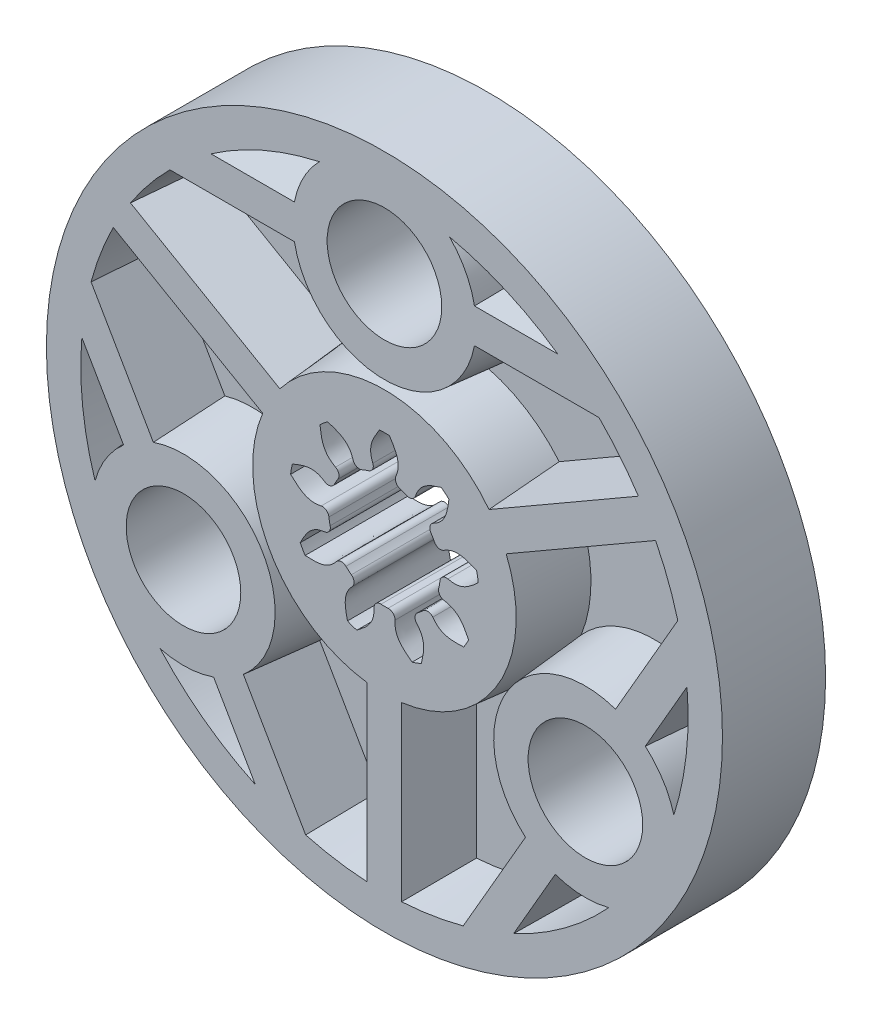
ISO-10303-21;
HEADER;
FILE_DESCRIPTION(('STEP AP214'),'2;1');
FILE_NAME('part.step','',(''),(''),'','','');
FILE_SCHEMA(('AUTOMOTIVE_DESIGN { 1 0 10303 214 1 1 1 1 }'));
ENDSEC;
DATA;
#1=APPLICATION_CONTEXT('core data for automotive mechanical design processes');
#2=APPLICATION_PROTOCOL_DEFINITION('international standard','automotive_design',2000,#1);
#3=PRODUCT_CONTEXT('',#1,'mechanical');
#4=PRODUCT('Part','Part','',(#3));
#5=PRODUCT_RELATED_PRODUCT_CATEGORY('part','',(#4));
#6=PRODUCT_DEFINITION_FORMATION('','',#4);
#7=PRODUCT_DEFINITION_CONTEXT('part definition',#1,'design');
#8=PRODUCT_DEFINITION('design','',#6,#7);
#9=PRODUCT_DEFINITION_SHAPE('','',#8);
#10=(LENGTH_UNIT() NAMED_UNIT(*) SI_UNIT(.MILLI.,.METRE.));
#11=(NAMED_UNIT(*) PLANE_ANGLE_UNIT() SI_UNIT($,.RADIAN.));
#12=(NAMED_UNIT(*) SI_UNIT($,.STERADIAN.) SOLID_ANGLE_UNIT());
#13=UNCERTAINTY_MEASURE_WITH_UNIT(LENGTH_MEASURE(1.E-05),#10,'distance_accuracy_value','');
#14=(GEOMETRIC_REPRESENTATION_CONTEXT(3) GLOBAL_UNCERTAINTY_ASSIGNED_CONTEXT((#13)) GLOBAL_UNIT_ASSIGNED_CONTEXT((#10,
#11,#12)) REPRESENTATION_CONTEXT('',''));
#15=CARTESIAN_POINT('',(0.,0.,0.));
#16=DIRECTION('',(0.,0.,1.));
#17=DIRECTION('',(1.,0.,0.));
#18=AXIS2_PLACEMENT_3D('',#15,#16,#17);
#19=CARTESIAN_POINT('',(0.,0.,-4.5));
#20=DIRECTION('',(0.,0.,1.));
#21=DIRECTION('',(1.,0.,0.));
#22=AXIS2_PLACEMENT_3D('',#19,#20,#21);
#23=CYLINDRICAL_SURFACE('',#22,4.875);
#24=CARTESIAN_POINT('',(0.,0.,4.5));
#25=DIRECTION('',(0.,0.,1.));
#26=DIRECTION('',(1.,0.,0.));
#27=AXIS2_PLACEMENT_3D('',#24,#25,#26);
#28=CIRCLE('',#27,4.875);
#29=CARTESIAN_POINT('',(4.36396197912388,2.17289227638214,4.5));
#30=VERTEX_POINT('',#29);
#31=CARTESIAN_POINT('',(4.05403332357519,2.70747831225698,4.5));
#32=VERTEX_POINT('',#31);
#33=EDGE_CURVE('E1793',#30,#32,#28,.T.);
#34=ORIENTED_EDGE('',*,*,#33,.T.);
#35=DIRECTION('',(0.,0.,1.));
#36=VECTOR('',#35,1.);
#37=CARTESIAN_POINT('',(4.05403332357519,2.70747831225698,-4.5));
#38=LINE('',#37,#36);
#39=CARTESIAN_POINT('',(4.05403332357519,2.70747831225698,-4.5));
#40=VERTEX_POINT('',#39);
#41=EDGE_CURVE('E45',#32,#40,#38,.F.);
#42=ORIENTED_EDGE('',*,*,#41,.T.);
#43=CARTESIAN_POINT('',(0.,0.,-4.5));
#44=DIRECTION('',(0.,0.,1.));
#45=DIRECTION('',(1.,0.,0.));
#46=AXIS2_PLACEMENT_3D('',#43,#44,#45);
#47=CIRCLE('',#46,4.875);
#48=CARTESIAN_POINT('',(4.36396197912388,2.17289227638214,-4.5));
#49=VERTEX_POINT('',#48);
#50=EDGE_CURVE('E1790',#49,#40,#47,.T.);
#51=ORIENTED_EDGE('',*,*,#50,.F.);
#52=DIRECTION('',(0.,0.,1.));
#53=VECTOR('',#52,1.);
#54=CARTESIAN_POINT('',(4.36396197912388,2.17289227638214,-4.5));
#55=LINE('',#54,#53);
#56=EDGE_CURVE('E1758',#49,#30,#55,.T.);
#57=ORIENTED_EDGE('',*,*,#56,.T.);
#58=EDGE_LOOP('',(#34,#42,#51,#57));
#59=FACE_BOUND('',#58,.T.);
#60=ADVANCED_FACE('F36',(#59),#23,.F.);
#61=CARTESIAN_POINT('',(4.73969705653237,-1.1405686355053,4.5));
#62=VERTEX_POINT('',#61);
#63=CARTESIAN_POINT('',(4.84590321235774,-0.531833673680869,4.5));
#64=VERTEX_POINT('',#63);
#65=EDGE_CURVE('E2024',#62,#64,#28,.T.);
#66=ORIENTED_EDGE('',*,*,#65,.T.);
#67=DIRECTION('',(0.,0.,1.));
#68=VECTOR('',#67,1.);
#69=CARTESIAN_POINT('',(4.84590321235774,-0.531833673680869,-4.5));
#70=LINE('',#69,#68);
#71=CARTESIAN_POINT('',(4.84590321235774,-0.531833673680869,-4.5));
#72=VERTEX_POINT('',#71);
#73=EDGE_CURVE('E1771',#64,#72,#70,.F.);
#74=ORIENTED_EDGE('',*,*,#73,.T.);
#75=CARTESIAN_POINT('',(4.73969705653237,-1.1405686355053,-4.5));
#76=VERTEX_POINT('',#75);
#77=EDGE_CURVE('E1798',#76,#72,#47,.T.);
#78=ORIENTED_EDGE('',*,*,#77,.F.);
#79=DIRECTION('',(0.,0.,1.));
#80=VECTOR('',#79,1.);
#81=CARTESIAN_POINT('',(4.73969705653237,-1.1405686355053,-4.5));
#82=LINE('',#81,#80);
#83=EDGE_CURVE('E1740',#76,#62,#82,.T.);
#84=ORIENTED_EDGE('',*,*,#83,.T.);
#85=EDGE_LOOP('',(#66,#74,#78,#84));
#86=FACE_BOUND('',#85,.T.);
#87=ADVANCED_FACE('F2104',(#86),#23,.F.);
#88=CARTESIAN_POINT('',(2.8976752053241,-3.9203448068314,4.5));
#89=VERTEX_POINT('',#88);
#90=CARTESIAN_POINT('',(3.37032113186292,-3.52229477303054,4.5));
#91=VERTEX_POINT('',#90);
#92=EDGE_CURVE('E1839',#89,#91,#28,.T.);
#93=ORIENTED_EDGE('',*,*,#92,.T.);
#94=DIRECTION('',(0.,0.,1.));
#95=VECTOR('',#94,1.);
#96=CARTESIAN_POINT('',(3.37032113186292,-3.52229477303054,-4.5));
#97=LINE('',#96,#95);
#98=CARTESIAN_POINT('',(3.37032113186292,-3.52229477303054,-4.5));
#99=VERTEX_POINT('',#98);
#100=EDGE_CURVE('E1753',#91,#99,#97,.F.);
#101=ORIENTED_EDGE('',*,*,#100,.T.);
#102=CARTESIAN_POINT('',(2.8976752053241,-3.9203448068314,-4.5));
#103=VERTEX_POINT('',#102);
#104=EDGE_CURVE('E1801',#103,#99,#47,.T.);
#105=ORIENTED_EDGE('',*,*,#104,.F.);
#106=DIRECTION('',(0.,0.,1.));
#107=VECTOR('',#106,1.);
#108=CARTESIAN_POINT('',(2.8976752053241,-3.9203448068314,-4.5));
#109=LINE('',#108,#107);
#110=EDGE_CURVE('E1722',#103,#89,#109,.T.);
#111=ORIENTED_EDGE('',*,*,#110,.T.);
#112=EDGE_LOOP('',(#93,#101,#105,#111));
#113=FACE_BOUND('',#112,.T.);
#114=ADVANCED_FACE('F1829',(#113),#23,.F.);
#115=CARTESIAN_POINT('',(-0.300201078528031,-4.86574807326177,4.5));
#116=VERTEX_POINT('',#115);
#117=CARTESIAN_POINT('',(0.317728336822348,-4.86463500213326,4.5));
#118=VERTEX_POINT('',#117);
#119=EDGE_CURVE('E2016',#116,#118,#28,.T.);
#120=ORIENTED_EDGE('',*,*,#119,.T.);
#121=DIRECTION('',(0.,0.,1.));
#122=VECTOR('',#121,1.);
#123=CARTESIAN_POINT('',(0.317728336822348,-4.86463500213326,-4.5));
#124=LINE('',#123,#122);
#125=CARTESIAN_POINT('',(0.317728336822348,-4.86463500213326,-4.5));
#126=VERTEX_POINT('',#125);
#127=EDGE_CURVE('E1735',#118,#126,#124,.F.);
#128=ORIENTED_EDGE('',*,*,#127,.T.);
#129=CARTESIAN_POINT('',(-0.300201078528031,-4.86574807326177,-4.5));
#130=VERTEX_POINT('',#129);
#131=EDGE_CURVE('E1818',#130,#126,#47,.T.);
#132=ORIENTED_EDGE('',*,*,#131,.F.);
#133=DIRECTION('',(0.,0.,1.));
#134=VECTOR('',#133,1.);
#135=CARTESIAN_POINT('',(-0.300201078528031,-4.86574807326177,-4.5));
#136=LINE('',#135,#134);
#137=EDGE_CURVE('E1704',#130,#116,#136,.T.);
#138=ORIENTED_EDGE('',*,*,#137,.T.);
#139=EDGE_LOOP('',(#120,#128,#132,#138));
#140=FACE_BOUND('',#139,.T.);
#141=ADVANCED_FACE('F2111',(#140),#23,.F.);
#142=CARTESIAN_POINT('',(-3.35760994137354,-3.53441373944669,4.5));
#143=VERTEX_POINT('',#142);
#144=CARTESIAN_POINT('',(-2.88353307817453,-3.93075844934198,4.5));
#145=VERTEX_POINT('',#144);
#146=EDGE_CURVE('E2011',#143,#145,#28,.T.);
#147=ORIENTED_EDGE('',*,*,#146,.T.);
#148=DIRECTION('',(0.,0.,1.));
#149=VECTOR('',#148,1.);
#150=CARTESIAN_POINT('',(-2.88353307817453,-3.93075844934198,-4.5));
#151=LINE('',#150,#149);
#152=CARTESIAN_POINT('',(-2.88353307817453,-3.93075844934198,-4.5));
#153=VERTEX_POINT('',#152);
#154=EDGE_CURVE('E1717',#145,#153,#151,.F.);
#155=ORIENTED_EDGE('',*,*,#154,.T.);
#156=CARTESIAN_POINT('',(-3.35760994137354,-3.53441373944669,-4.5));
#157=VERTEX_POINT('',#156);
#158=EDGE_CURVE('E1815',#157,#153,#47,.T.);
#159=ORIENTED_EDGE('',*,*,#158,.F.);
#160=DIRECTION('',(0.,0.,1.));
#161=VECTOR('',#160,1.);
#162=CARTESIAN_POINT('',(-3.35760994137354,-3.53441373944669,-4.5));
#163=LINE('',#162,#161);
#164=EDGE_CURVE('E1686',#157,#143,#163,.T.);
#165=ORIENTED_EDGE('',*,*,#164,.T.);
#166=EDGE_LOOP('',(#147,#155,#159,#165));
#167=FACE_BOUND('',#166,.T.);
#168=ADVANCED_FACE('F2115',(#167),#23,.F.);
#169=CARTESIAN_POINT('',(-4.84395579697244,-0.549287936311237,4.5));
#170=VERTEX_POINT('',#169);
#171=CARTESIAN_POINT('',(-4.73555731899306,-1.15763633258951,4.5));
#172=VERTEX_POINT('',#171);
#173=EDGE_CURVE('E2009',#170,#172,#28,.T.);
#174=ORIENTED_EDGE('',*,*,#173,.T.);
#175=DIRECTION('',(0.,0.,1.));
#176=VECTOR('',#175,1.);
#177=CARTESIAN_POINT('',(-4.73555731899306,-1.15763633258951,-4.5));
#178=LINE('',#177,#176);
#179=CARTESIAN_POINT('',(-4.73555731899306,-1.15763633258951,-4.5));
#180=VERTEX_POINT('',#179);
#181=EDGE_CURVE('E1699',#172,#180,#178,.F.);
#182=ORIENTED_EDGE('',*,*,#181,.T.);
#183=CARTESIAN_POINT('',(-4.84395579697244,-0.549287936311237,-4.5));
#184=VERTEX_POINT('',#183);
#185=EDGE_CURVE('E1812',#184,#180,#47,.T.);
#186=ORIENTED_EDGE('',*,*,#185,.F.);
#187=DIRECTION('',(0.,0.,1.));
#188=VECTOR('',#187,1.);
#189=CARTESIAN_POINT('',(-4.84395579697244,-0.549287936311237,-4.5));
#190=LINE('',#189,#188);
#191=EDGE_CURVE('E1668',#184,#170,#190,.T.);
#192=ORIENTED_EDGE('',*,*,#191,.T.);
#193=EDGE_LOOP('',(#174,#182,#186,#192));
#194=FACE_BOUND('',#193,.T.);
#195=ADVANCED_FACE('F2119',(#194),#23,.F.);
#196=CARTESIAN_POINT('',(-4.06376090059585,2.69285579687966,4.5));
#197=VERTEX_POINT('',#196);
#198=CARTESIAN_POINT('',(-4.37176166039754,2.15715668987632,4.5));
#199=VERTEX_POINT('',#198);
#200=EDGE_CURVE('E1806',#197,#199,#28,.T.);
#201=ORIENTED_EDGE('',*,*,#200,.T.);
#202=DIRECTION('',(0.,0.,1.));
#203=VECTOR('',#202,1.);
#204=CARTESIAN_POINT('',(-4.37176166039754,2.15715668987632,-4.5));
#205=LINE('',#204,#203);
#206=CARTESIAN_POINT('',(-4.37176166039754,2.15715668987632,-4.5));
#207=VERTEX_POINT('',#206);
#208=EDGE_CURVE('E1681',#199,#207,#205,.F.);
#209=ORIENTED_EDGE('',*,*,#208,.T.);
#210=CARTESIAN_POINT('',(-4.06376090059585,2.69285579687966,-4.5));
#211=VERTEX_POINT('',#210);
#212=EDGE_CURVE('E1809',#211,#207,#47,.T.);
#213=ORIENTED_EDGE('',*,*,#212,.F.);
#214=DIRECTION('',(0.,0.,1.));
#215=VECTOR('',#214,1.);
#216=CARTESIAN_POINT('',(-4.06376090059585,2.69285579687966,-4.5));
#217=LINE('',#216,#215);
#218=EDGE_CURVE('E1650',#211,#197,#217,.T.);
#219=ORIENTED_EDGE('',*,*,#218,.T.);
#220=EDGE_LOOP('',(#201,#209,#213,#219));
#221=FACE_BOUND('',#220,.T.);
#222=ADVANCED_FACE('F2004',(#221),#23,.F.);
#223=CARTESIAN_POINT('',(-1.3820871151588,4.67498237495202,4.5));
#224=VERTEX_POINT('',#223);
#225=CARTESIAN_POINT('',(-1.9623701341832,4.46259212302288,4.5));
#226=VERTEX_POINT('',#225);
#227=EDGE_CURVE('E1802',#224,#226,#28,.T.);
#228=ORIENTED_EDGE('',*,*,#227,.T.);
#229=DIRECTION('',(0.,0.,1.));
#230=VECTOR('',#229,1.);
#231=CARTESIAN_POINT('',(-1.9623701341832,4.46259212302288,-4.5));
#232=LINE('',#231,#230);
#233=CARTESIAN_POINT('',(-1.9623701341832,4.46259212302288,-4.5));
#234=VERTEX_POINT('',#233);
#235=EDGE_CURVE('E1663',#226,#234,#232,.F.);
#236=ORIENTED_EDGE('',*,*,#235,.T.);
#237=CARTESIAN_POINT('',(-1.3820871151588,4.67498237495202,-4.5));
#238=VERTEX_POINT('',#237);
#239=EDGE_CURVE('E970',#238,#234,#47,.T.);
#240=ORIENTED_EDGE('',*,*,#239,.F.);
#241=DIRECTION('',(0.,0.,1.));
#242=VECTOR('',#241,1.);
#243=CARTESIAN_POINT('',(-1.3820871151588,4.67498237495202,-4.5));
#244=LINE('',#243,#242);
#245=EDGE_CURVE('E1634',#238,#224,#244,.T.);
#246=ORIENTED_EDGE('',*,*,#245,.T.);
#247=EDGE_LOOP('',(#228,#236,#240,#246));
#248=FACE_BOUND('',#247,.T.);
#249=ADVANCED_FACE('F949',(#248),#23,.F.);
#250=CARTESIAN_POINT('',(0.,0.,-1.5));
#251=DIRECTION('',(0.,0.,1.));
#252=DIRECTION('',(1.,0.,0.));
#253=AXIS2_PLACEMENT_3D('',#250,#251,#252);
#254=PLANE('',#253);
#255=DIRECTION('',(0.,1.,0.));
#256=VECTOR('',#255,1.);
#257=CARTESIAN_POINT('',(-2.02493198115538,-11.4017542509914,-1.5));
#258=LINE('',#257,#256);
#259=CARTESIAN_POINT('',(-2.02493198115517,-25.8960191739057,-1.5));
#260=VERTEX_POINT('',#259);
#261=CARTESIAN_POINT('',(-2.02493198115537,-11.8532122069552,-1.5));
#262=VERTEX_POINT('',#261);
#263=EDGE_CURVE('E1002',#260,#262,#258,.T.);
#264=ORIENTED_EDGE('',*,*,#263,.T.);
#265=CARTESIAN_POINT('',(0.,0.,-1.5));
#266=DIRECTION('',(0.,0.,1.));
#267=DIRECTION('',(1.,0.,0.));
#268=AXIS2_PLACEMENT_3D('',#265,#266,#267);
#269=CIRCLE('',#268,12.0249319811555);
#270=CARTESIAN_POINT('',(-9.4452113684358,-7.44224236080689,-1.5));
#271=VERTEX_POINT('',#270);
#272=EDGE_CURVE('E1181',#262,#271,#269,.F.);
#273=ORIENTED_EDGE('',*,*,#272,.T.);
#274=CARTESIAN_POINT('',(-17.5370144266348,-10.1250000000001,-1.5));
#275=DIRECTION('',(0.,0.,1.));
#276=DIRECTION('',(1.,0.,0.));
#277=AXIS2_PLACEMENT_3D('',#274,#275,#276);
#278=CIRCLE('',#277,8.52493198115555);
#279=CARTESIAN_POINT('',(-11.6428974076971,-16.2840461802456,-1.5));
#280=VERTEX_POINT('',#279);
#281=EDGE_CURVE('E1613',#280,#271,#278,.T.);
#282=ORIENTED_EDGE('',*,*,#281,.F.);
#283=DIRECTION('',(0.500000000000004,-0.866025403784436,0.));
#284=VECTOR('',#283,1.);
#285=CARTESIAN_POINT('',(-6.42004582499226,-25.3302904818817,-1.5));
#286=LINE('',#285,#284);
#287=CARTESIAN_POINT('',(-6.5293044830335,-25.1410489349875,-1.5));
#288=VERTEX_POINT('',#287);
#289=EDGE_CURVE('E1326',#280,#288,#286,.T.);
#290=ORIENTED_EDGE('',*,*,#289,.T.);
#291=CARTESIAN_POINT('',(0.,0.,-1.5));
#292=DIRECTION('',(0.,0.,1.));
#293=DIRECTION('',(1.,0.,0.));
#294=AXIS2_PLACEMENT_3D('',#291,#292,#293);
#295=CIRCLE('',#294,25.9750680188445);
#296=EDGE_CURVE('E1618',#288,#260,#295,.T.);
#297=ORIENTED_EDGE('',*,*,#296,.T.);
#298=EDGE_LOOP('',(#264,#273,#282,#290,#297));
#299=FACE_BOUND('',#298,.T.);
#300=ADVANCED_FACE('F2129',(#299),#254,.T.);
#301=CARTESIAN_POINT('',(0.,0.,4.5));
#302=DIRECTION('',(0.,0.,1.));
#303=DIRECTION('',(1.,0.,0.));
#304=AXIS2_PLACEMENT_3D('',#301,#302,#303);
#305=CONICAL_SURFACE('',#304,26.5,0.0872664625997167);
#306=CARTESIAN_POINT('',(-1.49998250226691,-26.4575316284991,4.5002));
#307=CARTESIAN_POINT('',(-1.5874850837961,-26.3649381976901,3.50004091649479));
#308=CARTESIAN_POINT('',(-1.67498362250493,-26.2718472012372,2.49992804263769));
#309=CARTESIAN_POINT('',(-1.84997261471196,-26.0846700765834,0.499794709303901));
#310=CARTESIAN_POINT('',(-1.93746306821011,-25.9905839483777,-0.50022575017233));
#311=CARTESIAN_POINT('',(-2.02494947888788,-25.8960002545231,-1.5002));
#312=B_SPLINE_CURVE_WITH_KNOTS('',3,(#306,#307,#308,#309,#310,#311),.UNSPECIFIED.,.F.,.F.,(4,2,
4),(0.,3.0247196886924,6.04943939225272),.UNSPECIFIED.);
#313=CARTESIAN_POINT('',(-1.49999999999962,-26.4575131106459,4.5));
#314=VERTEX_POINT('',#313);
#315=EDGE_CURVE('E982',#314,#260,#312,.T.);
#316=ORIENTED_EDGE('',*,*,#315,.T.);
#317=ORIENTED_EDGE('',*,*,#296,.F.);
#318=CARTESIAN_POINT('',(-6.52929299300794,-25.1410338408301,-1.5002));
#319=CARTESIAN_POINT('',(-6.58674713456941,-25.216507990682,-0.500141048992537));
#320=CARTESIAN_POINT('',(-6.64425493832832,-25.291889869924,0.499921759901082));
#321=CARTESIAN_POINT('',(-6.75937787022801,-25.4424690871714,2.50005509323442));
#322=CARTESIAN_POINT('',(-6.81699299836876,-25.5176664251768,3.50012561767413));
#323=CARTESIAN_POINT('',(-6.87466178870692,-25.5927714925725,4.5002));
#324=B_SPLINE_CURVE_WITH_KNOTS('',3,(#318,#319,#320,#321,#322,#323),.UNSPECIFIED.,.F.,.F.,(4,2,
4),(0.,3.01364177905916,6.02728355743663),.UNSPECIFIED.);
#325=CARTESIAN_POINT('',(-6.87465025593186,-25.5927564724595,4.5));
#326=VERTEX_POINT('',#325);
#327=EDGE_CURVE('E1298',#288,#326,#324,.T.);
#328=ORIENTED_EDGE('',*,*,#327,.T.);
#329=CARTESIAN_POINT('',(0.,0.,4.5));
#330=DIRECTION('',(0.,0.,1.));
#331=DIRECTION('',(1.,0.,0.));
#332=AXIS2_PLACEMENT_3D('',#329,#330,#331);
#333=CIRCLE('',#332,26.5);
#334=EDGE_CURVE('E2237',#326,#314,#333,.T.);
#335=ORIENTED_EDGE('',*,*,#334,.T.);
#336=EDGE_LOOP('',(#316,#317,#328,#335));
#337=FACE_BOUND('',#336,.T.);
#338=ADVANCED_FACE('F2133',(#337),#305,.F.);
#339=CARTESIAN_POINT('',(0.,0.,4.5));
#340=DIRECTION('',(0.,0.,-1.));
#341=DIRECTION('',(1.,0.,0.));
#342=AXIS2_PLACEMENT_3D('',#339,#340,#341);
#343=CONICAL_SURFACE('',#342,11.5,0.0872664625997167);
#344=CARTESIAN_POINT('',(-2.05793230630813,-11.8810204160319,-1.8771954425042));
#345=CARTESIAN_POINT('',(-1.96493000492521,-11.802775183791,-0.814174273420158));
#346=CARTESIAN_POINT('',(-1.87193303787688,-11.7237124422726,0.248785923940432));
#347=CARTESIAN_POINT('',(-1.68594976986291,-11.5639519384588,2.37458440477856));
#348=CARTESIAN_POINT('',(-1.59296346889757,-11.4832541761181,3.4374226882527));
#349=CARTESIAN_POINT('',(-1.49998250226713,-11.4017389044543,4.5002));
#350=B_SPLINE_CURVE_WITH_KNOTS('',3,(#344,#345,#346,#347,#348,#349),.UNSPECIFIED.,.F.,.F.,(4,2,
4),(0.,3.20983700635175,6.41967410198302),.UNSPECIFIED.);
#351=CARTESIAN_POINT('',(-1.49999999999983,-11.4017542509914,4.5));
#352=VERTEX_POINT('',#351);
#353=EDGE_CURVE('E963',#262,#352,#350,.T.);
#354=ORIENTED_EDGE('',*,*,#353,.T.);
#355=CARTESIAN_POINT('',(0.,0.,4.5));
#356=DIRECTION('',(0.,0.,1.));
#357=DIRECTION('',(1.,0.,0.));
#358=AXIS2_PLACEMENT_3D('',#355,#356,#357);
#359=CIRCLE('',#358,11.5);
#360=CARTESIAN_POINT('',(-10.6242088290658,4.40183901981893,4.5));
#361=VERTEX_POINT('',#360);
#362=EDGE_CURVE('E1170',#361,#352,#359,.T.);
#363=ORIENTED_EDGE('',*,*,#362,.F.);
#364=CARTESIAN_POINT('',(-10.6241867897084,4.4018465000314,4.5002));
#365=CARTESIAN_POINT('',(-10.7412715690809,4.36208025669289,3.4374226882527));
#366=CARTESIAN_POINT('',(-10.8576510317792,4.32190063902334,2.37458440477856));
#367=CARTESIAN_POINT('',(-11.0889993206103,4.24071465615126,0.248785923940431));
#368=CARTESIAN_POINT('',(-11.2039681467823,4.19970829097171,-0.814174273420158));
#369=CARTESIAN_POINT('',(-11.3182316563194,4.15828855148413,-1.8771954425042));
#370=B_SPLINE_CURVE_WITH_KNOTS('',3,(#364,#365,#366,#367,#368,#369),.UNSPECIFIED.,.F.,.F.,(4,2,
4),(0.,3.20983709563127,6.41967410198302),.UNSPECIFIED.);
#371=CARTESIAN_POINT('',(-11.2776488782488,4.17296356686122,-1.5));
#372=VERTEX_POINT('',#371);
#373=EDGE_CURVE('E1128',#361,#372,#370,.T.);
#374=ORIENTED_EDGE('',*,*,#373,.T.);
#375=CARTESIAN_POINT('',(-11.1677766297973,-4.45867180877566,-1.5));
#376=VERTEX_POINT('',#375);
#377=EDGE_CURVE('E1168',#376,#372,#269,.F.);
#378=ORIENTED_EDGE('',*,*,#377,.F.);
#379=CARTESIAN_POINT('',(-9.37614744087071,-7.57094353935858,-1.8002));
#380=CARTESIAN_POINT('',(-9.39204415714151,-7.54123340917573,-1.72824251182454));
#381=CARTESIAN_POINT('',(-9.40829962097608,-7.5109117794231,-1.656611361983));
#382=CARTESIAN_POINT('',(-9.44165208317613,-7.44883455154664,-1.5141298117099));
#383=CARTESIAN_POINT('',(-9.45874947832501,-7.4170782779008,-1.44327979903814));
#384=CARTESIAN_POINT('',(-9.51211243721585,-7.31818904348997,-1.2296145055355));
#385=CARTESIAN_POINT('',(-9.54987440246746,-7.24851077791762,-1.08833804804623));
#386=CARTESIAN_POINT('',(-9.63363947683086,-7.09477489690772,-0.80230432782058));
#387=CARTESIAN_POINT('',(-9.68003513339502,-7.01005105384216,-0.657999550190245));
#388=CARTESIAN_POINT('',(-9.75637555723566,-6.87160851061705,-0.452429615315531));
#389=CARTESIAN_POINT('',(-9.78283572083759,-6.82376758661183,-0.38594888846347));
#390=CARTESIAN_POINT('',(-9.83861759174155,-6.72328279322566,-0.258059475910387));
#391=CARTESIAN_POINT('',(-9.86793501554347,-6.67064612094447,-0.196643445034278));
#392=CARTESIAN_POINT('',(-9.9221356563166,-6.57373263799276,-0.0962823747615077));
#393=CARTESIAN_POINT('',(-9.94621412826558,-6.53079791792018,-0.0556255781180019));
#394=CARTESIAN_POINT('',(-9.99657188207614,-6.44129885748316,0.019660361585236));
#395=CARTESIAN_POINT('',(-10.0228433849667,-6.39474738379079,0.054309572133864));
#396=CARTESIAN_POINT('',(-10.0782652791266,-6.29689285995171,0.115844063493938));
#397=CARTESIAN_POINT('',(-10.1074551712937,-6.24552543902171,0.14259553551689));
#398=CARTESIAN_POINT('',(-10.1679968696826,-6.13940204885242,0.184327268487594));
#399=CARTESIAN_POINT('',(-10.1993424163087,-6.08465593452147,0.199340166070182));
#400=CARTESIAN_POINT('',(-10.2599800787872,-5.97917547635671,0.214317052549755));
#401=CARTESIAN_POINT('',(-10.2891701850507,-5.92857738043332,0.215618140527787));
#402=CARTESIAN_POINT('',(-10.347245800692,-5.82826553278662,0.206423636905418));
#403=CARTESIAN_POINT('',(-10.376130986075,-5.77855268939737,0.195916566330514));
#404=CARTESIAN_POINT('',(-10.4349807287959,-5.67760690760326,0.163348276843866));
#405=CARTESIAN_POINT('',(-10.4648258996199,-5.626608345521,0.140374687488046));
#406=CARTESIAN_POINT('',(-10.5224049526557,-5.52854333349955,0.0853261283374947));
#407=CARTESIAN_POINT('',(-10.5501354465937,-5.48148318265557,0.0532369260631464));
#408=CARTESIAN_POINT('',(-10.6226323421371,-5.35881881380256,-0.0427832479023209));
#409=CARTESIAN_POINT('',(-10.6653194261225,-5.28700691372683,-0.113024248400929));
#410=CARTESIAN_POINT('',(-10.7458298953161,-5.1521427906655,-0.264599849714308));
#411=CARTESIAN_POINT('',(-10.7836089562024,-5.08917003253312,-0.346023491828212));
#412=CARTESIAN_POINT('',(-10.8639718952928,-4.95572178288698,-0.535966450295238));
#413=CARTESIAN_POINT('',(-10.9054851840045,-4.88715412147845,-0.64625525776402));
#414=CARTESIAN_POINT('',(-10.9842117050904,-4.7576502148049,-0.872900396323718));
#415=CARTESIAN_POINT('',(-11.0214146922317,-4.69673212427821,-0.989270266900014));
#416=CARTESIAN_POINT('',(-11.090929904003,-4.58332016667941,-1.22046169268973));
#417=CARTESIAN_POINT('',(-11.123387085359,-4.53057017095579,-1.33511606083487));
#418=CARTESIAN_POINT('',(-11.1857510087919,-4.42954539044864,-1.56633335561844));
#419=CARTESIAN_POINT('',(-11.2156699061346,-4.38124916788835,-1.68288357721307));
#420=CARTESIAN_POINT('',(-11.2447031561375,-4.3345101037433,-1.8002));
#421=B_SPLINE_CURVE_WITH_KNOTS('',3,(#379,#380,#381,#382,#383,#384,#385,#386,#387,#388,#389,
#390,#391,#392,#393,#394,#395,#396,#397,#398,#399,#400,#401,#402,#403,#404,#405,#406,#407,#408,
#409,#410,#411,#412,#413,#414,#415,#416,#417,#418,#419,#420),.UNSPECIFIED.,.F.,.F.,(4,2,2,2,2,2,
2,2,2,2,2,2,2,2,2,2,2,2,2,2,4),(0.,0.238370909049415,0.476855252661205,0.962574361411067,
1.48240940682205,1.74040863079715,1.9980268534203,2.18924501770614,2.37981159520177,
2.57344260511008,2.76653333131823,2.94059758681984,3.11483120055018,3.30398500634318,
3.49343578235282,3.81903985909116,4.14740567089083,4.55574201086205,4.96502984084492,
5.35584422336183,5.74466681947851),.UNSPECIFIED.);
#422=EDGE_CURVE('E1388',#271,#376,#421,.T.);
#423=ORIENTED_EDGE('',*,*,#422,.F.);
#424=ORIENTED_EDGE('',*,*,#272,.F.);
#425=EDGE_LOOP('',(#354,#363,#374,#378,#423,#424));
#426=FACE_BOUND('',#425,.T.);
#427=ADVANCED_FACE('F1166',(#426),#343,.T.);
#428=CARTESIAN_POINT('',(17.537014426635,-10.1249999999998,4.5));
#429=DIRECTION('',(0.,0.,-1.));
#430=DIRECTION('',(1.,0.,0.));
#431=AXIS2_PLACEMENT_3D('',#428,#429,#430);
#432=CONICAL_SURFACE('',#431,8.,0.0872664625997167);
#433=CARTESIAN_POINT('',(14.9069862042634,-17.6803075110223,4.5002));
#434=CARTESIAN_POINT('',(14.9267766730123,-17.7335123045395,4.00023299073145));
#435=CARTESIAN_POINT('',(14.9466925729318,-17.7865029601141,3.50024817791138));
#436=CARTESIAN_POINT('',(14.9867656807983,-17.8920721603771,2.50024513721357));
#437=CARTESIAN_POINT('',(15.0069228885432,-17.9446507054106,2.00022690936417));
#438=CARTESIAN_POINT('',(15.0474690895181,-18.0494119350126,1.00015842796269));
#439=CARTESIAN_POINT('',(15.0678580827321,-18.1015946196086,0.500108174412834));
#440=CARTESIAN_POINT('',(15.1088592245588,-18.2055788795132,-0.500023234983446));
#441=CARTESIAN_POINT('',(15.1294713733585,-18.2573804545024,-1.0001043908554));
#442=CARTESIAN_POINT('',(15.1501907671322,-18.3089988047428,-1.5002));
#443=B_SPLINE_CURVE_WITH_KNOTS('',3,(#433,#434,#435,#436,#437,#438,#439,#440,#441,#442),
.UNSPECIFIED.,.F.,.F.,(4,2,2,2,4),(0.,1.50953785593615,3.01907444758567,4.5286109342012,
6.03814868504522),.UNSPECIFIED.);
#444=CARTESIAN_POINT('',(14.9069941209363,-17.680328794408,4.5));
#445=VERTEX_POINT('',#444);
#446=CARTESIAN_POINT('',(15.1501824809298,-18.3089781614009,-1.5));
#447=VERTEX_POINT('',#446);
#448=EDGE_CURVE('E1004',#445,#447,#443,.T.);
#449=ORIENTED_EDGE('',*,*,#448,.T.);
#450=CARTESIAN_POINT('',(17.537014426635,-10.1249999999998,-1.5));
#451=DIRECTION('',(0.,0.,1.));
#452=DIRECTION('',(1.,0.,0.));
#453=AXIS2_PLACEMENT_3D('',#450,#451,#452);
#454=CIRCLE('',#453,8.52493198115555);
#455=CARTESIAN_POINT('',(18.0990514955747,-18.6313846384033,-1.5));
#456=VERTEX_POINT('',#455);
#457=EDGE_CURVE('E1109',#447,#456,#454,.T.);
#458=ORIENTED_EDGE('',*,*,#457,.T.);
#459=CARTESIAN_POINT('',(19.5767464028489,-17.860599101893,4.5));
#460=CARTESIAN_POINT('',(19.5111310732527,-17.900330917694,4.25204660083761));
#461=CARTESIAN_POINT('',(19.446132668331,-17.9388906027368,4.00374572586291));
#462=CARTESIAN_POINT('',(19.3172750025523,-18.0138532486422,3.5065278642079));
#463=CARTESIAN_POINT('',(19.2534157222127,-18.0502562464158,3.25761088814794));
#464=CARTESIAN_POINT('',(19.0634312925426,-18.1564966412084,2.51015978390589));
#465=CARTESIAN_POINT('',(18.938868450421,-18.2233841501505,2.01080752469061));
#466=CARTESIAN_POINT('',(18.6933187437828,-18.350459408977,1.01040569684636));
#467=CARTESIAN_POINT('',(18.5723317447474,-18.4106474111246,0.509356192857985));
#468=CARTESIAN_POINT('',(18.33346356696,-18.5251869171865,-0.494276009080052));
#469=CARTESIAN_POINT('',(18.2155831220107,-18.5795370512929,-0.996859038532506));
#470=CARTESIAN_POINT('',(18.0990514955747,-18.6313846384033,-1.5));
#471=B_SPLINE_CURVE_WITH_KNOTS('',3,(#459,#460,#461,#462,#463,#464,#465,#466,#467,#468,#469,
#470),.UNSPECIFIED.,.F.,.F.,(4,2,2,2,2,4),(0.,0.778633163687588,1.5572529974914,
3.11412248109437,4.6709333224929,6.22810866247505),.UNSPECIFIED.);
#472=CARTESIAN_POINT('',(19.5767464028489,-17.860599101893,4.5));
#473=VERTEX_POINT('',#472);
#474=EDGE_CURVE('E1523',#473,#456,#471,.T.);
#475=ORIENTED_EDGE('',*,*,#474,.F.);
#476=CARTESIAN_POINT('',(17.537014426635,-10.1249999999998,4.5));
#477=DIRECTION('',(0.,0.,1.));
#478=DIRECTION('',(1.,0.,0.));
#479=AXIS2_PLACEMENT_3D('',#476,#477,#478);
#480=CIRCLE('',#479,8.);
#481=EDGE_CURVE('E1112',#445,#473,#480,.T.);
#482=ORIENTED_EDGE('',*,*,#481,.F.);
#483=EDGE_LOOP('',(#449,#458,#475,#482));
#484=FACE_BOUND('',#483,.T.);
#485=ADVANCED_FACE('F2142',(#484),#432,.T.);
#486=DIRECTION('',(-0.499999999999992,-0.866025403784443,0.));
#487=VECTOR('',#486,1.);
#488=CARTESIAN_POINT('',(15.3615985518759,-17.9427947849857,-1.5));
#489=LINE('',#488,#487);
#490=CARTESIAN_POINT('',(12.6098717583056,-22.7089253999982,-1.5));
#491=VERTEX_POINT('',#490);
#492=EDGE_CURVE('E1048',#447,#491,#489,.T.);
#493=ORIENTED_EDGE('',*,*,#492,.T.);
#494=EDGE_CURVE('E1609',#491,#456,#295,.T.);
#495=ORIENTED_EDGE('',*,*,#494,.T.);
#496=ORIENTED_EDGE('',*,*,#457,.F.);
#497=EDGE_LOOP('',(#493,#495,#496));
#498=FACE_BOUND('',#497,.T.);
#499=ADVANCED_FACE('F2135',(#498),#254,.T.);
#500=CARTESIAN_POINT('',(12.6099185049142,-22.7088794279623,-1.50019999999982));
#501=CARTESIAN_POINT('',(12.4936766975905,-22.8231909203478,-1.00284856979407));
#502=CARTESIAN_POINT('',(12.3786266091,-22.9353018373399,-0.504717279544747));
#503=CARTESIAN_POINT('',(12.150734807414,-23.155460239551,0.492907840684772));
#504=CARTESIAN_POINT('',(12.0378929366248,-23.2635080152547,0.992401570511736));
#505=CARTESIAN_POINT('',(11.8142264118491,-23.4758936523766,1.99262343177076));
#506=CARTESIAN_POINT('',(11.7034017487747,-23.5802315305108,2.49335155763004));
#507=CARTESIAN_POINT('',(11.4836115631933,-23.7854863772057,3.49595529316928));
#508=CARTESIAN_POINT('',(11.3746461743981,-23.8864031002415,3.99783098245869));
#509=CARTESIAN_POINT('',(11.266539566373,-23.9857460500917,4.5002));
#510=B_SPLINE_CURVE_WITH_KNOTS('',3,(#500,#501,#502,#503,#504,#505,#506,#507,#508,#509),
.UNSPECIFIED.,.F.,.F.,(4,2,2,2,4),(0.,1.57015913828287,3.14020580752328,4.7102454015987,
6.28039743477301),.UNSPECIFIED.);
#511=CARTESIAN_POINT('',(11.2665826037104,-23.9857065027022,4.5));
#512=VERTEX_POINT('',#511);
#513=EDGE_CURVE('E1036',#491,#512,#510,.T.);
#514=ORIENTED_EDGE('',*,*,#513,.T.);
#515=EDGE_CURVE('E2238',#512,#473,#333,.T.);
#516=ORIENTED_EDGE('',*,*,#515,.T.);
#517=ORIENTED_EDGE('',*,*,#474,.T.);
#518=ORIENTED_EDGE('',*,*,#494,.F.);
#519=EDGE_LOOP('',(#514,#516,#517,#518));
#520=FACE_BOUND('',#519,.T.);
#521=ADVANCED_FACE('F2139',(#520),#305,.F.);
#522=CARTESIAN_POINT('',(0.,0.,4.5));
#523=DIRECTION('',(0.,0.,1.));
#524=DIRECTION('',(1.,0.,0.));
#525=AXIS2_PLACEMENT_3D('',#522,#523,#524);
#526=CONICAL_SURFACE('',#525,26.5,0.0872664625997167);
#527=CARTESIAN_POINT('',(25.0374204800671,6.91598331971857,-1.5002));
#528=CARTESIAN_POINT('',(25.1315100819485,6.90396364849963,-0.500141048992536));
#529=CARTESIAN_POINT('',(25.2255466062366,6.89185136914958,0.499921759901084));
#530=CARTESIAN_POINT('',(25.4135134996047,6.86744159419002,2.50005509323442));
#531=CARTESIAN_POINT('',(25.5074438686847,6.85514409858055,3.50012561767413));
#532=CARTESIAN_POINT('',(25.6013211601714,6.84275399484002,4.5002));
#533=B_SPLINE_CURVE_WITH_KNOTS('',3,(#527,#528,#529,#530,#531,#532),.UNSPECIFIED.,.F.,.F.,(4,2,
4),(0.,3.01364177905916,6.02728355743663),.UNSPECIFIED.);
#534=CARTESIAN_POINT('',(25.0374392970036,6.91598091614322,-1.5));
#535=VERTEX_POINT('',#534);
#536=CARTESIAN_POINT('',(25.6013023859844,6.84275647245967,4.5));
#537=VERTEX_POINT('',#536);
#538=EDGE_CURVE('E1081',#535,#537,#533,.T.);
#539=ORIENTED_EDGE('',*,*,#538,.T.);
#540=CARTESIAN_POINT('',(23.6628784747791,11.9297184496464,4.5));
#541=VERTEX_POINT('',#540);
#542=EDGE_CURVE('E2241',#537,#541,#333,.T.);
#543=ORIENTED_EDGE('',*,*,#542,.T.);
#544=CARTESIAN_POINT('',(23.6628857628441,11.9297428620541,4.5002));
#545=CARTESIAN_POINT('',(23.6264487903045,11.8076666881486,3.50004091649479));
#546=CARTESIAN_POINT('',(23.5895788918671,11.6853452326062,2.49992804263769));
#547=CARTESIAN_POINT('',(23.5149732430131,11.4402117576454,0.499794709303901));
#548=CARTESIAN_POINT('',(23.4772374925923,11.3173997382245,-0.50022575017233));
#549=CARTESIAN_POINT('',(23.4390688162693,11.1943424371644,-1.5002));
#550=B_SPLINE_CURVE_WITH_KNOTS('',3,(#544,#545,#546,#547,#548,#549),.UNSPECIFIED.,.F.,.F.,(4,2,
4),(0.,3.0247196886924,6.04943939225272),.UNSPECIFIED.);
#551=CARTESIAN_POINT('',(23.4390764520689,11.1943670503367,-1.5));
#552=VERTEX_POINT('',#551);
#553=EDGE_CURVE('E1328',#541,#552,#550,.T.);
#554=ORIENTED_EDGE('',*,*,#553,.T.);
#555=CARTESIAN_POINT('',(0.,0.,-1.5));
#556=DIRECTION('',(0.,0.,1.));
#557=DIRECTION('',(1.,0.,0.));
#558=AXIS2_PLACEMENT_3D('',#555,#556,#557);
#559=CIRCLE('',#558,25.9750680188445);
#560=EDGE_CURVE('E1627',#535,#552,#559,.T.);
#561=ORIENTED_EDGE('',*,*,#560,.F.);
#562=EDGE_LOOP('',(#539,#543,#554,#561));
#563=FACE_BOUND('',#562,.T.);
#564=ADVANCED_FACE('F2152',(#563),#526,.F.);
#565=DIRECTION('',(0.499999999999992,0.866025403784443,0.));
#566=VECTOR('',#565,1.);
#567=CARTESIAN_POINT('',(25.1466979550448,7.10522246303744,-1.5));
#568=LINE('',#567,#566);
#569=CARTESIAN_POINT('',(19.9238463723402,-1.94102183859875,-1.5));
#570=VERTEX_POINT('',#569);
#571=EDGE_CURVE('E1114',#570,#535,#568,.T.);
#572=ORIENTED_EDGE('',*,*,#571,.T.);
#573=ORIENTED_EDGE('',*,*,#560,.T.);
#574=DIRECTION('',(-0.866025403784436,-0.500000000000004,0.));
#575=VECTOR('',#574,1.);
#576=CARTESIAN_POINT('',(10.8866748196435,3.94723458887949,-1.5));
#577=LINE('',#576,#575);
#578=CARTESIAN_POINT('',(11.2776488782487,4.17296356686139,-1.5));
#579=VERTEX_POINT('',#578);
#580=EDGE_CURVE('E2220',#552,#579,#577,.T.);
#581=ORIENTED_EDGE('',*,*,#580,.T.);
#582=CARTESIAN_POINT('',(11.1677766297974,-4.45867180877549,-1.5));
#583=VERTEX_POINT('',#582);
#584=EDGE_CURVE('E2189',#579,#583,#269,.F.);
#585=ORIENTED_EDGE('',*,*,#584,.T.);
#586=EDGE_CURVE('E1621',#570,#583,#454,.T.);
#587=ORIENTED_EDGE('',*,*,#586,.F.);
#588=EDGE_LOOP('',(#572,#573,#581,#585,#587));
#589=FACE_BOUND('',#588,.T.);
#590=ADVANCED_FACE('F2144',(#589),#254,.T.);
#591=CARTESIAN_POINT('',(11.6428753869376,-16.2840493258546,-1.5002));
#592=CARTESIAN_POINT('',(11.6979378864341,-16.2761836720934,-1.00010439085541));
#593=CARTESIAN_POINT('',(11.7531054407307,-16.2681335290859,-0.50002323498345));
#594=CARTESIAN_POINT('',(11.8636590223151,-16.2516494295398,0.500108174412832));
#595=CARTESIAN_POINT('',(11.9190450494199,-16.2432154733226,1.00015842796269));
#596=CARTESIAN_POINT('',(12.0300440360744,-16.2259488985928,2.00022690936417));
#597=CARTESIAN_POINT('',(12.0856569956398,-16.2171162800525,2.50024513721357));
#598=CARTESIAN_POINT('',(12.197119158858,-16.199036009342,3.50024817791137));
#599=CARTESIAN_POINT('',(12.2529683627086,-16.1897883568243,4.00023299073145));
#600=CARTESIAN_POINT('',(12.3089402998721,-16.180325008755,4.5002));
#601=B_SPLINE_CURVE_WITH_KNOTS('',3,(#591,#592,#593,#594,#595,#596,#597,#598,#599,#600),
.UNSPECIFIED.,.F.,.F.,(4,2,2,2,4),(0.,1.50953775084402,3.01907423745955,4.52861082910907,
6.03814868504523),.UNSPECIFIED.);
#602=CARTESIAN_POINT('',(11.6428974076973,-16.2840461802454,-1.5));
#603=VERTEX_POINT('',#602);
#604=CARTESIAN_POINT('',(12.308917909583,-16.180328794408,4.5));
#605=VERTEX_POINT('',#604);
#606=EDGE_CURVE('E1011',#603,#605,#601,.T.);
#607=ORIENTED_EDGE('',*,*,#606,.T.);
#608=CARTESIAN_POINT('',(20.1670347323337,-2.56967120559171,4.5));
#609=VERTEX_POINT('',#608);
#610=EDGE_CURVE('E1110',#609,#605,#480,.T.);
#611=ORIENTED_EDGE('',*,*,#610,.F.);
#612=CARTESIAN_POINT('',(20.1670426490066,-2.56969248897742,4.5002));
#613=CARTESIAN_POINT('',(20.1472521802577,-2.51648769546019,4.00023299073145));
#614=CARTESIAN_POINT('',(20.1273362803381,-2.46349703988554,3.50024817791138));
#615=CARTESIAN_POINT('',(20.0872631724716,-2.35792783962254,2.50024513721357));
#616=CARTESIAN_POINT('',(20.0671059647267,-2.30534929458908,2.00022690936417));
#617=CARTESIAN_POINT('',(20.0265597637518,-2.2005880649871,1.00015842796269));
#618=CARTESIAN_POINT('',(20.0061707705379,-2.14840538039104,0.500108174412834));
#619=CARTESIAN_POINT('',(19.9651696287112,-2.04442112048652,-0.500023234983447));
#620=CARTESIAN_POINT('',(19.9445574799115,-1.99261954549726,-1.0001043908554));
#621=CARTESIAN_POINT('',(19.9238380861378,-1.94100119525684,-1.5002));
#622=B_SPLINE_CURVE_WITH_KNOTS('',3,(#612,#613,#614,#615,#616,#617,#618,#619,#620,#621),
.UNSPECIFIED.,.F.,.F.,(4,2,2,2,4),(0.,1.50953785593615,3.01907444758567,4.52861093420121,
6.03814868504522),.UNSPECIFIED.);
#623=EDGE_CURVE('E1050',#609,#570,#622,.T.);
#624=ORIENTED_EDGE('',*,*,#623,.T.);
#625=ORIENTED_EDGE('',*,*,#586,.T.);
#626=CARTESIAN_POINT('',(11.2447031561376,-4.33451010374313,-1.8002));
#627=CARTESIAN_POINT('',(11.2269217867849,-4.36313212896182,-1.72824251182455));
#628=CARTESIAN_POINT('',(11.2087902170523,-4.39237058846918,-1.65661136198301));
#629=CARTESIAN_POINT('',(11.1717059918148,-4.45229328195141,-1.51412981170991));
#630=CARTESIAN_POINT('',(11.1527529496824,-4.4829781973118,-1.44327979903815));
#631=CARTESIAN_POINT('',(11.0937938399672,-4.57863649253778,-1.22961450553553));
#632=CARTESIAN_POINT('',(11.0523316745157,-4.64617844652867,-1.08833804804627));
#633=CARTESIAN_POINT('',(10.9610750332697,-4.79558906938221,-0.802304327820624));
#634=CARTESIAN_POINT('',(10.9108998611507,-4.87813080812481,-0.657999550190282));
#635=CARTESIAN_POINT('',(10.8291753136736,-5.01346482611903,-0.45242961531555));
#636=CARTESIAN_POINT('',(10.8009739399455,-5.06030046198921,-0.385948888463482));
#637=CARTESIAN_POINT('',(10.741842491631,-5.15885137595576,-0.258059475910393));
#638=CARTESIAN_POINT('',(10.7109165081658,-5.21055934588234,-0.196643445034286));
#639=CARTESIAN_POINT('',(10.654087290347,-5.30595521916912,-0.0962823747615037));
#640=CARTESIAN_POINT('',(10.6289439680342,-5.34827514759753,-0.0556255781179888));
#641=CARTESIAN_POINT('',(10.5766143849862,-5.43663577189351,0.0196603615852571));
#642=CARTESIAN_POINT('',(10.5494353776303,-5.48266329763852,0.0543095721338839));
#643=CARTESIAN_POINT('',(10.4924018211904,-5.57958732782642,0.115844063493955));
#644=CARTESIAN_POINT('',(10.4625112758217,-5.63055022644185,0.142595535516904));
#645=CARTESIAN_POINT('',(10.4008765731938,-5.73604257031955,0.184327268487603));
#646=CARTESIAN_POINT('',(10.3691378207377,-5.79056166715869,0.199340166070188));
#647=CARTESIAN_POINT('',(10.3081078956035,-5.8958156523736,0.214317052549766));
#648=CARTESIAN_POINT('',(10.2788837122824,-5.94639407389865,0.215618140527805));
#649=CARTESIAN_POINT('',(10.2210489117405,-6.0468449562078,0.206423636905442));
#650=CARTESIAN_POINT('',(10.1924389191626,-6.09671668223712,0.195916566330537));
#651=CARTESIAN_POINT('',(10.1344421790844,-6.19815494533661,0.163348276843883));
#652=CARTESIAN_POINT('',(10.1051987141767,-6.2495009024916,0.140374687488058));
#653=CARTESIAN_POINT('',(10.0490614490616,-6.34839833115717,0.0853261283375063));
#654=CARTESIAN_POINT('',(10.0221714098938,-6.39594371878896,0.0532369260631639));
#655=CARTESIAN_POINT('',(9.9521893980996,-6.5200600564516,-0.0427832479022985));
#656=CARTESIAN_POINT('',(9.91134201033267,-6.59293410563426,-0.113024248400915));
#657=CARTESIAN_POINT('',(9.83480148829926,-6.73009027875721,-0.264599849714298));
#658=CARTESIAN_POINT('',(9.79915501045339,-6.79429428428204,-0.346023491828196));
#659=CARTESIAN_POINT('',(9.72376690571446,-6.9306147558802,-0.535966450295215));
#660=CARTESIAN_POINT('',(9.68514221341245,-7.00085014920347,-0.646255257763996));
#661=CARTESIAN_POINT('',(9.61235180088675,-7.13378126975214,-0.872900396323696));
#662=CARTESIAN_POINT('',(9.57819668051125,-7.19645904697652,-0.989270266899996));
#663=CARTESIAN_POINT('',(9.51473665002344,-7.31336696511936,-1.22046169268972));
#664=CARTESIAN_POINT('',(9.48528240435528,-7.36785070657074,-1.33511606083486));
#665=CARTESIAN_POINT('',(9.42897433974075,-7.47237183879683,-1.56633335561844));
#666=CARTESIAN_POINT('',(9.40210803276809,-7.52243047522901,-1.68288357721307));
#667=CARTESIAN_POINT('',(9.37614744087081,-7.57094353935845,-1.8002));
#668=B_SPLINE_CURVE_WITH_KNOTS('',3,(#626,#627,#628,#629,#630,#631,#632,#633,#634,#635,#636,
#637,#638,#639,#640,#641,#642,#643,#644,#645,#646,#647,#648,#649,#650,#651,#652,#653,#654,#655,
#656,#657,#658,#659,#660,#661,#662,#663,#664,#665,#666,#667),.UNSPECIFIED.,.F.,.F.,(4,2,2,2,2,2,
2,2,2,2,2,2,2,2,2,2,2,2,2,2,4),(0.,0.238370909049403,0.476855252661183,0.962574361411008,
1.48240940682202,1.74040863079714,1.9980268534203,2.18924501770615,2.37981159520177,
2.57344260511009,2.76653333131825,2.94059758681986,3.1148312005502,3.30398500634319,
3.49343578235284,3.81903985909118,4.14740567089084,4.55574201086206,4.96502984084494,
5.35584422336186,5.74466681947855),.UNSPECIFIED.);
#669=CARTESIAN_POINT('',(9.4452113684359,-7.44224236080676,-1.5));
#670=VERTEX_POINT('',#669);
#671=EDGE_CURVE('E1382',#583,#670,#668,.T.);
#672=ORIENTED_EDGE('',*,*,#671,.T.);
#673=EDGE_CURVE('E1622',#670,#603,#454,.T.);
#674=ORIENTED_EDGE('',*,*,#673,.T.);
#675=EDGE_LOOP('',(#607,#611,#624,#625,#672,#674));
#676=FACE_BOUND('',#675,.T.);
#677=ADVANCED_FACE('F2224',(#676),#432,.T.);
#678=DIRECTION('',(0.866025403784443,-0.499999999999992,0.));
#679=VECTOR('',#678,1.);
#680=CARTESIAN_POINT('',(-8.86174283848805,7.45451966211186,-1.5));
#681=LINE('',#680,#679);
#682=CARTESIAN_POINT('',(-21.4141444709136,14.7016521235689,-1.5));
#683=VERTEX_POINT('',#682);
#684=CARTESIAN_POINT('',(-9.25271689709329,7.68024864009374,-1.5));
#685=VERTEX_POINT('',#684);
#686=EDGE_CURVE('E1193',#683,#685,#681,.T.);
#687=ORIENTED_EDGE('',*,*,#686,.T.);
#688=CARTESIAN_POINT('',(-1.72256526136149,11.9009141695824,-1.5));
#689=VERTEX_POINT('',#688);
#690=EDGE_CURVE('E1182',#685,#689,#269,.F.);
#691=ORIENTED_EDGE('',*,*,#690,.T.);
#692=CARTESIAN_POINT('',(0.,20.25,-1.5));
#693=DIRECTION('',(0.,0.,1.));
#694=DIRECTION('',(1.,0.,0.));
#695=AXIS2_PLACEMENT_3D('',#692,#693,#694);
#696=CIRCLE('',#695,8.52493198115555);
#697=CARTESIAN_POINT('',(-8.28094896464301,18.2250680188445,-1.5));
#698=VERTEX_POINT('',#697);
#699=EDGE_CURVE('E1631',#698,#689,#696,.T.);
#700=ORIENTED_EDGE('',*,*,#699,.F.);
#701=DIRECTION('',(-1.,0.,0.));
#702=VECTOR('',#701,1.);
#703=CARTESIAN_POINT('',(-18.7266521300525,18.2250680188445,-1.5));
#704=LINE('',#703,#702);
#705=CARTESIAN_POINT('',(-18.50813481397,18.2250680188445,-1.5));
#706=VERTEX_POINT('',#705);
#707=EDGE_CURVE('E1520',#698,#706,#704,.T.);
#708=ORIENTED_EDGE('',*,*,#707,.T.);
#709=CARTESIAN_POINT('',(0.,0.,-1.5));
#710=DIRECTION('',(0.,0.,1.));
#711=DIRECTION('',(1.,0.,0.));
#712=AXIS2_PLACEMENT_3D('',#709,#710,#711);
#713=CIRCLE('',#712,25.9750680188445);
#714=EDGE_CURVE('E1610',#706,#683,#713,.T.);
#715=ORIENTED_EDGE('',*,*,#714,.T.);
#716=EDGE_LOOP('',(#687,#691,#700,#708,#715));
#717=FACE_BOUND('',#716,.T.);
#718=ADVANCED_FACE('F2271',(#717),#254,.T.);
#719=CARTESIAN_POINT('',(0.,0.,4.5));
#720=DIRECTION('',(0.,0.,1.));
#721=DIRECTION('',(1.,0.,0.));
#722=AXIS2_PLACEMENT_3D('',#719,#720,#721);
#723=CONICAL_SURFACE('',#722,26.5,0.0872664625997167);
#724=CARTESIAN_POINT('',(-22.162903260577,14.527788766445,4.5002));
#725=CARTESIAN_POINT('',(-22.0389637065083,14.5572715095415,3.50004091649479));
#726=CARTESIAN_POINT('',(-21.914595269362,14.5865019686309,2.49992804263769));
#727=CARTESIAN_POINT('',(-21.665000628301,14.6444583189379,0.499794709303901));
#728=CARTESIAN_POINT('',(-21.539774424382,14.673184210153,-0.50022575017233));
#729=CARTESIAN_POINT('',(-21.4141193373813,14.7016578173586,-1.5002));
#730=B_SPLINE_CURVE_WITH_KNOTS('',3,(#724,#725,#726,#727,#728,#729),.UNSPECIFIED.,.F.,.F.,(4,2,
4),(0.,3.0247196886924,6.04943939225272),.UNSPECIFIED.);
#731=CARTESIAN_POINT('',(-22.1628784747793,14.5277946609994,4.5));
#732=VERTEX_POINT('',#731);
#733=EDGE_CURVE('E1152',#732,#683,#730,.T.);
#734=ORIENTED_EDGE('',*,*,#733,.T.);
#735=ORIENTED_EDGE('',*,*,#714,.F.);
#736=CARTESIAN_POINT('',(-18.5081274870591,18.2250505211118,-1.5002));
#737=CARTESIAN_POINT('',(-18.5447629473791,18.3125443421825,-0.500141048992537));
#738=CARTESIAN_POINT('',(-18.5812916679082,18.4000385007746,0.499921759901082));
#739=CARTESIAN_POINT('',(-18.6541356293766,18.5750274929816,2.50005509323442));
#740=CARTESIAN_POINT('',(-18.6904508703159,18.6625223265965,3.50012561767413));
#741=CARTESIAN_POINT('',(-18.7266593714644,18.7500174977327,4.5002));
#742=B_SPLINE_CURVE_WITH_KNOTS('',3,(#736,#737,#738,#739,#740,#741),.UNSPECIFIED.,.F.,.F.,(4,2,
4),(0.,3.01364177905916,6.02728355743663),.UNSPECIFIED.);
#743=CARTESIAN_POINT('',(-18.7266521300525,18.75,4.5));
#744=VERTEX_POINT('',#743);
#745=EDGE_CURVE('E1509',#706,#744,#742,.T.);
#746=ORIENTED_EDGE('',*,*,#745,.T.);
#747=EDGE_CURVE('E1524',#744,#732,#333,.T.);
#748=ORIENTED_EDGE('',*,*,#747,.T.);
#749=EDGE_LOOP('',(#734,#735,#746,#748));
#750=FACE_BOUND('',#749,.T.);
#751=ADVANCED_FACE('F1580',(#750),#723,.F.);
#752=CARTESIAN_POINT('',(-9.26029935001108,7.72273186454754,-1.8771954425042));
#753=CARTESIAN_POINT('',(-9.23903814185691,7.60306689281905,-0.814174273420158));
#754=CARTESIAN_POINT('',(-9.21706628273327,7.48299778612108,0.248785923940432));
#755=CARTESIAN_POINT('',(-9.17170126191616,7.24205129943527,2.37458440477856));
#756=CARTESIAN_POINT('',(-9.14830810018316,7.12117391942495,3.4374226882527));
#757=CARTESIAN_POINT('',(-9.12420428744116,6.99989240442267,4.5002));
#758=B_SPLINE_CURVE_WITH_KNOTS('',3,(#752,#753,#754,#755,#756,#757),.UNSPECIFIED.,.F.,.F.,(4,2,
4),(0.,3.20983700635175,6.41967410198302),.UNSPECIFIED.);
#759=CARTESIAN_POINT('',(-9.12420882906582,6.99991523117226,4.5));
#760=VERTEX_POINT('',#759);
#761=EDGE_CURVE('E1117',#685,#760,#758,.T.);
#762=ORIENTED_EDGE('',*,*,#761,.T.);
#763=CARTESIAN_POINT('',(9.12420882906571,6.99991523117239,4.5));
#764=VERTEX_POINT('',#763);
#765=EDGE_CURVE('E2210',#764,#760,#359,.T.);
#766=ORIENTED_EDGE('',*,*,#765,.F.);
#767=CARTESIAN_POINT('',(9.31150867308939,8.01736273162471,-4.501));
#768=CARTESIAN_POINT('',(9.29724334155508,7.93333933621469,-3.75080304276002));
#769=CARTESIAN_POINT('',(9.28266109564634,7.84913561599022,-3.00063227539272));
#770=CARTESIAN_POINT('',(9.25283493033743,7.68035185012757,-1.50034708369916));
#771=CARTESIAN_POINT('',(9.23759101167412,7.59577180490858,-0.750232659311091));
#772=CARTESIAN_POINT('',(9.2064136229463,7.42621951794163,0.74993762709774));
#773=CARTESIAN_POINT('',(9.19048015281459,7.34124727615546,1.49999348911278));
#774=CARTESIAN_POINT('',(9.15789265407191,7.17089297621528,3.00004385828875));
#775=CARTESIAN_POINT('',(9.1412386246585,7.08551091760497,3.75003836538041));
#776=CARTESIAN_POINT('',(9.12420882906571,6.99991523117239,4.5));
#777=B_SPLINE_CURVE_WITH_KNOTS('',3,(#767,#768,#769,#770,#771,#772,#773,#774,#775,#776),
.UNSPECIFIED.,.F.,.F.,(4,2,2,2,4),(0.,2.26506731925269,4.53013211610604,6.79519713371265,
9.06026467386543),.UNSPECIFIED.);
#778=CARTESIAN_POINT('',(9.25271689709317,7.68024864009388,-1.5));
#779=VERTEX_POINT('',#778);
#780=EDGE_CURVE('E1365',#779,#764,#777,.T.);
#781=ORIENTED_EDGE('',*,*,#780,.F.);
#782=CARTESIAN_POINT('',(1.72256526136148,11.9009141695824,-1.5));
#783=VERTEX_POINT('',#782);
#784=EDGE_CURVE('E1184',#783,#779,#269,.F.);
#785=ORIENTED_EDGE('',*,*,#784,.F.);
#786=CARTESIAN_POINT('',(-1.8685557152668,11.9054536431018,-1.8002));
#787=CARTESIAN_POINT('',(-1.83487762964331,11.9043655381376,-1.72824251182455));
#788=CARTESIAN_POINT('',(-1.80049059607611,11.9032823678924,-1.65661136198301));
#789=CARTESIAN_POINT('',(-1.73005390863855,11.9011278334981,-1.51412981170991));
#790=CARTESIAN_POINT('',(-1.69400347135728,11.9000564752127,-1.44327979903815));
#791=CARTESIAN_POINT('',(-1.58168140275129,11.8968255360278,-1.22961450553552));
#792=CARTESIAN_POINT('',(-1.50245727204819,11.8946892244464,-1.08833804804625));
#793=CARTESIAN_POINT('',(-1.32743555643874,11.89036396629,-0.802304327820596));
#794=CARTESIAN_POINT('',(-1.23086472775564,11.8881818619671,-0.657999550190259));
#795=CARTESIAN_POINT('',(-1.07279975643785,11.8850733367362,-0.452429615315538));
#796=CARTESIAN_POINT('',(-1.01813821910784,11.8840680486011,-0.385948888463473));
#797=CARTESIAN_POINT('',(-0.903224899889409,11.8821341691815,-0.258059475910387));
#798=CARTESIAN_POINT('',(-0.84298149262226,11.8812054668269,-0.196643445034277));
#799=CARTESIAN_POINT('',(-0.731951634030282,11.8796878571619,-0.0962823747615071));
#800=CARTESIAN_POINT('',(-0.682729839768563,11.8790730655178,-0.0556255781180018));
#801=CARTESIAN_POINT('',(-0.580042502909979,11.8779346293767,0.0196603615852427));
#802=CARTESIAN_POINT('',(-0.526591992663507,11.8774106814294,0.0543095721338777));
#803=CARTESIAN_POINT('',(-0.414136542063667,11.8764801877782,0.115844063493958));
#804=CARTESIAN_POINT('',(-0.355056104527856,11.8760756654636,0.142595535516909));
#805=CARTESIAN_POINT('',(-0.232879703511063,11.875444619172,0.184327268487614));
#806=CARTESIAN_POINT('',(-0.169795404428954,11.8752176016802,0.199340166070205));
#807=CARTESIAN_POINT('',(-0.048127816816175,11.8749911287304,0.214317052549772));
#808=CARTESIAN_POINT('',(0.0102864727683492,11.874971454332,0.215618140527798));
#809=CARTESIAN_POINT('',(0.126196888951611,11.8751104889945,0.206423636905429));
#810=CARTESIAN_POINT('',(0.183692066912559,11.8752693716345,0.195916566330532));
#811=CARTESIAN_POINT('',(0.300538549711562,11.8757618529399,0.163348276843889));
#812=CARTESIAN_POINT('',(0.35962718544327,11.8761092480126,0.140374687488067));
#813=CARTESIAN_POINT('',(0.473343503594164,11.8769416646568,0.0853261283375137));
#814=CARTESIAN_POINT('',(0.527964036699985,11.8774269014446,0.0532369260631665));
#815=CARTESIAN_POINT('',(0.670442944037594,11.8788788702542,-0.0427832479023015));
#816=CARTESIAN_POINT('',(0.753977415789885,11.8799410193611,-0.113024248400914));
#817=CARTESIAN_POINT('',(0.911028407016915,11.8822330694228,-0.264599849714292));
#818=CARTESIAN_POINT('',(0.984453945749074,11.8834643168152,-0.34602349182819));
#819=CARTESIAN_POINT('',(1.14020498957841,11.8863365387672,-0.535966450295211));
#820=CARTESIAN_POINT('',(1.22034297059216,11.888004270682,-0.646255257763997));
#821=CARTESIAN_POINT('',(1.37185990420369,11.8914314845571,-0.8729003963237));
#822=CARTESIAN_POINT('',(1.4432180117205,11.8931911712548,-0.989270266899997));
#823=CARTESIAN_POINT('',(1.57619325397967,11.8966871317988,-1.22046169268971));
#824=CARTESIAN_POINT('',(1.63810468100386,11.8984208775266,-1.33511606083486));
#825=CARTESIAN_POINT('',(1.75677666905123,11.9019172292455,-1.56633335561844));
#826=CARTESIAN_POINT('',(1.81356187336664,11.9036796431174,-1.68288357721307));
#827=CARTESIAN_POINT('',(1.8685557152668,11.9054536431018,-1.8002));
#828=B_SPLINE_CURVE_WITH_KNOTS('',3,(#786,#787,#788,#789,#790,#791,#792,#793,#794,#795,#796,
#797,#798,#799,#800,#801,#802,#803,#804,#805,#806,#807,#808,#809,#810,#811,#812,#813,#814,#815,
#816,#817,#818,#819,#820,#821,#822,#823,#824,#825,#826,#827),.UNSPECIFIED.,.F.,.F.,(4,2,2,2,2,2,
2,2,2,2,2,2,2,2,2,2,2,2,2,2,4),(0.,0.238370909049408,0.476855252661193,0.962574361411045,
1.48240940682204,1.74040863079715,1.9980268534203,2.18924501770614,2.37981159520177,
2.57344260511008,2.76653333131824,2.94059758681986,3.1148312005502,3.30398500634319,
3.49343578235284,3.81903985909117,4.14740567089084,4.55574201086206,4.96502984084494,
5.35584422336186,5.74466681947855),.UNSPECIFIED.);
#829=EDGE_CURVE('E1393',#689,#783,#828,.T.);
#830=ORIENTED_EDGE('',*,*,#829,.F.);
#831=ORIENTED_EDGE('',*,*,#690,.F.);
#832=EDGE_LOOP('',(#762,#766,#781,#785,#830,#831));
#833=FACE_BOUND('',#832,.T.);
#834=ADVANCED_FACE('F1360',(#833),#343,.T.);
#835=CARTESIAN_POINT('',(-17.5370144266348,-10.1250000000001,4.5));
#836=DIRECTION('',(0.,0.,-1.));
#837=DIRECTION('',(1.,0.,0.));
#838=AXIS2_PLACEMENT_3D('',#835,#836,#837);
#839=CONICAL_SURFACE('',#838,8.,0.0872664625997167);
#840=CARTESIAN_POINT('',(-22.7650885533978,-4.06967499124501,4.5002));
#841=CARTESIAN_POINT('',(-22.8210604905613,-4.06021164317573,4.00023299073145));
#842=CARTESIAN_POINT('',(-22.8769096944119,-4.05096399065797,3.50024817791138));
#843=CARTESIAN_POINT('',(-22.9883718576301,-4.03288371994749,2.50024513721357));
#844=CARTESIAN_POINT('',(-23.0439848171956,-4.02405110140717,2.00022690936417));
#845=CARTESIAN_POINT('',(-23.15498380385,-4.00678452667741,1.00015842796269));
#846=CARTESIAN_POINT('',(-23.2103698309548,-3.99835057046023,0.500108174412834));
#847=CARTESIAN_POINT('',(-23.3209234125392,-3.98186647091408,-0.500023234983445));
#848=CARTESIAN_POINT('',(-23.3760909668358,-3.97381632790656,-1.0001043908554));
#849=CARTESIAN_POINT('',(-23.4311534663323,-3.96595067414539,-1.5002));
#850=B_SPLINE_CURVE_WITH_KNOTS('',3,(#840,#841,#842,#843,#844,#845,#846,#847,#848,#849),
.UNSPECIFIED.,.F.,.F.,(4,2,2,2,4),(0.,1.50953785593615,3.01907444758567,4.5286109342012,
6.03814868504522),.UNSPECIFIED.);
#851=CARTESIAN_POINT('',(-22.765110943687,-4.069671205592,4.5));
#852=VERTEX_POINT('',#851);
#853=CARTESIAN_POINT('',(-23.4311314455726,-3.96595381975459,-1.5));
#854=VERTEX_POINT('',#853);
#855=EDGE_CURVE('E1195',#852,#854,#850,.T.);
#856=ORIENTED_EDGE('',*,*,#855,.T.);
#857=CARTESIAN_POINT('',(-25.1847781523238,-6.35854606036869,-1.5));
#858=VERTEX_POINT('',#857);
#859=EDGE_CURVE('E1324',#854,#858,#278,.T.);
#860=ORIENTED_EDGE('',*,*,#859,.T.);
#861=CARTESIAN_POINT('',(-25.2561057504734,-8.02366015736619,4.5));
#862=CARTESIAN_POINT('',(-25.2577068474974,-7.94696970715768,4.25204660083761));
#863=CARTESIAN_POINT('',(-25.2586013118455,-7.87139959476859,4.00374572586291));
#864=CARTESIAN_POINT('',(-25.2590920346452,-7.72232425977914,3.5065278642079));
#865=CARTESIAN_POINT('',(-25.2586883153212,-7.64881900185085,3.25761088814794));
#866=CARTESIAN_POINT('',(-25.2557029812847,-7.4311674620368,2.51015978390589));
#867=CARTESIAN_POINT('',(-25.2513478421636,-7.28984912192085,2.01080752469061));
#868=CARTESIAN_POINT('',(-25.2386233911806,-7.01365920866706,1.01040569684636));
#869=CARTESIAN_POINT('',(-25.2302542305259,-6.87878739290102,0.509356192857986));
#870=CARTESIAN_POINT('',(-25.2100142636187,-6.61465172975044,-0.49427600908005));
#871=CARTESIAN_POINT('',(-25.1981426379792,-6.48538920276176,-0.996859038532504));
#872=CARTESIAN_POINT('',(-25.1847781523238,-6.35854606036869,-1.5));
#873=B_SPLINE_CURVE_WITH_KNOTS('',3,(#861,#862,#863,#864,#865,#866,#867,#868,#869,#870,#871,
#872),.UNSPECIFIED.,.F.,.F.,(4,2,2,2,2,4),(0.,0.778633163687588,1.5572529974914,
3.11412248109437,4.6709333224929,6.22810866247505),.UNSPECIFIED.);
#874=CARTESIAN_POINT('',(-25.2561057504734,-8.02366015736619,4.5));
#875=VERTEX_POINT('',#874);
#876=EDGE_CURVE('E1555',#875,#858,#873,.T.);
#877=ORIENTED_EDGE('',*,*,#876,.F.);
#878=CARTESIAN_POINT('',(-17.5370144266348,-10.1250000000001,4.5));
#879=DIRECTION('',(0.,0.,1.));
#880=DIRECTION('',(1.,0.,0.));
#881=AXIS2_PLACEMENT_3D('',#878,#879,#880);
#882=CIRCLE('',#881,8.);
#883=EDGE_CURVE('E1257',#852,#875,#882,.T.);
#884=ORIENTED_EDGE('',*,*,#883,.F.);
#885=EDGE_LOOP('',(#856,#860,#877,#884));
#886=FACE_BOUND('',#885,.T.);
#887=ADVANCED_FACE('F2267',(#886),#839,.T.);
#888=DIRECTION('',(-0.500000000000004,0.866025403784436,0.));
#889=VECTOR('',#888,1.);
#890=CARTESIAN_POINT('',(-23.2197153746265,-4.33213719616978,-1.5));
#891=LINE('',#890,#889);
#892=CARTESIAN_POINT('',(-25.9714421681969,0.433993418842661,-1.5));
#893=VERTEX_POINT('',#892);
#894=EDGE_CURVE('E1260',#854,#893,#891,.T.);
#895=ORIENTED_EDGE('',*,*,#894,.T.);
#896=EDGE_CURVE('E1630',#893,#858,#713,.T.);
#897=ORIENTED_EDGE('',*,*,#896,.T.);
#898=ORIENTED_EDGE('',*,*,#859,.F.);
#899=EDGE_LOOP('',(#895,#897,#898));
#900=FACE_BOUND('',#899,.T.);
#901=ADVANCED_FACE('F2276',(#900),#254,.T.);
#902=CARTESIAN_POINT('',(-25.9714257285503,0.43392994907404,-1.5002));
#903=CARTESIAN_POINT('',(-26.0123014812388,0.591754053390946,-1.00284856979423));
#904=CARTESIAN_POINT('',(-26.0518673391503,0.747445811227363,-0.504717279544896));
#905=CARTESIAN_POINT('',(-26.1285842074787,1.05488510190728,0.492907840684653));
#906=CARTESIAN_POINT('',(-26.1657353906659,1.20663291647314,0.992401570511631));
#907=CARTESIAN_POINT('',(-26.2378334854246,1.50652662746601,1.99262343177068));
#908=CARTESIAN_POINT('',(-26.2727804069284,1.6546725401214,2.49335155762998));
#909=CARTESIAN_POINT('',(-26.3406412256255,1.94764384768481,3.49595529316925));
#910=CARTESIAN_POINT('',(-26.3735549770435,2.09246900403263,3.99783098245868));
#911=CARTESIAN_POINT('',(-26.4055351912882,2.2357635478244,4.5002));
#912=B_SPLINE_CURVE_WITH_KNOTS('',3,(#902,#903,#904,#905,#906,#907,#908,#909,#910,#911),
.UNSPECIFIED.,.F.,.F.,(4,2,2,2,4),(0.,1.57015913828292,3.14020580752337,4.71024540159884,
6.2803974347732),.UNSPECIFIED.);
#913=CARTESIAN_POINT('',(-26.4055224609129,2.23570650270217,4.5));
#914=VERTEX_POINT('',#913);
#915=EDGE_CURVE('E1226',#893,#914,#912,.T.);
#916=ORIENTED_EDGE('',*,*,#915,.T.);
#917=EDGE_CURVE('E2240',#914,#875,#333,.T.);
#918=ORIENTED_EDGE('',*,*,#917,.T.);
#919=ORIENTED_EDGE('',*,*,#876,.T.);
#920=ORIENTED_EDGE('',*,*,#896,.F.);
#921=EDGE_LOOP('',(#916,#918,#919,#920));
#922=FACE_BOUND('',#921,.T.);
#923=ADVANCED_FACE('F2163',(#922),#723,.F.);
#924=DIRECTION('',(0.,-1.,0.));
#925=VECTOR('',#924,1.);
#926=CARTESIAN_POINT('',(2.02493198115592,-26.4575131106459,-1.5));
#927=LINE('',#926,#925);
#928=CARTESIAN_POINT('',(2.02493198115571,-11.8532122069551,-1.5));
#929=VERTEX_POINT('',#928);
#930=CARTESIAN_POINT('',(2.02493198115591,-25.8960191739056,-1.5));
#931=VERTEX_POINT('',#930);
#932=EDGE_CURVE('E994',#929,#931,#927,.T.);
#933=ORIENTED_EDGE('',*,*,#932,.T.);
#934=CARTESIAN_POINT('',(6.52930448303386,-25.1410489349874,-1.5));
#935=VERTEX_POINT('',#934);
#936=EDGE_CURVE('E1619',#931,#935,#295,.T.);
#937=ORIENTED_EDGE('',*,*,#936,.T.);
#938=DIRECTION('',(0.499999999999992,0.866025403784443,0.));
#939=VECTOR('',#938,1.);
#940=CARTESIAN_POINT('',(11.8543134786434,-15.9178628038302,-1.5));
#941=LINE('',#940,#939);
#942=EDGE_CURVE('E1035',#935,#603,#941,.T.);
#943=ORIENTED_EDGE('',*,*,#942,.T.);
#944=ORIENTED_EDGE('',*,*,#673,.F.);
#945=EDGE_CURVE('E1185',#670,#929,#269,.F.);
#946=ORIENTED_EDGE('',*,*,#945,.T.);
#947=EDGE_LOOP('',(#933,#937,#943,#944,#946));
#948=FACE_BOUND('',#947,.T.);
#949=ADVANCED_FACE('F2226',(#948),#254,.T.);
#950=CARTESIAN_POINT('',(2.02494947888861,-25.896000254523,-1.5002));
#951=CARTESIAN_POINT('',(1.93746306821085,-25.9905839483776,-0.500225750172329));
#952=CARTESIAN_POINT('',(1.8499726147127,-26.0846700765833,0.499794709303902));
#953=CARTESIAN_POINT('',(1.67498362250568,-26.2718472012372,2.49992804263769));
#954=CARTESIAN_POINT('',(1.58748508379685,-26.3649381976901,3.50004091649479));
#955=CARTESIAN_POINT('',(1.49998250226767,-26.4575316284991,4.5002));
#956=B_SPLINE_CURVE_WITH_KNOTS('',3,(#950,#951,#952,#953,#954,#955),.UNSPECIFIED.,.F.,.F.,(4,2,
4),(0.,3.02471970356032,6.04943939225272),.UNSPECIFIED.);
#957=CARTESIAN_POINT('',(1.50000000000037,-26.4575131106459,4.5));
#958=VERTEX_POINT('',#957);
#959=EDGE_CURVE('E988',#931,#958,#956,.T.);
#960=ORIENTED_EDGE('',*,*,#959,.T.);
#961=CARTESIAN_POINT('',(6.87465025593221,-25.5927564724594,4.5));
#962=VERTEX_POINT('',#961);
#963=EDGE_CURVE('E1525',#958,#962,#333,.T.);
#964=ORIENTED_EDGE('',*,*,#963,.T.);
#965=CARTESIAN_POINT('',(6.87466178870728,-25.5927714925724,4.5002));
#966=CARTESIAN_POINT('',(6.81699299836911,-25.5176664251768,3.50012561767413));
#967=CARTESIAN_POINT('',(6.75937787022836,-25.4424690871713,2.50005509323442));
#968=CARTESIAN_POINT('',(6.64425493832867,-25.2918898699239,0.499921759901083));
#969=CARTESIAN_POINT('',(6.58674713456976,-25.2165079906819,-0.500141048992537));
#970=CARTESIAN_POINT('',(6.52929299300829,-25.14103384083,-1.5002));
#971=B_SPLINE_CURVE_WITH_KNOTS('',3,(#965,#966,#967,#968,#969,#970),.UNSPECIFIED.,.F.,.F.,(4,2,
4),(0.,3.01364177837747,6.02728355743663),.UNSPECIFIED.);
#972=EDGE_CURVE('E1028',#962,#935,#971,.T.);
#973=ORIENTED_EDGE('',*,*,#972,.T.);
#974=ORIENTED_EDGE('',*,*,#936,.F.);
#975=EDGE_LOOP('',(#960,#964,#973,#974));
#976=FACE_BOUND('',#975,.T.);
#977=ADVANCED_FACE('F2285',(#976),#305,.F.);
#978=CARTESIAN_POINT('',(-19.9238380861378,-1.94100119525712,-1.5002));
#979=CARTESIAN_POINT('',(-19.9445574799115,-1.99261954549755,-1.0001043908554));
#980=CARTESIAN_POINT('',(-19.9651696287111,-2.0444211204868,-0.500023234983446));
#981=CARTESIAN_POINT('',(-20.0061707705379,-2.14840538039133,0.500108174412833));
#982=CARTESIAN_POINT('',(-20.0265597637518,-2.20058806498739,1.00015842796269));
#983=CARTESIAN_POINT('',(-20.0671059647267,-2.30534929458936,2.00022690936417));
#984=CARTESIAN_POINT('',(-20.0872631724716,-2.35792783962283,2.50024513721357));
#985=CARTESIAN_POINT('',(-20.1273362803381,-2.46349703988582,3.50024817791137));
#986=CARTESIAN_POINT('',(-20.1472521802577,-2.51648769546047,4.00023299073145));
#987=CARTESIAN_POINT('',(-20.1670426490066,-2.5696924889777,4.5002));
#988=B_SPLINE_CURVE_WITH_KNOTS('',3,(#978,#979,#980,#981,#982,#983,#984,#985,#986,#987),
.UNSPECIFIED.,.F.,.F.,(4,2,2,2,4),(0.,1.50953775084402,3.01907423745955,4.52861082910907,
6.03814868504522),.UNSPECIFIED.);
#989=CARTESIAN_POINT('',(-19.9238463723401,-1.94102183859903,-1.5));
#990=VERTEX_POINT('',#989);
#991=CARTESIAN_POINT('',(-20.1670347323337,-2.56967120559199,4.5));
#992=VERTEX_POINT('',#991);
#993=EDGE_CURVE('E1202',#990,#992,#988,.T.);
#994=ORIENTED_EDGE('',*,*,#993,.T.);
#995=CARTESIAN_POINT('',(-12.3089179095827,-16.1803287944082,4.5));
#996=VERTEX_POINT('',#995);
#997=EDGE_CURVE('E1242',#996,#992,#882,.T.);
#998=ORIENTED_EDGE('',*,*,#997,.F.);
#999=CARTESIAN_POINT('',(-12.3089402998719,-16.1803250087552,4.5002));
#1000=CARTESIAN_POINT('',(-12.2529683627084,-16.1897883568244,4.00023299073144));
#1001=CARTESIAN_POINT('',(-12.1971191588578,-16.1990360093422,3.50024817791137));
#1002=CARTESIAN_POINT('',(-12.0856569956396,-16.2171162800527,2.50024513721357));
#1003=CARTESIAN_POINT('',(-12.0300440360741,-16.225948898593,2.00022690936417));
#1004=CARTESIAN_POINT('',(-11.9190450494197,-16.2432154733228,1.00015842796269));
#1005=CARTESIAN_POINT('',(-11.8636590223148,-16.2516494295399,0.50010817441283));
#1006=CARTESIAN_POINT('',(-11.7531054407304,-16.2681335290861,-0.50002323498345));
#1007=CARTESIAN_POINT('',(-11.6979378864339,-16.2761836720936,-1.0001043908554));
#1008=CARTESIAN_POINT('',(-11.6428753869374,-16.2840493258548,-1.5002));
#1009=B_SPLINE_CURVE_WITH_KNOTS('',3,(#999,#1000,#1001,#1002,#1003,#1004,#1005,#1006,#1007,
#1008),.UNSPECIFIED.,.F.,.F.,(4,2,2,2,4),(0.,1.50953785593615,3.01907444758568,4.52861093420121,
6.03814868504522),.UNSPECIFIED.);
#1010=EDGE_CURVE('E1263',#996,#280,#1009,.T.);
#1011=ORIENTED_EDGE('',*,*,#1010,.T.);
#1012=ORIENTED_EDGE('',*,*,#281,.T.);
#1013=ORIENTED_EDGE('',*,*,#422,.T.);
#1014=EDGE_CURVE('E1180',#376,#990,#278,.T.);
#1015=ORIENTED_EDGE('',*,*,#1014,.T.);
#1016=EDGE_LOOP('',(#994,#998,#1011,#1012,#1013,#1015));
#1017=FACE_BOUND('',#1016,.T.);
#1018=ADVANCED_FACE('F1241',(#1017),#839,.T.);
#1019=DIRECTION('',(-0.866025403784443,0.499999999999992,0.));
#1020=VECTOR('',#1019,1.);
#1021=CARTESIAN_POINT('',(-23.9253444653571,11.4751140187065,-1.5));
#1022=LINE('',#1021,#1020);
#1023=CARTESIAN_POINT('',(-23.4390764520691,11.1943670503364,-1.5));
#1024=VERTEX_POINT('',#1023);
#1025=EDGE_CURVE('E1161',#372,#1024,#1022,.T.);
#1026=ORIENTED_EDGE('',*,*,#1025,.T.);
#1027=CARTESIAN_POINT('',(-25.0374392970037,6.91598091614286,-1.5));
#1028=VERTEX_POINT('',#1027);
#1029=EDGE_CURVE('E1611',#1024,#1028,#713,.T.);
#1030=ORIENTED_EDGE('',*,*,#1029,.T.);
#1031=DIRECTION('',(0.500000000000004,-0.866025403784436,0.));
#1032=VECTOR('',#1031,1.);
#1033=CARTESIAN_POINT('',(-19.7124303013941,-2.30720521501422,-1.5));
#1034=LINE('',#1033,#1032);
#1035=EDGE_CURVE('E1237',#1028,#990,#1034,.T.);
#1036=ORIENTED_EDGE('',*,*,#1035,.T.);
#1037=ORIENTED_EDGE('',*,*,#1014,.F.);
#1038=ORIENTED_EDGE('',*,*,#377,.T.);
#1039=EDGE_LOOP('',(#1026,#1030,#1036,#1037,#1038));
#1040=FACE_BOUND('',#1039,.T.);
#1041=ADVANCED_FACE('F1177',(#1040),#254,.T.);
#1042=DIRECTION('',(-0.500000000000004,0.866025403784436,0.));
#1043=VECTOR('',#1042,1.);
#1044=CARTESIAN_POINT('',(-11.7211870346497,-24.2481724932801,-1.5));
#1045=LINE('',#1044,#1043);
#1046=CARTESIAN_POINT('',(-12.6098717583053,-22.7089253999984,-1.5));
#1047=VERTEX_POINT('',#1046);
#1048=CARTESIAN_POINT('',(-15.1501824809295,-18.3089781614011,-1.5));
#1049=VERTEX_POINT('',#1048);
#1050=EDGE_CURVE('E1306',#1047,#1049,#1045,.T.);
#1051=ORIENTED_EDGE('',*,*,#1050,.T.);
#1052=CARTESIAN_POINT('',(-18.0990514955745,-18.6313846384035,-1.5));
#1053=VERTEX_POINT('',#1052);
#1054=EDGE_CURVE('E1314',#1053,#1049,#278,.T.);
#1055=ORIENTED_EDGE('',*,*,#1054,.F.);
#1056=EDGE_CURVE('E1614',#1053,#1047,#295,.T.);
#1057=ORIENTED_EDGE('',*,*,#1056,.T.);
#1058=EDGE_LOOP('',(#1051,#1055,#1057));
#1059=FACE_BOUND('',#1058,.T.);
#1060=ADVANCED_FACE('F2175',(#1059),#254,.T.);
#1061=DIRECTION('',(0.866025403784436,0.500000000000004,0.));
#1062=VECTOR('',#1061,1.);
#1063=CARTESIAN_POINT('',(21.9004124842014,14.9823990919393,-1.5));
#1064=LINE('',#1063,#1062);
#1065=CARTESIAN_POINT('',(21.4141444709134,14.7016521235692,-1.5));
#1066=VERTEX_POINT('',#1065);
#1067=EDGE_CURVE('E2182',#779,#1066,#1064,.T.);
#1068=ORIENTED_EDGE('',*,*,#1067,.T.);
#1069=CARTESIAN_POINT('',(18.50813481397,18.2250680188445,-1.5));
#1070=VERTEX_POINT('',#1069);
#1071=EDGE_CURVE('E2184',#1066,#1070,#559,.T.);
#1072=ORIENTED_EDGE('',*,*,#1071,.T.);
#1073=DIRECTION('',(-1.,0.,0.));
#1074=VECTOR('',#1073,1.);
#1075=CARTESIAN_POINT('',(7.85811682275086,18.2250680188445,-1.5));
#1076=LINE('',#1075,#1074);
#1077=CARTESIAN_POINT('',(8.28094896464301,18.2250680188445,-1.5));
#1078=VERTEX_POINT('',#1077);
#1079=EDGE_CURVE('E1443',#1070,#1078,#1076,.T.);
#1080=ORIENTED_EDGE('',*,*,#1079,.T.);
#1081=EDGE_CURVE('E1451',#783,#1078,#696,.T.);
#1082=ORIENTED_EDGE('',*,*,#1081,.F.);
#1083=ORIENTED_EDGE('',*,*,#784,.T.);
#1084=EDGE_LOOP('',(#1068,#1072,#1080,#1082,#1083));
#1085=FACE_BOUND('',#1084,.T.);
#1086=ADVANCED_FACE('F2167',(#1085),#254,.T.);
#1087=CARTESIAN_POINT('',(26.4055351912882,2.23576354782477,4.5002));
#1088=CARTESIAN_POINT('',(26.3735549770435,2.09246900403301,3.99783098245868));
#1089=CARTESIAN_POINT('',(26.3406412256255,1.94764384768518,3.49595529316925));
#1090=CARTESIAN_POINT('',(26.2727804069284,1.65467254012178,2.49335155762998));
#1091=CARTESIAN_POINT('',(26.2378334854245,1.50652662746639,1.99262343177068));
#1092=CARTESIAN_POINT('',(26.1657353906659,1.20663291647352,0.99240157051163));
#1093=CARTESIAN_POINT('',(26.1285842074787,1.05488510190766,0.492907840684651));
#1094=CARTESIAN_POINT('',(26.0518673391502,0.747445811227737,-0.504717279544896));
#1095=CARTESIAN_POINT('',(26.0123014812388,0.591754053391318,-1.00284856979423));
#1096=CARTESIAN_POINT('',(25.9714257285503,0.433929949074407,-1.5002));
#1097=B_SPLINE_CURVE_WITH_KNOTS('',3,(#1087,#1088,#1089,#1090,#1091,#1092,#1093,#1094,#1095,
#1096),.UNSPECIFIED.,.F.,.F.,(4,2,2,2,4),(0.,1.57015203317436,3.14019162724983,4.71023829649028,
6.2803974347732),.UNSPECIFIED.);
#1098=CARTESIAN_POINT('',(26.4055224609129,2.23570650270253,4.5));
#1099=VERTEX_POINT('',#1098);
#1100=CARTESIAN_POINT('',(25.9714421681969,0.43399341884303,-1.5));
#1101=VERTEX_POINT('',#1100);
#1102=EDGE_CURVE('E1075',#1099,#1101,#1097,.T.);
#1103=ORIENTED_EDGE('',*,*,#1102,.T.);
#1104=CARTESIAN_POINT('',(25.1847781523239,-6.35854606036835,-1.5));
#1105=VERTEX_POINT('',#1104);
#1106=EDGE_CURVE('E1623',#1105,#1101,#559,.T.);
#1107=ORIENTED_EDGE('',*,*,#1106,.F.);
#1108=CARTESIAN_POINT('',(25.2561057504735,-8.02366015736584,4.5));
#1109=CARTESIAN_POINT('',(25.2577068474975,-7.94696970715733,4.25204660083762));
#1110=CARTESIAN_POINT('',(25.2586013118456,-7.87139959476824,4.00374572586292));
#1111=CARTESIAN_POINT('',(25.2590920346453,-7.72232425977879,3.5065278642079));
#1112=CARTESIAN_POINT('',(25.2586883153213,-7.64881900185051,3.25761088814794));
#1113=CARTESIAN_POINT('',(25.2557029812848,-7.43116746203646,2.51015978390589));
#1114=CARTESIAN_POINT('',(25.2513478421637,-7.2898491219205,2.01080752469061));
#1115=CARTESIAN_POINT('',(25.2386233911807,-7.01365920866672,1.01040569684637));
#1116=CARTESIAN_POINT('',(25.230254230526,-6.87878739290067,0.509356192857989));
#1117=CARTESIAN_POINT('',(25.2100142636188,-6.61465172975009,-0.494276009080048));
#1118=CARTESIAN_POINT('',(25.1981426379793,-6.48538920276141,-0.996859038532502));
#1119=CARTESIAN_POINT('',(25.1847781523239,-6.35854606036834,-1.5));
#1120=B_SPLINE_CURVE_WITH_KNOTS('',3,(#1108,#1109,#1110,#1111,#1112,#1113,#1114,#1115,#1116,
#1117,#1118,#1119),.UNSPECIFIED.,.F.,.F.,(4,2,2,2,2,4),(0.,0.778633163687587,1.5572529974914,
3.11412248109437,4.6709333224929,6.22810866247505),.UNSPECIFIED.);
#1121=CARTESIAN_POINT('',(25.2561057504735,-8.02366015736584,4.5));
#1122=VERTEX_POINT('',#1121);
#1123=EDGE_CURVE('E1565',#1122,#1105,#1120,.T.);
#1124=ORIENTED_EDGE('',*,*,#1123,.F.);
#1125=EDGE_CURVE('E1108',#1122,#1099,#333,.T.);
#1126=ORIENTED_EDGE('',*,*,#1125,.T.);
#1127=EDGE_LOOP('',(#1103,#1107,#1124,#1126));
#1128=FACE_BOUND('',#1127,.T.);
#1129=ADVANCED_FACE('F2165',(#1128),#526,.F.);
#1130=DIRECTION('',(1.,0.,0.));
#1131=VECTOR('',#1130,1.);
#1132=CARTESIAN_POINT('',(7.85811682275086,22.2749319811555,-1.5));
#1133=LINE('',#1132,#1131);
#1134=CARTESIAN_POINT('',(8.28094896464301,22.2749319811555,-1.5));
#1135=VERTEX_POINT('',#1134);
#1136=CARTESIAN_POINT('',(13.3615704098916,22.2749319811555,-1.5));
#1137=VERTEX_POINT('',#1136);
#1138=EDGE_CURVE('E1468',#1135,#1137,#1133,.T.);
#1139=ORIENTED_EDGE('',*,*,#1138,.T.);
#1140=CARTESIAN_POINT('',(7.08572665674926,24.989930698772,-1.5));
#1141=VERTEX_POINT('',#1140);
#1142=EDGE_CURVE('E1617',#1137,#1141,#559,.T.);
#1143=ORIENTED_EDGE('',*,*,#1142,.T.);
#1144=EDGE_CURVE('E1527',#1135,#1141,#696,.T.);
#1145=ORIENTED_EDGE('',*,*,#1144,.F.);
#1146=EDGE_LOOP('',(#1139,#1143,#1145));
#1147=FACE_BOUND('',#1146,.T.);
#1148=ADVANCED_FACE('F2156',(#1147),#254,.T.);
#1149=CARTESIAN_POINT('',(0.,20.25,4.5));
#1150=DIRECTION('',(0.,0.,-1.));
#1151=DIRECTION('',(1.,0.,0.));
#1152=AXIS2_PLACEMENT_3D('',#1149,#1150,#1151);
#1153=CONICAL_SURFACE('',#1152,8.,0.0872664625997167);
#1154=CARTESIAN_POINT('',(7.85810234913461,21.7499825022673,4.5002));
#1155=CARTESIAN_POINT('',(7.89428381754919,21.7937239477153,4.00023299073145));
#1156=CARTESIAN_POINT('',(7.93021712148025,21.8374669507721,3.50024817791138));
#1157=CARTESIAN_POINT('',(8.00160617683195,21.9249558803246,2.50024513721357));
#1158=CARTESIAN_POINT('',(8.03706192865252,21.9687018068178,2.00022690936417));
#1159=CARTESIAN_POINT('',(8.10751471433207,22.05619646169,1.00015842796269));
#1160=CARTESIAN_POINT('',(8.14251174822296,22.0999451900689,0.500108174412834));
#1161=CARTESIAN_POINT('',(8.21206418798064,22.1874453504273,-0.500023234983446));
#1162=CARTESIAN_POINT('',(8.24661959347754,22.231196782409,-1.0001043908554));
#1163=CARTESIAN_POINT('',(8.28096269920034,22.2749494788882,-1.5002));
#1164=B_SPLINE_CURVE_WITH_KNOTS('',3,(#1154,#1155,#1156,#1157,#1158,#1159,#1160,#1161,#1162,
#1163),.UNSPECIFIED.,.F.,.F.,(4,2,2,2,4),(0.,1.50953785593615,3.01907444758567,4.5286109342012,
6.03814868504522),.UNSPECIFIED.);
#1165=CARTESIAN_POINT('',(7.85811682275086,21.75,4.5));
#1166=VERTEX_POINT('',#1165);
#1167=EDGE_CURVE('E1401',#1166,#1135,#1164,.T.);
#1168=ORIENTED_EDGE('',*,*,#1167,.T.);
#1169=ORIENTED_EDGE('',*,*,#1144,.T.);
#1170=CARTESIAN_POINT('',(5.67935934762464,25.8842592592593,4.5));
#1171=CARTESIAN_POINT('',(5.74657577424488,25.8473006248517,4.25204660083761));
#1172=CARTESIAN_POINT('',(5.81246864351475,25.8102901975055,4.00374572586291));
#1173=CARTESIAN_POINT('',(5.94181703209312,25.7361775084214,3.5065278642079));
#1174=CARTESIAN_POINT('',(6.00527259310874,25.6990752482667,3.25761088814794));
#1175=CARTESIAN_POINT('',(6.19227168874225,25.5876641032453,2.51015978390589));
#1176=CARTESIAN_POINT('',(6.31247939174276,25.5132332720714,2.01080752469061));
#1177=CARTESIAN_POINT('',(6.5453046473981,25.3641186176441,1.01040569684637));
#1178=CARTESIAN_POINT('',(6.65792248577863,25.2894348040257,0.509356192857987));
#1179=CARTESIAN_POINT('',(6.87655069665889,25.139838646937,-0.494276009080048));
#1180=CARTESIAN_POINT('',(6.98255951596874,25.0649262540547,-0.996859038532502));
#1181=CARTESIAN_POINT('',(7.08572665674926,24.989930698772,-1.5));
#1182=B_SPLINE_CURVE_WITH_KNOTS('',3,(#1170,#1171,#1172,#1173,#1174,#1175,#1176,#1177,#1178,
#1179,#1180,#1181),.UNSPECIFIED.,.F.,.F.,(4,2,2,2,2,4),(0.,0.778633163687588,1.5572529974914,
3.11412248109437,4.6709333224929,6.22810866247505),.UNSPECIFIED.);
#1183=CARTESIAN_POINT('',(5.67935934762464,25.8842592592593,4.5));
#1184=VERTEX_POINT('',#1183);
#1185=EDGE_CURVE('E1593',#1184,#1141,#1182,.T.);
#1186=ORIENTED_EDGE('',*,*,#1185,.F.);
#1187=CARTESIAN_POINT('',(0.,20.25,4.5));
#1188=DIRECTION('',(0.,0.,1.));
#1189=DIRECTION('',(1.,0.,0.));
#1190=AXIS2_PLACEMENT_3D('',#1187,#1188,#1189);
#1191=CIRCLE('',#1190,8.);
#1192=EDGE_CURVE('E1465',#1166,#1184,#1191,.T.);
#1193=ORIENTED_EDGE('',*,*,#1192,.F.);
#1194=EDGE_LOOP('',(#1168,#1169,#1186,#1193));
#1195=FACE_BOUND('',#1194,.T.);
#1196=ADVANCED_FACE('F1589',(#1195),#1153,.T.);
#1197=CARTESIAN_POINT('',(13.3615072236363,22.2749494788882,-1.5002));
#1198=CARTESIAN_POINT('',(13.5186247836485,22.2314368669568,-1.00284856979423));
#1199=CARTESIAN_POINT('',(13.6732407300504,22.1878560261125,-0.504717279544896));
#1200=CARTESIAN_POINT('',(13.9778494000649,22.1005751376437,0.492907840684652));
#1201=CARTESIAN_POINT('',(14.1278424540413,22.0568750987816,0.99240157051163));
#1202=CARTESIAN_POINT('',(14.4236070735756,21.9693670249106,1.99262343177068));
#1203=CARTESIAN_POINT('',(14.569378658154,21.9255589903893,2.49335155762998));
#1204=CARTESIAN_POINT('',(14.8570296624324,21.8378425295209,3.49595529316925));
#1205=CARTESIAN_POINT('',(14.9989088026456,21.7939340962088,3.99783098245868));
#1206=CARTESIAN_POINT('',(15.1389956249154,21.7499825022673,4.5002));
#1207=B_SPLINE_CURVE_WITH_KNOTS('',3,(#1197,#1198,#1199,#1200,#1201,#1202,#1203,#1204,#1205,
#1206),.UNSPECIFIED.,.F.,.F.,(4,2,2,2,4),(0.,1.57015913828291,3.14020580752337,4.71024540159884,
6.2803974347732),.UNSPECIFIED.);
#1208=CARTESIAN_POINT('',(15.1389398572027,21.75,4.5));
#1209=VERTEX_POINT('',#1208);
#1210=EDGE_CURVE('E1432',#1137,#1209,#1207,.T.);
#1211=ORIENTED_EDGE('',*,*,#1210,.T.);
#1212=EDGE_CURVE('E1626',#1209,#1184,#333,.T.);
#1213=ORIENTED_EDGE('',*,*,#1212,.T.);
#1214=ORIENTED_EDGE('',*,*,#1185,.T.);
#1215=ORIENTED_EDGE('',*,*,#1142,.F.);
#1216=EDGE_LOOP('',(#1211,#1213,#1214,#1215));
#1217=FACE_BOUND('',#1216,.T.);
#1218=ADVANCED_FACE('F2153',(#1217),#526,.F.);
#1219=CARTESIAN_POINT('',(-23.4390688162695,11.194342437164,-1.5002));
#1220=CARTESIAN_POINT('',(-23.4772374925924,11.3173997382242,-0.50022575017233));
#1221=CARTESIAN_POINT('',(-23.5149732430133,11.4402117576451,0.499794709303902));
#1222=CARTESIAN_POINT('',(-23.5895788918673,11.6853452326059,2.49992804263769));
#1223=CARTESIAN_POINT('',(-23.6264487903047,11.8076666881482,3.50004091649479));
#1224=CARTESIAN_POINT('',(-23.6628857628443,11.9297428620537,4.5002));
#1225=B_SPLINE_CURVE_WITH_KNOTS('',3,(#1219,#1220,#1221,#1222,#1223,#1224),.UNSPECIFIED.,.F.,
.F.,(4,2,4),(0.,3.02471970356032,6.04943939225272),.UNSPECIFIED.);
#1226=CARTESIAN_POINT('',(-23.6628784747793,11.9297184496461,4.5));
#1227=VERTEX_POINT('',#1226);
#1228=EDGE_CURVE('E1146',#1024,#1227,#1225,.T.);
#1229=ORIENTED_EDGE('',*,*,#1228,.T.);
#1230=CARTESIAN_POINT('',(-25.6013023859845,6.84275647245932,4.5));
#1231=VERTEX_POINT('',#1230);
#1232=EDGE_CURVE('E2246',#1227,#1231,#333,.T.);
#1233=ORIENTED_EDGE('',*,*,#1232,.T.);
#1234=CARTESIAN_POINT('',(-25.6013211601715,6.84275399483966,4.5002));
#1235=CARTESIAN_POINT('',(-25.5074438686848,6.85514409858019,3.50012561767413));
#1236=CARTESIAN_POINT('',(-25.4135134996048,6.86744159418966,2.50005509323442));
#1237=CARTESIAN_POINT('',(-25.2255466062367,6.89185136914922,0.499921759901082));
#1238=CARTESIAN_POINT('',(-25.1315100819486,6.90396364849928,-0.500141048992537));
#1239=CARTESIAN_POINT('',(-25.0374204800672,6.91598331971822,-1.5002));
#1240=B_SPLINE_CURVE_WITH_KNOTS('',3,(#1234,#1235,#1236,#1237,#1238,#1239),.UNSPECIFIED.,.F.,
.F.,(4,2,4),(0.,3.01364177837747,6.02728355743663),.UNSPECIFIED.);
#1241=EDGE_CURVE('E1220',#1231,#1028,#1240,.T.);
#1242=ORIENTED_EDGE('',*,*,#1241,.T.);
#1243=ORIENTED_EDGE('',*,*,#1029,.F.);
#1244=EDGE_LOOP('',(#1229,#1233,#1242,#1243));
#1245=FACE_BOUND('',#1244,.T.);
#1246=ADVANCED_FACE('F1581',(#1245),#723,.F.);
#1247=DIRECTION('',(-0.499999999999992,-0.866025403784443,0.));
#1248=VECTOR('',#1247,1.);
#1249=CARTESIAN_POINT('',(26.8601268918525,1.97324051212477,-1.5));
#1250=LINE('',#1249,#1248);
#1251=CARTESIAN_POINT('',(23.4311314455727,-3.96595381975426,-1.5));
#1252=VERTEX_POINT('',#1251);
#1253=EDGE_CURVE('E1090',#1101,#1252,#1250,.T.);
#1254=ORIENTED_EDGE('',*,*,#1253,.T.);
#1255=EDGE_CURVE('E1099',#1105,#1252,#454,.T.);
#1256=ORIENTED_EDGE('',*,*,#1255,.F.);
#1257=ORIENTED_EDGE('',*,*,#1106,.T.);
#1258=EDGE_LOOP('',(#1254,#1256,#1257));
#1259=FACE_BOUND('',#1258,.T.);
#1260=ADVANCED_FACE('F2147',(#1259),#254,.T.);
#1261=ORIENTED_EDGE('',*,*,#829,.T.);
#1262=ORIENTED_EDGE('',*,*,#1081,.T.);
#1263=CARTESIAN_POINT('',(8.28096269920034,18.2250505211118,-1.5002));
#1264=CARTESIAN_POINT('',(8.24661959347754,18.268803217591,-1.0001043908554));
#1265=CARTESIAN_POINT('',(8.21206418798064,18.3125546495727,-0.500023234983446));
#1266=CARTESIAN_POINT('',(8.14251174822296,18.4000548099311,0.500108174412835));
#1267=CARTESIAN_POINT('',(8.10751471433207,18.44380353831,1.00015842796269));
#1268=CARTESIAN_POINT('',(8.03706192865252,18.5312981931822,2.00022690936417));
#1269=CARTESIAN_POINT('',(8.00160617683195,18.5750441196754,2.50024513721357));
#1270=CARTESIAN_POINT('',(7.93021712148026,18.6625330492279,3.50024817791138));
#1271=CARTESIAN_POINT('',(7.8942838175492,18.7062760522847,4.00023299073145));
#1272=CARTESIAN_POINT('',(7.85810234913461,18.7500174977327,4.5002));
#1273=B_SPLINE_CURVE_WITH_KNOTS('',3,(#1263,#1264,#1265,#1266,#1267,#1268,#1269,#1270,#1271,
#1272),.UNSPECIFIED.,.F.,.F.,(4,2,2,2,4),(0.,1.50953775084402,3.01907423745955,4.52861082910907,
6.03814868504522),.UNSPECIFIED.);
#1274=CARTESIAN_POINT('',(7.85811682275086,18.75,4.5));
#1275=VERTEX_POINT('',#1274);
#1276=EDGE_CURVE('E1408',#1078,#1275,#1273,.T.);
#1277=ORIENTED_EDGE('',*,*,#1276,.T.);
#1278=CARTESIAN_POINT('',(-7.85811682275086,18.75,4.5));
#1279=VERTEX_POINT('',#1278);
#1280=EDGE_CURVE('E1448',#1279,#1275,#1191,.T.);
#1281=ORIENTED_EDGE('',*,*,#1280,.F.);
#1282=CARTESIAN_POINT('',(-7.85810234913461,18.7500174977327,4.5002));
#1283=CARTESIAN_POINT('',(-7.8942838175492,18.7062760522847,4.00023299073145));
#1284=CARTESIAN_POINT('',(-7.93021712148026,18.6625330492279,3.50024817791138));
#1285=CARTESIAN_POINT('',(-8.00160617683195,18.5750441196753,2.50024513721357));
#1286=CARTESIAN_POINT('',(-8.03706192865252,18.5312981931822,2.00022690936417));
#1287=CARTESIAN_POINT('',(-8.10751471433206,18.44380353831,1.00015842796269));
#1288=CARTESIAN_POINT('',(-8.14251174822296,18.4000548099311,0.500108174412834));
#1289=CARTESIAN_POINT('',(-8.21206418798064,18.3125546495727,-0.500023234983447));
#1290=CARTESIAN_POINT('',(-8.24661959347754,18.268803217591,-1.0001043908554));
#1291=CARTESIAN_POINT('',(-8.28096269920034,18.2250505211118,-1.5002));
#1292=B_SPLINE_CURVE_WITH_KNOTS('',3,(#1282,#1283,#1284,#1285,#1286,#1287,#1288,#1289,#1290,
#1291),.UNSPECIFIED.,.F.,.F.,(4,2,2,2,4),(0.,1.50953785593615,3.01907444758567,4.52861093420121,
6.03814868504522),.UNSPECIFIED.);
#1293=EDGE_CURVE('E1471',#1279,#698,#1292,.T.);
#1294=ORIENTED_EDGE('',*,*,#1293,.T.);
#1295=ORIENTED_EDGE('',*,*,#699,.T.);
#1296=EDGE_LOOP('',(#1261,#1262,#1277,#1281,#1294,#1295));
#1297=FACE_BOUND('',#1296,.T.);
#1298=ADVANCED_FACE('F1447',(#1297),#1153,.T.);
#1299=CARTESIAN_POINT('',(0.,0.,4.5));
#1300=DIRECTION('',(0.,0.,-1.));
#1301=DIRECTION('',(-1.,0.,0.));
#1302=AXIS2_PLACEMENT_3D('',#1299,#1300,#1301);
#1303=CYLINDRICAL_SURFACE('',#1302,29.5);
#1304=CARTESIAN_POINT('',(0.,0.,4.5));
#1305=DIRECTION('',(0.,0.,1.));
#1306=DIRECTION('',(1.,0.,0.));
#1307=AXIS2_PLACEMENT_3D('',#1304,#1305,#1306);
#1308=CIRCLE('',#1307,29.5);
#1309=CARTESIAN_POINT('',(29.5,0.,4.5));
#1310=VERTEX_POINT('',#1309);
#1311=EDGE_CURVE('E1551',#1310,#1310,#1308,.T.);
#1312=ORIENTED_EDGE('',*,*,#1311,.F.);
#1313=EDGE_LOOP('',(#1312));
#1314=FACE_BOUND('',#1313,.T.);
#1315=CARTESIAN_POINT('',(0.,0.,-4.5));
#1316=DIRECTION('',(0.,0.,1.));
#1317=DIRECTION('',(1.,0.,0.));
#1318=AXIS2_PLACEMENT_3D('',#1315,#1316,#1317);
#1319=CIRCLE('',#1318,29.5);
#1320=CARTESIAN_POINT('',(29.5,0.,-4.5));
#1321=VERTEX_POINT('',#1320);
#1322=EDGE_CURVE('E1548',#1321,#1321,#1319,.T.);
#1323=ORIENTED_EDGE('',*,*,#1322,.T.);
#1324=EDGE_LOOP('',(#1323));
#1325=FACE_BOUND('',#1324,.T.);
#1326=ADVANCED_FACE('F2161',(#1314,#1325),#1303,.T.);
#1327=CARTESIAN_POINT('',(0.,0.,4.5));
#1328=DIRECTION('',(0.,0.,1.));
#1329=DIRECTION('',(1.,0.,0.));
#1330=AXIS2_PLACEMENT_3D('',#1327,#1328,#1329);
#1331=PLANE('',#1330);
#1332=CARTESIAN_POINT('',(1.94628059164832,4.46963274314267,4.5));
#1333=VERTEX_POINT('',#1332);
#1334=CARTESIAN_POINT('',(1.36523618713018,4.67993110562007,4.5));
#1335=VERTEX_POINT('',#1334);
#1336=EDGE_CURVE('E1807',#1333,#1335,#28,.T.);
#1337=ORIENTED_EDGE('',*,*,#1336,.F.);
#1338=CARTESIAN_POINT('',(2.17384570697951,4.99223595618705,4.5));
#1339=DIRECTION('',(0.,0.,1.));
#1340=DIRECTION('',(1.,0.,0.));
#1341=AXIS2_PLACEMENT_3D('',#1338,#1339,#1340);
#1342=CIRCLE('',#1341,0.57);
#1343=CARTESIAN_POINT('',(2.71370466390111,4.80933623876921,4.49999999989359));
#1344=VERTEX_POINT('',#1343);
#1345=EDGE_CURVE('E1781',#1333,#1344,#1342,.T.);
#1346=ORIENTED_EDGE('',*,*,#1345,.T.);
#1347=CARTESIAN_POINT('',(4.96464157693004,6.5889933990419,4.49999999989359));
#1348=CARTESIAN_POINT('',(4.38711179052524,6.41141597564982,4.49999999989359));
#1349=CARTESIAN_POINT('',(3.67209338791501,6.19156389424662,4.49999999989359));
#1350=CARTESIAN_POINT('',(2.66995641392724,5.12173928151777,4.49999999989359));
#1351=CARTESIAN_POINT('',(2.56643490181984,4.2017727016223,4.49999999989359));
#1352=CARTESIAN_POINT('',(2.380256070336,3.50904268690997,4.49999999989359));
#1353=B_SPLINE_CURVE_WITH_KNOTS('',3,(#1347,#1348,#1349,#1350,#1351,#1352),.UNSPECIFIED.,.F.,
.F.,(4,1,1,4),(0.,0.406187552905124,0.502885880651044,1.),.UNSPECIFIED.);
#1354=CARTESIAN_POINT('',(4.96464157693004,6.5889933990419,4.49999999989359));
#1355=VERTEX_POINT('',#1354);
#1356=EDGE_CURVE('E670',#1355,#1344,#1353,.T.);
#1357=ORIENTED_EDGE('',*,*,#1356,.F.);
#1358=CARTESIAN_POINT('',(0.,0.,4.49999999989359));
#1359=DIRECTION('',(0.,0.,1.));
#1360=DIRECTION('',(0.766044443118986,-0.64278760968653,0.));
#1361=AXIS2_PLACEMENT_3D('',#1358,#1359,#1360);
#1362=CIRCLE('',#1361,8.25);
#1363=CARTESIAN_POINT('',(5.6267908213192,6.03338421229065,4.49999999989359));
#1364=VERTEX_POINT('',#1363);
#1365=EDGE_CURVE('E655',#1364,#1355,#1362,.T.);
#1366=ORIENTED_EDGE('',*,*,#1365,.F.);
#1367=CARTESIAN_POINT('',(3.04240531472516,2.95343350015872,4.49999999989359));
#1368=CARTESIAN_POINT('',(3.66361628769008,3.31208982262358,4.49999999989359));
#1369=CARTESIAN_POINT('',(4.58248146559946,3.51457912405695,4.49999999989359));
#1370=CARTESIAN_POINT('',(5.45874692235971,4.69357264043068,4.49999999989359));
#1371=CARTESIAN_POINT('',(5.55170630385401,5.43473644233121,4.49999999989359));
#1372=CARTESIAN_POINT('',(5.6267908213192,6.03338421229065,4.49999999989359));
#1373=B_SPLINE_CURVE_WITH_KNOTS('',3,(#1367,#1368,#1369,#1370,#1371,#1372),.UNSPECIFIED.,.F.,
.F.,(4,1,1,4),(0.,0.497114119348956,0.593812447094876,1.),.UNSPECIFIED.);
#1374=CARTESIAN_POINT('',(4.26646041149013,3.53047797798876,4.49999999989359));
#1375=VERTEX_POINT('',#1374);
#1376=EDGE_CURVE('E647',#1375,#1364,#1373,.T.);
#1377=ORIENTED_EDGE('',*,*,#1376,.F.);
#1378=CARTESIAN_POINT('',(4.52804337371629,3.02404500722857,4.5));
#1379=DIRECTION('',(0.,0.,1.));
#1380=DIRECTION('',(1.,0.,0.));
#1381=AXIS2_PLACEMENT_3D('',#1378,#1379,#1380);
#1382=CIRCLE('',#1381,0.57);
#1383=EDGE_CURVE('E1779',#1375,#32,#1382,.T.);
#1384=ORIENTED_EDGE('',*,*,#1383,.T.);
#1385=ORIENTED_EDGE('',*,*,#33,.F.);
#1386=CARTESIAN_POINT('',(4.87420984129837,2.42695352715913,4.5));
#1387=DIRECTION('',(0.,0.,1.));
#1388=DIRECTION('',(1.,0.,0.));
#1389=AXIS2_PLACEMENT_3D('',#1386,#1387,#1388);
#1390=CIRCLE('',#1389,0.57);
#1391=CARTESIAN_POINT('',(5.17020012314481,1.93982956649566,4.49999999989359));
#1392=VERTEX_POINT('',#1391);
#1393=EDGE_CURVE('E1763',#30,#1392,#1390,.T.);
#1394=ORIENTED_EDGE('',*,*,#1393,.T.);
#1395=CARTESIAN_POINT('',(8.03845940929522,1.85625168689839,4.49999999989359));
#1396=CARTESIAN_POINT('',(7.48190135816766,2.09144847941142,4.49999999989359));
#1397=CARTESIAN_POINT('',(6.79284729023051,2.38263698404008,4.49999999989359));
#1398=CARTESIAN_POINT('',(5.3374958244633,2.20726501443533,4.49999999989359));
#1399=CARTESIAN_POINT('',(4.66685062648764,1.56907207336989,4.49999999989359));
#1400=CARTESIAN_POINT('',(4.07895109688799,1.15808354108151,4.49999999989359));
#1401=B_SPLINE_CURVE_WITH_KNOTS('',3,(#1395,#1396,#1397,#1398,#1399,#1400),.UNSPECIFIED.,.F.,
.F.,(4,1,1,4),(0.,0.406187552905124,0.502885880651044,1.),.UNSPECIFIED.);
#1402=CARTESIAN_POINT('',(8.03845940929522,1.85625168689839,4.49999999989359));
#1403=VERTEX_POINT('',#1402);
#1404=EDGE_CURVE('E3010',#1403,#1392,#1401,.T.);
#1405=ORIENTED_EDGE('',*,*,#1404,.F.);
#1406=CARTESIAN_POINT('',(0.,0.,4.49999999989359));
#1407=DIRECTION('',(0.,0.,1.));
#1408=DIRECTION('',(0.17364817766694,-0.984807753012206,0.));
#1409=AXIS2_PLACEMENT_3D('',#1406,#1407,#1408);
#1410=CIRCLE('',#1409,8.25);
#1411=CARTESIAN_POINT('',(8.18855645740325,1.00500902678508,4.49999999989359));
#1412=VERTEX_POINT('',#1411);
#1413=EDGE_CURVE('E3004',#1412,#1403,#1410,.T.);
#1414=ORIENTED_EDGE('',*,*,#1413,.F.);
#1415=CARTESIAN_POINT('',(4.22904814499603,0.306840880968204,4.49999999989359));
#1416=CARTESIAN_POINT('',(4.93546319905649,0.182280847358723,4.49999999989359));
#1417=CARTESIAN_POINT('',(5.76951237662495,-0.253238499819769,4.49999999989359));
#1418=CARTESIAN_POINT('',(7.19861308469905,0.0866703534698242,4.49999999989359));
#1419=CARTESIAN_POINT('',(7.74623501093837,0.594681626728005,4.49999999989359));
#1420=CARTESIAN_POINT('',(8.18855645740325,1.00500902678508,4.49999999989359));
#1421=B_SPLINE_CURVE_WITH_KNOTS('',3,(#1415,#1416,#1417,#1418,#1419,#1420),.UNSPECIFIED.,.F.,
.F.,(4,1,1,4),(0.,0.497114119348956,0.593812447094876,1.),.UNSPECIFIED.);
#1422=CARTESIAN_POINT('',(5.53764579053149,-0.0379248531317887,4.49999999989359));
#1423=VERTEX_POINT('',#1422);
#1424=EDGE_CURVE('E3011',#1423,#1412,#1421,.T.);
#1425=ORIENTED_EDGE('',*,*,#1424,.F.);
#1426=CARTESIAN_POINT('',(5.41250112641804,-0.594017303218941,4.5));
#1427=DIRECTION('',(0.,0.,1.));
#1428=DIRECTION('',(1.,0.,0.));
#1429=AXIS2_PLACEMENT_3D('',#1426,#1427,#1428);
#1430=CIRCLE('',#1429,0.57);
#1431=EDGE_CURVE('E1761',#1423,#64,#1430,.T.);
#1432=ORIENTED_EDGE('',*,*,#1431,.T.);
#1433=ORIENTED_EDGE('',*,*,#65,.F.);
#1434=CARTESIAN_POINT('',(5.29387702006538,-1.27392742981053,4.5));
#1435=DIRECTION('',(0.,0.,1.));
#1436=DIRECTION('',(1.,0.,0.));
#1437=AXIS2_PLACEMENT_3D('',#1434,#1435,#1436);
#1438=CIRCLE('',#1437,0.57);
#1439=CARTESIAN_POINT('',(5.20750148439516,-1.83734491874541,4.49999999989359));
#1440=VERTEX_POINT('',#1439);
#1441=EDGE_CURVE('E1745',#62,#1440,#1438,.T.);
#1442=ORIENTED_EDGE('',*,*,#1441,.T.);
#1443=CARTESIAN_POINT('',(7.35099274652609,-3.74505081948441,4.49999999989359));
#1444=CARTESIAN_POINT('',(7.07582612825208,-3.20713100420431,4.49999999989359));
#1445=CARTESIAN_POINT('',(6.73515245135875,-2.5411522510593,4.49999999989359));
#1446=CARTESIAN_POINT('',(5.50756161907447,-1.74001308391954,4.49999999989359));
#1447=CARTESIAN_POINT('',(4.58359507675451,-1.79781481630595,4.49999999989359));
#1448=CARTESIAN_POINT('',(3.86905957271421,-1.73475576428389,4.49999999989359));
#1449=B_SPLINE_CURVE_WITH_KNOTS('',3,(#1443,#1444,#1445,#1446,#1447,#1448),.UNSPECIFIED.,.F.,
.F.,(4,1,1,4),(0.,0.406187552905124,0.502885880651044,1.),.UNSPECIFIED.);
#1450=CARTESIAN_POINT('',(7.35099274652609,-3.74505081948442,4.49999999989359));
#1451=VERTEX_POINT('',#1450);
#1452=EDGE_CURVE('E731',#1451,#1440,#1449,.T.);
#1453=ORIENTED_EDGE('',*,*,#1452,.F.);
#1454=CARTESIAN_POINT('',(0.,0.,4.49999999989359));
#1455=DIRECTION('',(0.,0.,1.));
#1456=DIRECTION('',(-0.499999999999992,-0.866025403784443,0.));
#1457=AXIS2_PLACEMENT_3D('',#1454,#1455,#1456);
#1458=CIRCLE('',#1457,8.25);
#1459=CARTESIAN_POINT('',(6.91880552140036,-4.4936210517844,4.49999999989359));
#1460=VERTEX_POINT('',#1459);
#1461=EDGE_CURVE('E725',#1460,#1451,#1458,.T.);
#1462=ORIENTED_EDGE('',*,*,#1461,.F.);
#1463=CARTESIAN_POINT('',(3.43687234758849,-2.48332599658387,4.49999999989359));
#1464=CARTESIAN_POINT('',(3.89795202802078,-3.03281936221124,4.49999999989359));
#1465=CARTESIAN_POINT('',(4.25692432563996,-3.90256301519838,4.49999999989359));
#1466=CARTESIAN_POINT('',(5.57016818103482,-4.56078595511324,4.49999999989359));
#1467=CARTESIAN_POINT('',(6.316214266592,-4.52363133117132,4.49999999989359));
#1468=CARTESIAN_POINT('',(6.91880552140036,-4.4936210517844,4.49999999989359));
#1469=B_SPLINE_CURVE_WITH_KNOTS('',3,(#1463,#1464,#1465,#1466,#1467,#1468),.UNSPECIFIED.,.F.,
.F.,(4,1,1,4),(0.,0.497114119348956,0.593812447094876,1.),.UNSPECIFIED.);
#1470=CARTESIAN_POINT('',(4.21770516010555,-3.58858222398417,4.49999999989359));
#1471=VERTEX_POINT('',#1470);
#1472=EDGE_CURVE('E719',#1471,#1460,#1469,.T.);
#1473=ORIENTED_EDGE('',*,*,#1472,.F.);
#1474=CARTESIAN_POINT('',(3.76438944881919,-3.93413231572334,4.5));
#1475=DIRECTION('',(0.,0.,1.));
#1476=DIRECTION('',(1.,0.,0.));
#1477=AXIS2_PLACEMENT_3D('',#1474,#1475,#1476);
#1478=CIRCLE('',#1477,0.57);
#1479=EDGE_CURVE('E1743',#1471,#91,#1478,.T.);
#1480=ORIENTED_EDGE('',*,*,#1479,.T.);
#1481=ORIENTED_EDGE('',*,*,#92,.F.);
#1482=CARTESIAN_POINT('',(3.2364803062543,-4.37872358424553,4.5));
#1483=DIRECTION('',(0.,0.,1.));
#1484=DIRECTION('',(1.,0.,0.));
#1485=AXIS2_PLACEMENT_3D('',#1482,#1483,#1484);
#1486=CIRCLE('',#1485,0.57);
#1487=CARTESIAN_POINT('',(2.80815502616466,-4.75480529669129,4.49999999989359));
#1488=VERTEX_POINT('',#1487);
#1489=EDGE_CURVE('E1727',#89,#1488,#1486,.T.);
#1490=ORIENTED_EDGE('',*,*,#1489,.T.);
#1491=CARTESIAN_POINT('',(3.22391488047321,-7.59400242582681,4.49999999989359));
#1492=CARTESIAN_POINT('',(3.35889321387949,-7.00505824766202,4.49999999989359));
#1493=CARTESIAN_POINT('',(3.52600492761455,-6.27590810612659,4.49999999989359));
#1494=CARTESIAN_POINT('',(3.1005781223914,-4.87311972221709,4.49999999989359));
#1495=CARTESIAN_POINT('',(2.35562444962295,-4.32348417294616,4.49999999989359));
#1496=CARTESIAN_POINT('',(1.84879207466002,-3.81588356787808,4.49999999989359));
#1497=B_SPLINE_CURVE_WITH_KNOTS('',3,(#1491,#1492,#1493,#1494,#1495,#1496),.UNSPECIFIED.,.F.,
.F.,(4,1,1,4),(0.,0.406187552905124,0.502885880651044,1.),.UNSPECIFIED.);
#1498=CARTESIAN_POINT('',(3.22391488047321,-7.59400242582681,4.49999999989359));
#1499=VERTEX_POINT('',#1498);
#1500=EDGE_CURVE('E1838',#1499,#1488,#1497,.T.);
#1501=ORIENTED_EDGE('',*,*,#1500,.F.);
#1502=CARTESIAN_POINT('',(0.,0.,4.49999999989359));
#1503=DIRECTION('',(0.,0.,1.));
#1504=DIRECTION('',(-0.939692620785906,-0.342020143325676,0.));
#1505=AXIS2_PLACEMENT_3D('',#1502,#1503,#1504);
#1506=CIRCLE('',#1505,8.25);
#1507=CARTESIAN_POINT('',(2.41166858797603,-7.88963589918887,4.49999999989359));
#1508=VERTEX_POINT('',#1507);
#1509=EDGE_CURVE('E1843',#1508,#1499,#1506,.T.);
#1510=ORIENTED_EDGE('',*,*,#1509,.F.);
#1511=CARTESIAN_POINT('',(1.03654578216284,-4.11151704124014,4.49999999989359));
#1512=CARTESIAN_POINT('',(1.03654578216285,-4.82882968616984,4.49999999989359));
#1513=CARTESIAN_POINT('',(0.752474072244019,-5.72583492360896,4.49999999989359));
#1514=CARTESIAN_POINT('',(1.33537967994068,-7.07419982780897,4.49999999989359));
#1515=CARTESIAN_POINT('',(1.93076667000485,-7.52528691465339,4.49999999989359));
#1516=CARTESIAN_POINT('',(2.41166858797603,-7.88963589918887,4.49999999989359));
#1517=B_SPLINE_CURVE_WITH_KNOTS('',3,(#1511,#1512,#1513,#1514,#1515,#1516),.UNSPECIFIED.,.F.,
.F.,(4,1,1,4),(0.,0.497114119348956,0.593812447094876,1.),.UNSPECIFIED.);
#1518=CARTESIAN_POINT('',(0.924253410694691,-5.46010208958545,4.49999999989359));
#1519=VERTEX_POINT('',#1518);
#1520=EDGE_CURVE('E1845',#1519,#1508,#1517,.T.);
#1521=ORIENTED_EDGE('',*,*,#1520,.F.);
#1522=CARTESIAN_POINT('',(0.354878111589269,-5.43342309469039,4.5));
#1523=DIRECTION('',(0.,0.,1.));
#1524=DIRECTION('',(1.,0.,0.));
#1525=AXIS2_PLACEMENT_3D('',#1522,#1523,#1524);
#1526=CIRCLE('',#1525,0.57);
#1527=EDGE_CURVE('E1725',#1519,#118,#1526,.T.);
#1528=ORIENTED_EDGE('',*,*,#1527,.T.);
#1529=ORIENTED_EDGE('',*,*,#119,.F.);
#1530=CARTESIAN_POINT('',(-0.335301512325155,-5.43466630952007,4.5));
#1531=DIRECTION('',(0.,0.,1.));
#1532=DIRECTION('',(1.,0.,0.));
#1533=AXIS2_PLACEMENT_3D('',#1530,#1531,#1532);
#1534=CIRCLE('',#1533,0.57);
#1535=CARTESIAN_POINT('',(-0.905158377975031,-5.44743943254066,4.49999999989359));
#1536=VERTEX_POINT('',#1535);
#1537=EDGE_CURVE('E1709',#116,#1536,#1534,.T.);
#1538=ORIENTED_EDGE('',*,*,#1537,.T.);
#1539=CARTESIAN_POINT('',(-2.41166858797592,-7.8896358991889,4.49999999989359));
#1540=CARTESIAN_POINT('',(-1.92970316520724,-7.52524088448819,4.49999999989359));
#1541=CARTESIAN_POINT('',(-1.33299948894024,-7.07409680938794,4.49999999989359));
#1542=CARTESIAN_POINT('',(-0.757200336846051,-5.72603948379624,4.49999999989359));
#1543=CARTESIAN_POINT('',(-0.974569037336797,-4.82614723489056,4.49999999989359));
#1544=CARTESIAN_POINT('',(-1.03654578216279,-4.11151704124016,4.49999999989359));
#1545=B_SPLINE_CURVE_WITH_KNOTS('',3,(#1539,#1540,#1541,#1542,#1543,#1544),.UNSPECIFIED.,.F.,
.F.,(4,1,1,4),(0.,0.406187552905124,0.502885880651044,1.),.UNSPECIFIED.);
#1546=CARTESIAN_POINT('',(-2.41166858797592,-7.8896358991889,4.49999999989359));
#1547=VERTEX_POINT('',#1546);
#1548=EDGE_CURVE('E793',#1547,#1536,#1545,.T.);
#1549=ORIENTED_EDGE('',*,*,#1548,.F.);
#1550=CARTESIAN_POINT('',(0.,0.,4.49999999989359));
#1551=DIRECTION('',(0.,0.,1.));
#1552=DIRECTION('',(-0.939692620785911,0.342020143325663,0.));
#1553=AXIS2_PLACEMENT_3D('',#1550,#1551,#1552);
#1554=CIRCLE('',#1553,8.25);
#1555=CARTESIAN_POINT('',(-3.2239148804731,-7.59400242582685,4.49999999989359));
#1556=VERTEX_POINT('',#1555);
#1557=EDGE_CURVE('E787',#1556,#1547,#1554,.T.);
#1558=ORIENTED_EDGE('',*,*,#1557,.F.);
#1559=CARTESIAN_POINT('',(-1.84879207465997,-3.81588356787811,4.49999999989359));
#1560=CARTESIAN_POINT('',(-2.30987175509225,-4.36537693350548,4.49999999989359));
#1561=CARTESIAN_POINT('',(-3.10406716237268,-4.86992503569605,4.49999999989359));
#1562=CARTESIAN_POINT('',(-3.52424781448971,-6.27751698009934,4.49999999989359));
#1563=CARTESIAN_POINT('',(-3.35810810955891,-7.00577711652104,4.49999999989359));
#1564=CARTESIAN_POINT('',(-3.2239148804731,-7.59400242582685,4.49999999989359));
#1565=B_SPLINE_CURVE_WITH_KNOTS('',3,(#1559,#1560,#1561,#1562,#1563,#1564),.UNSPECIFIED.,.F.,
.F.,(4,1,1,4),(0.,0.497114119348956,0.593812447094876,1.),.UNSPECIFIED.);
#1566=CARTESIAN_POINT('',(-2.80166678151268,-4.77677950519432,4.49999999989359));
#1567=VERTEX_POINT('',#1566);
#1568=EDGE_CURVE('E781',#1567,#1556,#1565,.T.);
#1569=ORIENTED_EDGE('',*,*,#1568,.F.);
#1570=CARTESIAN_POINT('',(-3.22068463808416,-4.39035482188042,4.5));
#1571=DIRECTION('',(0.,0.,1.));
#1572=DIRECTION('',(1.,0.,0.));
#1573=AXIS2_PLACEMENT_3D('',#1570,#1571,#1572);
#1574=CIRCLE('',#1573,0.57);
#1575=EDGE_CURVE('E1707',#1567,#145,#1574,.T.);
#1576=ORIENTED_EDGE('',*,*,#1575,.T.);
#1577=ORIENTED_EDGE('',*,*,#146,.F.);
#1578=CARTESIAN_POINT('',(-3.75019202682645,-3.947668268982,4.5));
#1579=DIRECTION('',(0.,0.,1.));
#1580=DIRECTION('',(1.,0.,0.));
#1581=AXIS2_PLACEMENT_3D('',#1578,#1579,#1580);
#1582=CIRCLE('',#1581,0.57);
#1583=CARTESIAN_POINT('',(-4.19493811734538,-3.59115611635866,4.49999999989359));
#1584=VERTEX_POINT('',#1583);
#1585=EDGE_CURVE('E1691',#143,#1584,#1582,.T.);
#1586=ORIENTED_EDGE('',*,*,#1585,.T.);
#1587=CARTESIAN_POINT('',(-6.9188055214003,-4.4936210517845,4.49999999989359));
#1588=CARTESIAN_POINT('',(-6.3153699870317,-4.5242796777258,4.49999999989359));
#1589=CARTESIAN_POINT('',(-5.56827862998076,-4.56223699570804,4.49999999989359));
#1590=CARTESIAN_POINT('',(-4.26067634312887,-3.89968173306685,4.49999999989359));
#1591=CARTESIAN_POINT('',(-3.84875084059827,-3.0706023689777,4.49999999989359));
#1592=CARTESIAN_POINT('',(-3.43687234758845,-2.48332599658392,4.49999999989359));
#1593=B_SPLINE_CURVE_WITH_KNOTS('',3,(#1587,#1588,#1589,#1590,#1591,#1592),.UNSPECIFIED.,.F.,
.F.,(4,1,1,4),(0.,0.406187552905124,0.502885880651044,1.),.UNSPECIFIED.);
#1594=CARTESIAN_POINT('',(-6.9188055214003,-4.4936210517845,4.49999999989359));
#1595=VERTEX_POINT('',#1594);
#1596=EDGE_CURVE('E1887',#1595,#1584,#1593,.T.);
#1597=ORIENTED_EDGE('',*,*,#1596,.F.);
#1598=CARTESIAN_POINT('',(0.,0.,4.49999999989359));
#1599=DIRECTION('',(0.,0.,1.));
#1600=DIRECTION('',(-0.500000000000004,0.866025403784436,0.));
#1601=AXIS2_PLACEMENT_3D('',#1598,#1599,#1600);
#1602=CIRCLE('',#1601,8.25);
#1603=CARTESIAN_POINT('',(-7.35099274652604,-3.74505081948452,4.49999999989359));
#1604=VERTEX_POINT('',#1603);
#1605=EDGE_CURVE('E1881',#1604,#1595,#1602,.T.);
#1606=ORIENTED_EDGE('',*,*,#1605,.F.);
#1607=CARTESIAN_POINT('',(-3.86905957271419,-1.73475576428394,4.49999999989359));
#1608=CARTESIAN_POINT('',(-4.57547462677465,-1.85931579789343,4.49999999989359));
#1609=CARTESIAN_POINT('',(-5.50818087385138,-1.73532310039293,4.49999999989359));
#1610=CARTESIAN_POINT('',(-6.73484058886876,-2.54351417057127,4.49999999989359));
#1611=CARTESIAN_POINT('',(-7.0756867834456,-3.20818634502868,4.49999999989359));
#1612=CARTESIAN_POINT('',(-7.35099274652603,-3.74505081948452,4.49999999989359));
#1613=B_SPLINE_CURVE_WITH_KNOTS('',3,(#1607,#1608,#1609,#1610,#1611,#1612),.UNSPECIFIED.,.F.,
.F.,(4,1,1,4),(0.,0.497114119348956,0.593812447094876,1.),.UNSPECIFIED.);
#1614=CARTESIAN_POINT('',(-5.21665594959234,-1.85834870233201,4.49999999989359));
#1615=VERTEX_POINT('',#1614);
#1616=EDGE_CURVE('E1875',#1615,#1604,#1613,.T.);
#1617=ORIENTED_EDGE('',*,*,#1616,.F.);
#1618=CARTESIAN_POINT('',(-5.28925325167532,-1.29299073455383,4.5));
#1619=DIRECTION('',(0.,0.,1.));
#1620=DIRECTION('',(1.,0.,0.));
#1621=AXIS2_PLACEMENT_3D('',#1618,#1619,#1620);
#1622=CIRCLE('',#1621,0.57);
#1623=EDGE_CURVE('E1689',#1615,#172,#1622,.T.);
#1624=ORIENTED_EDGE('',*,*,#1623,.T.);
#1625=ORIENTED_EDGE('',*,*,#173,.F.);
#1626=CARTESIAN_POINT('',(-5.41032601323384,-0.613512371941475,4.5));
#1627=DIRECTION('',(0.,0.,1.));
#1628=DIRECTION('',(1.,0.,0.));
#1629=AXIS2_PLACEMENT_3D('',#1626,#1627,#1628);
#1630=CIRCLE('',#1629,0.57);
#1631=CARTESIAN_POINT('',(-5.52185969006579,-0.0545309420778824,4.49999999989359));
#1632=VERTEX_POINT('',#1631);
#1633=EDGE_CURVE('E1673',#170,#1632,#1630,.T.);
#1634=ORIENTED_EDGE('',*,*,#1633,.T.);
#1635=CARTESIAN_POINT('',(-8.18855645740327,1.00500902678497,4.49999999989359));
#1636=CARTESIAN_POINT('',(-7.74600500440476,0.593642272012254,4.49999999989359));
#1637=CARTESIAN_POINT('',(-7.19809831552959,0.0843442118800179,4.49999999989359));
#1638=CARTESIAN_POINT('',(-5.77053453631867,-0.248619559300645,4.49999999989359));
#1639=CARTESIAN_POINT('',(-4.9220593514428,0.121711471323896,4.49999999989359));
#1640=CARTESIAN_POINT('',(-4.22904814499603,0.306840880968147,4.49999999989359));
#1641=B_SPLINE_CURVE_WITH_KNOTS('',3,(#1635,#1636,#1637,#1638,#1639,#1640),.UNSPECIFIED.,.F.,
.F.,(4,1,1,4),(0.,0.406187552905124,0.502885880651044,1.),.UNSPECIFIED.);
#1642=CARTESIAN_POINT('',(-8.18855645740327,1.00500902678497,4.49999999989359));
#1643=VERTEX_POINT('',#1642);
#1644=EDGE_CURVE('E855',#1643,#1632,#1641,.T.);
#1645=ORIENTED_EDGE('',*,*,#1644,.F.);
#1646=CARTESIAN_POINT('',(0.,0.,4.49999999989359));
#1647=DIRECTION('',(0.,0.,1.));
#1648=DIRECTION('',(0.173648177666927,0.984807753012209,0.));
#1649=AXIS2_PLACEMENT_3D('',#1646,#1647,#1648);
#1650=CIRCLE('',#1649,8.25);
#1651=CARTESIAN_POINT('',(-8.03845940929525,1.85625168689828,4.49999999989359));
#1652=VERTEX_POINT('',#1651);
#1653=EDGE_CURVE('E849',#1652,#1643,#1650,.T.);
#1654=ORIENTED_EDGE('',*,*,#1653,.F.);
#1655=CARTESIAN_POINT('',(-4.07895109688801,1.15808354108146,4.49999999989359));
#1656=CARTESIAN_POINT('',(-4.70016206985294,1.5167398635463,4.49999999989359));
#1657=CARTESIAN_POINT('',(-5.33495553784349,2.21125579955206,4.49999999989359));
#1658=CARTESIAN_POINT('',(-6.7941266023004,2.38062718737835,4.49999999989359));
#1659=CARTESIAN_POINT('',(-7.48247297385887,2.09055047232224,4.49999999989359));
#1660=CARTESIAN_POINT('',(-8.03845940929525,1.85625168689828,4.49999999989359));
#1661=B_SPLINE_CURVE_WITH_KNOTS('',3,(#1655,#1656,#1657,#1658,#1659,#1660),.UNSPECIFIED.,.F.,
.F.,(4,1,1,4),(0.,0.497114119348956,0.593812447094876,1.),.UNSPECIFIED.);
#1662=CARTESIAN_POINT('',(-5.19071382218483,1.92962411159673,4.49999999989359));
#1663=VERTEX_POINT('',#1662);
#1664=EDGE_CURVE('E843',#1663,#1652,#1661,.T.);
#1665=ORIENTED_EDGE('',*,*,#1664,.F.);
#1666=CARTESIAN_POINT('',(-4.88292148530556,2.40937808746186,4.5));
#1667=DIRECTION('',(0.,0.,1.));
#1668=DIRECTION('',(1.,0.,0.));
#1669=AXIS2_PLACEMENT_3D('',#1666,#1667,#1668);
#1670=CIRCLE('',#1669,0.57);
#1671=EDGE_CURVE('E1671',#1663,#199,#1670,.T.);
#1672=ORIENTED_EDGE('',*,*,#1671,.T.);
#1673=ORIENTED_EDGE('',*,*,#200,.F.);
#1674=CARTESIAN_POINT('',(-4.53890832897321,3.00771278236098,4.5));
#1675=DIRECTION('',(0.,0.,1.));
#1676=DIRECTION('',(1.,0.,0.));
#1677=AXIS2_PLACEMENT_3D('',#1674,#1675,#1676);
#1678=CIRCLE('',#1677,0.57);
#1679=CARTESIAN_POINT('',(-4.26504174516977,3.50760986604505,4.49999999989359));
#1680=VERTEX_POINT('',#1679);
#1681=EDGE_CURVE('E1655',#197,#1680,#1678,.T.);
#1682=ORIENTED_EDGE('',*,*,#1681,.T.);
#1683=CARTESIAN_POINT('',(-5.62679082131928,6.03338421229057,4.49999999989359));
#1684=CARTESIAN_POINT('',(-5.55219819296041,5.43379240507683,4.49999999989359));
#1685=CARTESIAN_POINT('',(-5.45984780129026,4.69145982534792,4.49999999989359));
#1686=CARTESIAN_POINT('',(-4.58029548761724,3.51877446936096,4.49999999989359));
#1687=CARTESIAN_POINT('',(-3.69228158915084,3.25707516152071,4.49999999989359));
#1688=CARTESIAN_POINT('',(-3.0424053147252,2.95343350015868,4.49999999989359));
#1689=B_SPLINE_CURVE_WITH_KNOTS('',3,(#1683,#1684,#1685,#1686,#1687,#1688),.UNSPECIFIED.,.F.,
.F.,(4,1,1,4),(0.,0.406187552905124,0.502885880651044,1.),.UNSPECIFIED.);
#1690=CARTESIAN_POINT('',(-5.62679082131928,6.03338421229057,4.49999999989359));
#1691=VERTEX_POINT('',#1690);
#1692=EDGE_CURVE('E1929',#1691,#1680,#1689,.T.);
#1693=ORIENTED_EDGE('',*,*,#1692,.F.);
#1694=CARTESIAN_POINT('',(0.,0.,4.49999999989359));
#1695=DIRECTION('',(0.,0.,1.));
#1696=DIRECTION('',(0.766044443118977,0.642787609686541,0.));
#1697=AXIS2_PLACEMENT_3D('',#1694,#1695,#1696);
#1698=CIRCLE('',#1697,8.25);
#1699=CARTESIAN_POINT('',(-4.96464157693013,6.58899339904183,4.49999999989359));
#1700=VERTEX_POINT('',#1699);
#1701=EDGE_CURVE('E1923',#1700,#1691,#1698,.T.);
#1702=ORIENTED_EDGE('',*,*,#1701,.F.);
#1703=CARTESIAN_POINT('',(-2.38025607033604,3.50904268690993,4.49999999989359));
#1704=CARTESIAN_POINT('',(-2.62559144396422,4.18309608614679,4.49999999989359));
#1705=CARTESIAN_POINT('',(-2.66544521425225,5.12316353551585,4.49999999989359));
#1706=CARTESIAN_POINT('',(-3.67436527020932,6.19084662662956,4.49999999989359));
#1707=CARTESIAN_POINT('',(-4.38812690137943,6.41109548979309,4.49999999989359));
#1708=CARTESIAN_POINT('',(-4.96464157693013,6.58899339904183,4.49999999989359));
#1709=B_SPLINE_CURVE_WITH_KNOTS('',3,(#1703,#1704,#1705,#1706,#1707,#1708),.UNSPECIFIED.,.F.,
.F.,(4,1,1,4),(0.,0.497114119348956,0.593812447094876,1.),.UNSPECIFIED.);
#1710=CARTESIAN_POINT('',(-2.73597900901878,4.81470435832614,4.49999999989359));
#1711=VERTEX_POINT('',#1710);
#1712=EDGE_CURVE('E1917',#1711,#1700,#1709,.T.);
#1713=ORIENTED_EDGE('',*,*,#1712,.F.);
#1714=CARTESIAN_POINT('',(-2.19181648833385,4.9843721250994,4.5));
#1715=DIRECTION('',(0.,0.,1.));
#1716=DIRECTION('',(1.,0.,0.));
#1717=AXIS2_PLACEMENT_3D('',#1714,#1715,#1716);
#1718=CIRCLE('',#1717,0.57);
#1719=EDGE_CURVE('E1653',#1711,#226,#1718,.T.);
#1720=ORIENTED_EDGE('',*,*,#1719,.T.);
#1721=ORIENTED_EDGE('',*,*,#227,.F.);
#1722=CARTESIAN_POINT('',(-1.5436849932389,5.22159569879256,4.5));
#1723=DIRECTION('',(0.,0.,1.));
#1724=DIRECTION('',(1.,0.,0.));
#1725=AXIS2_PLACEMENT_3D('',#1722,#1723,#1724);
#1726=CIRCLE('',#1725,0.57);
#1727=CARTESIAN_POINT('',(-1.01256336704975,5.42850103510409,4.49999999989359));
#1728=VERTEX_POINT('',#1727);
#1729=EDGE_CURVE('E1640',#224,#1728,#1726,.T.);
#1730=ORIENTED_EDGE('',*,*,#1729,.T.);
#1731=CARTESIAN_POINT('',(-0.432187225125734,8.23867187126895,4.49999999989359));
#1732=CARTESIAN_POINT('',(-0.760456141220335,7.73141068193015,4.49999999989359));
#1733=CARTESIAN_POINT('',(-1.16687382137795,7.10338924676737,4.49999999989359));
#1734=CARTESIAN_POINT('',(-1.24688527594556,5.63969481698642,4.49999999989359));
#1735=CARTESIAN_POINT('',(-0.734844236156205,4.86841718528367,4.49999999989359));
#1736=CARTESIAN_POINT('',(-0.432187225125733,4.21808176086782,4.49999999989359));
#1737=B_SPLINE_CURVE_WITH_KNOTS('',3,(#1731,#1732,#1733,#1734,#1735,#1736),.UNSPECIFIED.,.F.,
.F.,(4,1,1,4),(0.,0.406187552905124,0.502885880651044,1.),.UNSPECIFIED.);
#1738=CARTESIAN_POINT('',(-0.432187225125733,8.23867187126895,4.49999999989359));
#1739=VERTEX_POINT('',#1738);
#1740=EDGE_CURVE('E917',#1739,#1728,#1737,.T.);
#1741=ORIENTED_EDGE('',*,*,#1740,.F.);
#1742=CARTESIAN_POINT('',(0.,0.,4.49999999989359));
#1743=DIRECTION('',(0.,0.,1.));
#1744=DIRECTION('',(1.,0.,0.));
#1745=AXIS2_PLACEMENT_3D('',#1742,#1743,#1744);
#1746=CIRCLE('',#1745,8.25);
#1747=CARTESIAN_POINT('',(0.432187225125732,8.23867187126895,4.49999999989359));
#1748=VERTEX_POINT('',#1747);
#1749=EDGE_CURVE('E911',#1748,#1739,#1746,.T.);
#1750=ORIENTED_EDGE('',*,*,#1749,.F.);
#1751=CARTESIAN_POINT('',(0.432187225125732,4.21808176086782,4.49999999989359));
#1752=CARTESIAN_POINT('',(0.677522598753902,4.89213516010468,4.49999999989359));
#1753=CARTESIAN_POINT('',(1.25125654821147,5.63788611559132,4.49999999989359));
#1754=CARTESIAN_POINT('',(1.16467240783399,7.10430012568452,4.49999999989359));
#1755=CARTESIAN_POINT('',(0.75947251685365,7.73181767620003,4.49999999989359));
#1756=CARTESIAN_POINT('',(0.432187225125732,8.23867187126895,4.49999999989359));
#1757=B_SPLINE_CURVE_WITH_KNOTS('',3,(#1751,#1752,#1753,#1754,#1755,#1756),.UNSPECIFIED.,.F.,
.F.,(4,1,1,4),(0.,0.497114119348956,0.593812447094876,1.),.UNSPECIFIED.);
#1758=CARTESIAN_POINT('',(0.998950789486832,5.4469309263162,4.49999999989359));
#1759=VERTEX_POINT('',#1758);
#1760=EDGE_CURVE('E905',#1759,#1748,#1757,.T.);
#1761=ORIENTED_EDGE('',*,*,#1760,.F.);
#1762=CARTESIAN_POINT('',(1.52486380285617,5.22712305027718,4.5));
#1763=DIRECTION('',(0.,0.,1.));
#1764=DIRECTION('',(1.,0.,0.));
#1765=AXIS2_PLACEMENT_3D('',#1762,#1763,#1764);
#1766=CIRCLE('',#1765,0.57);
#1767=EDGE_CURVE('E1637',#1759,#1335,#1766,.T.);
#1768=ORIENTED_EDGE('',*,*,#1767,.T.);
#1769=EDGE_LOOP('',(#1337,#1346,#1357,#1366,#1377,#1384,#1385,#1394,#1405,#1414,#1425,#1432,
#1433,#1442,#1453,#1462,#1473,#1480,#1481,#1490,#1501,#1510,#1521,#1528,#1529,#1538,#1549,#1558,
#1569,#1576,#1577,#1586,#1597,#1606,#1617,#1624,#1625,#1634,#1645,#1654,#1665,#1672,#1673,#1682,
#1693,#1702,#1713,#1720,#1721,#1730,#1741,#1750,#1761,#1768));
#1770=FACE_BOUND('',#1769,.T.);
#1771=ORIENTED_EDGE('',*,*,#963,.F.);
#1772=DIRECTION('',(0.,1.,0.));
#1773=VECTOR('',#1772,1.);
#1774=CARTESIAN_POINT('',(1.50000000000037,-26.4575131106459,4.5));
#1775=LINE('',#1774,#1773);
#1776=CARTESIAN_POINT('',(1.50000000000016,-11.4017542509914,4.5));
#1777=VERTEX_POINT('',#1776);
#1778=EDGE_CURVE('E999',#958,#1777,#1775,.T.);
#1779=ORIENTED_EDGE('',*,*,#1778,.T.);
#1780=CARTESIAN_POINT('',(10.6242088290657,4.40183901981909,4.5));
#1781=VERTEX_POINT('',#1780);
#1782=EDGE_CURVE('E2204',#1777,#1781,#359,.T.);
#1783=ORIENTED_EDGE('',*,*,#1782,.T.);
#1784=DIRECTION('',(0.866025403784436,0.500000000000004,0.));
#1785=VECTOR('',#1784,1.);
#1786=CARTESIAN_POINT('',(10.6242088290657,4.40183901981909,4.5));
#1787=LINE('',#1786,#1785);
#1788=EDGE_CURVE('E2215',#1781,#541,#1787,.T.);
#1789=ORIENTED_EDGE('',*,*,#1788,.T.);
#1790=ORIENTED_EDGE('',*,*,#542,.F.);
#1791=DIRECTION('',(-0.499999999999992,-0.866025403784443,0.));
#1792=VECTOR('',#1791,1.);
#1793=CARTESIAN_POINT('',(25.6013023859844,6.84275647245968,4.5));
#1794=LINE('',#1793,#1792);
#1795=EDGE_CURVE('E1115',#537,#609,#1794,.T.);
#1796=ORIENTED_EDGE('',*,*,#1795,.T.);
#1797=ORIENTED_EDGE('',*,*,#610,.T.);
#1798=DIRECTION('',(-0.499999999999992,-0.866025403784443,0.));
#1799=VECTOR('',#1798,1.);
#1800=CARTESIAN_POINT('',(12.308917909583,-16.180328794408,4.5));
#1801=LINE('',#1800,#1799);
#1802=EDGE_CURVE('E1045',#605,#962,#1801,.T.);
#1803=ORIENTED_EDGE('',*,*,#1802,.T.);
#1804=EDGE_LOOP('',(#1771,#1779,#1783,#1789,#1790,#1796,#1797,#1803));
#1805=FACE_BOUND('',#1804,.T.);
#1806=DIRECTION('',(0.,-1.,0.));
#1807=VECTOR('',#1806,1.);
#1808=CARTESIAN_POINT('',(-1.49999999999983,-11.4017542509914,4.5));
#1809=LINE('',#1808,#1807);
#1810=EDGE_CURVE('E996',#352,#314,#1809,.T.);
#1811=ORIENTED_EDGE('',*,*,#1810,.T.);
#1812=ORIENTED_EDGE('',*,*,#334,.F.);
#1813=DIRECTION('',(-0.500000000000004,0.866025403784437,0.));
#1814=VECTOR('',#1813,1.);
#1815=CARTESIAN_POINT('',(-6.87465025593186,-25.5927564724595,4.5));
#1816=LINE('',#1815,#1814);
#1817=EDGE_CURVE('E1255',#326,#996,#1816,.T.);
#1818=ORIENTED_EDGE('',*,*,#1817,.T.);
#1819=ORIENTED_EDGE('',*,*,#997,.T.);
#1820=DIRECTION('',(-0.500000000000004,0.866025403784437,0.));
#1821=VECTOR('',#1820,1.);
#1822=CARTESIAN_POINT('',(-20.1670347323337,-2.56967120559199,4.5));
#1823=LINE('',#1822,#1821);
#1824=EDGE_CURVE('E1252',#992,#1231,#1823,.T.);
#1825=ORIENTED_EDGE('',*,*,#1824,.T.);
#1826=ORIENTED_EDGE('',*,*,#1232,.F.);
#1827=DIRECTION('',(0.866025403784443,-0.499999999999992,0.));
#1828=VECTOR('',#1827,1.);
#1829=CARTESIAN_POINT('',(-23.6628784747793,11.9297184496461,4.5));
#1830=LINE('',#1829,#1828);
#1831=EDGE_CURVE('E1189',#1227,#361,#1830,.T.);
#1832=ORIENTED_EDGE('',*,*,#1831,.T.);
#1833=ORIENTED_EDGE('',*,*,#362,.T.);
#1834=EDGE_LOOP('',(#1811,#1812,#1818,#1819,#1825,#1826,#1832,#1833));
#1835=FACE_BOUND('',#1834,.T.);
#1836=DIRECTION('',(0.499999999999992,0.866025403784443,0.));
#1837=VECTOR('',#1836,1.);
#1838=CARTESIAN_POINT('',(14.9069941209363,-17.680328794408,4.5));
#1839=LINE('',#1838,#1837);
#1840=EDGE_CURVE('E1042',#512,#445,#1839,.T.);
#1841=ORIENTED_EDGE('',*,*,#1840,.T.);
#1842=ORIENTED_EDGE('',*,*,#481,.T.);
#1843=ORIENTED_EDGE('',*,*,#515,.F.);
#1844=EDGE_LOOP('',(#1841,#1842,#1843));
#1845=FACE_BOUND('',#1844,.T.);
#1846=DIRECTION('',(0.499999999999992,0.866025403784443,0.));
#1847=VECTOR('',#1846,1.);
#1848=CARTESIAN_POINT('',(26.4055224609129,2.23570650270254,4.5));
#1849=LINE('',#1848,#1847);
#1850=CARTESIAN_POINT('',(22.765110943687,-4.06967120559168,4.5));
#1851=VERTEX_POINT('',#1850);
#1852=EDGE_CURVE('E1107',#1851,#1099,#1849,.T.);
#1853=ORIENTED_EDGE('',*,*,#1852,.T.);
#1854=ORIENTED_EDGE('',*,*,#1125,.F.);
#1855=EDGE_CURVE('E1096',#1122,#1851,#480,.T.);
#1856=ORIENTED_EDGE('',*,*,#1855,.T.);
#1857=EDGE_LOOP('',(#1853,#1854,#1856));
#1858=FACE_BOUND('',#1857,.T.);
#1859=DIRECTION('',(-0.866025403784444,0.499999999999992,0.));
#1860=VECTOR('',#1859,1.);
#1861=CARTESIAN_POINT('',(-9.12420882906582,6.99991523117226,4.5));
#1862=LINE('',#1861,#1860);
#1863=EDGE_CURVE('E1187',#760,#732,#1862,.T.);
#1864=ORIENTED_EDGE('',*,*,#1863,.T.);
#1865=ORIENTED_EDGE('',*,*,#747,.F.);
#1866=DIRECTION('',(1.,0.,0.));
#1867=VECTOR('',#1866,1.);
#1868=CARTESIAN_POINT('',(-18.7266521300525,18.75,4.5));
#1869=LINE('',#1868,#1867);
#1870=EDGE_CURVE('E1463',#744,#1279,#1869,.T.);
#1871=ORIENTED_EDGE('',*,*,#1870,.T.);
#1872=ORIENTED_EDGE('',*,*,#1280,.T.);
#1873=DIRECTION('',(1.,0.,0.));
#1874=VECTOR('',#1873,1.);
#1875=CARTESIAN_POINT('',(7.85811682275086,18.75,4.5));
#1876=LINE('',#1875,#1874);
#1877=CARTESIAN_POINT('',(18.7266521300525,18.75,4.5));
#1878=VERTEX_POINT('',#1877);
#1879=EDGE_CURVE('E1460',#1275,#1878,#1876,.T.);
#1880=ORIENTED_EDGE('',*,*,#1879,.T.);
#1881=CARTESIAN_POINT('',(22.1628784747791,14.5277946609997,4.5));
#1882=VERTEX_POINT('',#1881);
#1883=EDGE_CURVE('E2239',#1882,#1878,#333,.T.);
#1884=ORIENTED_EDGE('',*,*,#1883,.F.);
#1885=DIRECTION('',(-0.866025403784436,-0.500000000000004,0.));
#1886=VECTOR('',#1885,1.);
#1887=CARTESIAN_POINT('',(22.1628784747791,14.5277946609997,4.5));
#1888=LINE('',#1887,#1886);
#1889=EDGE_CURVE('E2193',#1882,#764,#1888,.T.);
#1890=ORIENTED_EDGE('',*,*,#1889,.T.);
#1891=ORIENTED_EDGE('',*,*,#765,.T.);
#1892=EDGE_LOOP('',(#1864,#1865,#1871,#1872,#1880,#1884,#1890,#1891));
#1893=FACE_BOUND('',#1892,.T.);
#1894=DIRECTION('',(0.500000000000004,-0.866025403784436,0.));
#1895=VECTOR('',#1894,1.);
#1896=CARTESIAN_POINT('',(-22.765110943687,-4.069671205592,4.5));
#1897=LINE('',#1896,#1895);
#1898=EDGE_CURVE('E1261',#914,#852,#1897,.T.);
#1899=ORIENTED_EDGE('',*,*,#1898,.T.);
#1900=ORIENTED_EDGE('',*,*,#883,.T.);
#1901=ORIENTED_EDGE('',*,*,#917,.F.);
#1902=EDGE_LOOP('',(#1899,#1900,#1901));
#1903=FACE_BOUND('',#1902,.T.);
#1904=DIRECTION('',(0.500000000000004,-0.866025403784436,0.));
#1905=VECTOR('',#1904,1.);
#1906=CARTESIAN_POINT('',(-11.2665826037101,-23.9857065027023,4.5));
#1907=LINE('',#1906,#1905);
#1908=CARTESIAN_POINT('',(-14.906994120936,-17.6803287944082,4.5));
#1909=VERTEX_POINT('',#1908);
#1910=CARTESIAN_POINT('',(-11.2665826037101,-23.9857065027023,4.5));
#1911=VERTEX_POINT('',#1910);
#1912=EDGE_CURVE('E1322',#1909,#1911,#1907,.T.);
#1913=ORIENTED_EDGE('',*,*,#1912,.T.);
#1914=CARTESIAN_POINT('',(-19.5767464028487,-17.8605991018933,4.5));
#1915=VERTEX_POINT('',#1914);
#1916=EDGE_CURVE('E1323',#1915,#1911,#333,.T.);
#1917=ORIENTED_EDGE('',*,*,#1916,.F.);
#1918=EDGE_CURVE('E1256',#1915,#1909,#882,.T.);
#1919=ORIENTED_EDGE('',*,*,#1918,.T.);
#1920=EDGE_LOOP('',(#1913,#1917,#1919));
#1921=FACE_BOUND('',#1920,.T.);
#1922=DIRECTION('',(-1.,0.,0.));
#1923=VECTOR('',#1922,1.);
#1924=CARTESIAN_POINT('',(7.85811682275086,21.75,4.5));
#1925=LINE('',#1924,#1923);
#1926=EDGE_CURVE('E1469',#1209,#1166,#1925,.T.);
#1927=ORIENTED_EDGE('',*,*,#1926,.T.);
#1928=ORIENTED_EDGE('',*,*,#1192,.T.);
#1929=ORIENTED_EDGE('',*,*,#1212,.F.);
#1930=EDGE_LOOP('',(#1927,#1928,#1929));
#1931=FACE_BOUND('',#1930,.T.);
#1932=DIRECTION('',(-1.,0.,0.));
#1933=VECTOR('',#1932,1.);
#1934=CARTESIAN_POINT('',(-15.1389398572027,21.75,4.5));
#1935=LINE('',#1934,#1933);
#1936=CARTESIAN_POINT('',(-7.85811682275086,21.75,4.5));
#1937=VERTEX_POINT('',#1936);
#1938=CARTESIAN_POINT('',(-15.1389398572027,21.75,4.5));
#1939=VERTEX_POINT('',#1938);
#1940=EDGE_CURVE('E1517',#1937,#1939,#1935,.T.);
#1941=ORIENTED_EDGE('',*,*,#1940,.T.);
#1942=CARTESIAN_POINT('',(-5.67935934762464,25.8842592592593,4.5));
#1943=VERTEX_POINT('',#1942);
#1944=EDGE_CURVE('E1522',#1943,#1939,#333,.T.);
#1945=ORIENTED_EDGE('',*,*,#1944,.F.);
#1946=EDGE_CURVE('E1464',#1943,#1937,#1191,.T.);
#1947=ORIENTED_EDGE('',*,*,#1946,.T.);
#1948=EDGE_LOOP('',(#1941,#1945,#1947));
#1949=FACE_BOUND('',#1948,.T.);
#1950=CARTESIAN_POINT('',(17.537014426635,-10.1249999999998,4.5));
#1951=DIRECTION('',(0.,0.,1.));
#1952=DIRECTION('',(-0.499999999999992,-0.866025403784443,0.));
#1953=AXIS2_PLACEMENT_3D('',#1950,#1951,#1952);
#1954=CIRCLE('',#1953,5.);
#1955=CARTESIAN_POINT('',(15.037014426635,-14.4551270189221,4.5));
#1956=VERTEX_POINT('',#1955);
#1957=EDGE_CURVE('E1529',#1956,#1956,#1954,.T.);
#1958=ORIENTED_EDGE('',*,*,#1957,.F.);
#1959=EDGE_LOOP('',(#1958));
#1960=FACE_BOUND('',#1959,.T.);
#1961=CARTESIAN_POINT('',(-17.5370144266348,-10.1250000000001,4.5));
#1962=DIRECTION('',(0.,0.,1.));
#1963=DIRECTION('',(-0.500000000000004,0.866025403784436,0.));
#1964=AXIS2_PLACEMENT_3D('',#1961,#1962,#1963);
#1965=CIRCLE('',#1964,5.);
#1966=CARTESIAN_POINT('',(-20.0370144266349,-5.7948729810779,4.5));
#1967=VERTEX_POINT('',#1966);
#1968=EDGE_CURVE('E1536',#1967,#1967,#1965,.T.);
#1969=ORIENTED_EDGE('',*,*,#1968,.F.);
#1970=EDGE_LOOP('',(#1969));
#1971=FACE_BOUND('',#1970,.T.);
#1972=CARTESIAN_POINT('',(0.,20.25,4.5));
#1973=DIRECTION('',(0.,0.,1.));
#1974=DIRECTION('',(1.,0.,0.));
#1975=AXIS2_PLACEMENT_3D('',#1972,#1973,#1974);
#1976=CIRCLE('',#1975,5.);
#1977=CARTESIAN_POINT('',(5.,20.25,4.5));
#1978=VERTEX_POINT('',#1977);
#1979=EDGE_CURVE('E1542',#1978,#1978,#1976,.T.);
#1980=ORIENTED_EDGE('',*,*,#1979,.F.);
#1981=EDGE_LOOP('',(#1980));
#1982=FACE_BOUND('',#1981,.T.);
#1983=ORIENTED_EDGE('',*,*,#1311,.T.);
#1984=EDGE_LOOP('',(#1983));
#1985=FACE_BOUND('',#1984,.T.);
#1986=ADVANCED_FACE('F667',(#1770,#1805,#1835,#1845,#1858,#1893,#1903,#1921,#1931,#1949,#1960,
#1971,#1982,#1985),#1331,.T.);
#1987=CARTESIAN_POINT('',(0.,0.,-4.5));
#1988=DIRECTION('',(0.,0.,1.));
#1989=DIRECTION('',(1.,0.,0.));
#1990=AXIS2_PLACEMENT_3D('',#1987,#1988,#1989);
#1991=PLANE('',#1990);
#1992=CARTESIAN_POINT('',(4.96464157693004,6.5889933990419,-4.5));
#1993=CARTESIAN_POINT('',(4.38711179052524,6.41141597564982,-4.5));
#1994=CARTESIAN_POINT('',(3.67209338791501,6.19156389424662,-4.5));
#1995=CARTESIAN_POINT('',(2.66995641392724,5.12173928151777,-4.5));
#1996=CARTESIAN_POINT('',(2.56643490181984,4.2017727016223,-4.5));
#1997=CARTESIAN_POINT('',(2.380256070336,3.50904268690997,-4.5));
#1998=B_SPLINE_CURVE_WITH_KNOTS('',3,(#1992,#1993,#1994,#1995,#1996,#1997),.UNSPECIFIED.,.F.,
.F.,(4,1,1,4),(0.,0.406187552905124,0.502885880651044,1.),.UNSPECIFIED.);
#1999=CARTESIAN_POINT('',(4.96464157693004,6.5889933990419,-4.5));
#2000=VERTEX_POINT('',#1999);
#2001=CARTESIAN_POINT('',(2.71370466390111,4.80933623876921,-4.5));
#2002=VERTEX_POINT('',#2001);
#2003=EDGE_CURVE('E664',#2000,#2002,#1998,.T.);
#2004=ORIENTED_EDGE('',*,*,#2003,.T.);
#2005=CARTESIAN_POINT('',(2.17384570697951,4.99223595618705,-4.5));
#2006=DIRECTION('',(0.,0.,1.));
#2007=DIRECTION('',(1.,0.,0.));
#2008=AXIS2_PLACEMENT_3D('',#2005,#2006,#2007);
#2009=CIRCLE('',#2008,0.57);
#2010=CARTESIAN_POINT('',(1.94628059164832,4.46963274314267,-4.5));
#2011=VERTEX_POINT('',#2010);
#2012=EDGE_CURVE('E1786',#2002,#2011,#2009,.F.);
#2013=ORIENTED_EDGE('',*,*,#2012,.T.);
#2014=CARTESIAN_POINT('',(1.36523618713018,4.67993110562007,-4.5));
#2015=VERTEX_POINT('',#2014);
#2016=EDGE_CURVE('E1799',#2011,#2015,#47,.T.);
#2017=ORIENTED_EDGE('',*,*,#2016,.T.);
#2018=CARTESIAN_POINT('',(1.52486380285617,5.22712305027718,-4.5));
#2019=DIRECTION('',(0.,0.,1.));
#2020=DIRECTION('',(1.,0.,0.));
#2021=AXIS2_PLACEMENT_3D('',#2018,#2019,#2020);
#2022=CIRCLE('',#2021,0.57);
#2023=CARTESIAN_POINT('',(0.998950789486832,5.4469309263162,-4.5));
#2024=VERTEX_POINT('',#2023);
#2025=EDGE_CURVE('E1644',#2015,#2024,#2022,.F.);
#2026=ORIENTED_EDGE('',*,*,#2025,.T.);
#2027=CARTESIAN_POINT('',(0.432187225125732,4.21808176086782,-4.5));
#2028=CARTESIAN_POINT('',(0.677522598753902,4.89213516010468,-4.5));
#2029=CARTESIAN_POINT('',(1.25125654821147,5.63788611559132,-4.5));
#2030=CARTESIAN_POINT('',(1.16467240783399,7.10430012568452,-4.5));
#2031=CARTESIAN_POINT('',(0.75947251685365,7.73181767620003,-4.5));
#2032=CARTESIAN_POINT('',(0.432187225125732,8.23867187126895,-4.5));
#2033=B_SPLINE_CURVE_WITH_KNOTS('',3,(#2027,#2028,#2029,#2030,#2031,#2032),.UNSPECIFIED.,.F.,
.F.,(4,1,1,4),(0.,0.497114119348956,0.593812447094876,1.),.UNSPECIFIED.);
#2034=CARTESIAN_POINT('',(0.432187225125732,8.23867187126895,-4.5));
#2035=VERTEX_POINT('',#2034);
#2036=EDGE_CURVE('E922',#2024,#2035,#2033,.T.);
#2037=ORIENTED_EDGE('',*,*,#2036,.T.);
#2038=CARTESIAN_POINT('',(0.,0.,-4.5));
#2039=DIRECTION('',(0.,0.,1.));
#2040=DIRECTION('',(1.,0.,0.));
#2041=AXIS2_PLACEMENT_3D('',#2038,#2039,#2040);
#2042=CIRCLE('',#2041,8.25);
#2043=CARTESIAN_POINT('',(-0.432187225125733,8.23867187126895,-4.5));
#2044=VERTEX_POINT('',#2043);
#2045=EDGE_CURVE('E930',#2035,#2044,#2042,.T.);
#2046=ORIENTED_EDGE('',*,*,#2045,.T.);
#2047=CARTESIAN_POINT('',(-0.432187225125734,8.23867187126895,-4.5));
#2048=CARTESIAN_POINT('',(-0.760456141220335,7.73141068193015,-4.5));
#2049=CARTESIAN_POINT('',(-1.16687382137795,7.10338924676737,-4.5));
#2050=CARTESIAN_POINT('',(-1.24688527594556,5.63969481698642,-4.5));
#2051=CARTESIAN_POINT('',(-0.734844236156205,4.86841718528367,-4.5));
#2052=CARTESIAN_POINT('',(-0.432187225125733,4.21808176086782,-4.5));
#2053=B_SPLINE_CURVE_WITH_KNOTS('',3,(#2047,#2048,#2049,#2050,#2051,#2052),.UNSPECIFIED.,.F.,
.F.,(4,1,1,4),(0.,0.406187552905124,0.502885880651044,1.),.UNSPECIFIED.);
#2054=CARTESIAN_POINT('',(-1.01256336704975,5.42850103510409,-4.5));
#2055=VERTEX_POINT('',#2054);
#2056=EDGE_CURVE('E1955',#2044,#2055,#2053,.T.);
#2057=ORIENTED_EDGE('',*,*,#2056,.T.);
#2058=CARTESIAN_POINT('',(-1.5436849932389,5.22159569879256,-4.5));
#2059=DIRECTION('',(0.,0.,1.));
#2060=DIRECTION('',(1.,0.,0.));
#2061=AXIS2_PLACEMENT_3D('',#2058,#2059,#2060);
#2062=CIRCLE('',#2061,0.57);
#2063=EDGE_CURVE('E1646',#2055,#238,#2062,.F.);
#2064=ORIENTED_EDGE('',*,*,#2063,.T.);
#2065=ORIENTED_EDGE('',*,*,#239,.T.);
#2066=CARTESIAN_POINT('',(-2.19181648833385,4.9843721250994,-4.5));
#2067=DIRECTION('',(0.,0.,1.));
#2068=DIRECTION('',(1.,0.,0.));
#2069=AXIS2_PLACEMENT_3D('',#2066,#2067,#2068);
#2070=CIRCLE('',#2069,0.57);
#2071=CARTESIAN_POINT('',(-2.73597900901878,4.81470435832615,-4.5));
#2072=VERTEX_POINT('',#2071);
#2073=EDGE_CURVE('E1659',#234,#2072,#2070,.F.);
#2074=ORIENTED_EDGE('',*,*,#2073,.T.);
#2075=CARTESIAN_POINT('',(-2.38025607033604,3.50904268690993,-4.5));
#2076=CARTESIAN_POINT('',(-2.62559144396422,4.18309608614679,-4.5));
#2077=CARTESIAN_POINT('',(-2.66544521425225,5.12316353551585,-4.5));
#2078=CARTESIAN_POINT('',(-3.67436527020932,6.19084662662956,-4.5));
#2079=CARTESIAN_POINT('',(-4.38812690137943,6.41109548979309,-4.5));
#2080=CARTESIAN_POINT('',(-4.96464157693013,6.58899339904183,-4.5));
#2081=B_SPLINE_CURVE_WITH_KNOTS('',3,(#2075,#2076,#2077,#2078,#2079,#2080),.UNSPECIFIED.,.F.,
.F.,(4,1,1,4),(0.,0.497114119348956,0.593812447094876,1.),.UNSPECIFIED.);
#2082=CARTESIAN_POINT('',(-4.96464157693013,6.58899339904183,-4.5));
#2083=VERTEX_POINT('',#2082);
#2084=EDGE_CURVE('E1933',#2072,#2083,#2081,.T.);
#2085=ORIENTED_EDGE('',*,*,#2084,.T.);
#2086=CARTESIAN_POINT('',(0.,0.,-4.5));
#2087=DIRECTION('',(0.,0.,1.));
#2088=DIRECTION('',(0.766044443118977,0.642787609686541,0.));
#2089=AXIS2_PLACEMENT_3D('',#2086,#2087,#2088);
#2090=CIRCLE('',#2089,8.25);
#2091=CARTESIAN_POINT('',(-5.62679082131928,6.03338421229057,-4.5));
#2092=VERTEX_POINT('',#2091);
#2093=EDGE_CURVE('E898',#2083,#2092,#2090,.T.);
#2094=ORIENTED_EDGE('',*,*,#2093,.T.);
#2095=CARTESIAN_POINT('',(-5.62679082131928,6.03338421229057,-4.5));
#2096=CARTESIAN_POINT('',(-5.55219819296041,5.43379240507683,-4.5));
#2097=CARTESIAN_POINT('',(-5.45984780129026,4.69145982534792,-4.5));
#2098=CARTESIAN_POINT('',(-4.58029548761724,3.51877446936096,-4.5));
#2099=CARTESIAN_POINT('',(-3.69228158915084,3.25707516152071,-4.5));
#2100=CARTESIAN_POINT('',(-3.0424053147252,2.95343350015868,-4.5));
#2101=B_SPLINE_CURVE_WITH_KNOTS('',3,(#2095,#2096,#2097,#2098,#2099,#2100),.UNSPECIFIED.,.F.,
.F.,(4,1,1,4),(0.,0.406187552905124,0.502885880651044,1.),.UNSPECIFIED.);
#2102=CARTESIAN_POINT('',(-4.26504174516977,3.50760986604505,-4.5));
#2103=VERTEX_POINT('',#2102);
#2104=EDGE_CURVE('E890',#2092,#2103,#2101,.T.);
#2105=ORIENTED_EDGE('',*,*,#2104,.T.);
#2106=CARTESIAN_POINT('',(-4.53890832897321,3.00771278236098,-4.5));
#2107=DIRECTION('',(0.,0.,1.));
#2108=DIRECTION('',(1.,0.,0.));
#2109=AXIS2_PLACEMENT_3D('',#2106,#2107,#2108);
#2110=CIRCLE('',#2109,0.57);
#2111=EDGE_CURVE('E1661',#2103,#211,#2110,.F.);
#2112=ORIENTED_EDGE('',*,*,#2111,.T.);
#2113=ORIENTED_EDGE('',*,*,#212,.T.);
#2114=CARTESIAN_POINT('',(-4.88292148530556,2.40937808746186,-4.5));
#2115=DIRECTION('',(0.,0.,1.));
#2116=DIRECTION('',(1.,0.,0.));
#2117=AXIS2_PLACEMENT_3D('',#2114,#2115,#2116);
#2118=CIRCLE('',#2117,0.57);
#2119=CARTESIAN_POINT('',(-5.19071382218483,1.92962411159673,-4.5));
#2120=VERTEX_POINT('',#2119);
#2121=EDGE_CURVE('E1677',#207,#2120,#2118,.F.);
#2122=ORIENTED_EDGE('',*,*,#2121,.T.);
#2123=CARTESIAN_POINT('',(-4.07895109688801,1.15808354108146,-4.5));
#2124=CARTESIAN_POINT('',(-4.70016206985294,1.5167398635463,-4.5));
#2125=CARTESIAN_POINT('',(-5.33495553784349,2.21125579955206,-4.5));
#2126=CARTESIAN_POINT('',(-6.7941266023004,2.38062718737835,-4.5));
#2127=CARTESIAN_POINT('',(-7.48247297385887,2.09055047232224,-4.5));
#2128=CARTESIAN_POINT('',(-8.03845940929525,1.85625168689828,-4.5));
#2129=B_SPLINE_CURVE_WITH_KNOTS('',3,(#2123,#2124,#2125,#2126,#2127,#2128),.UNSPECIFIED.,.F.,
.F.,(4,1,1,4),(0.,0.497114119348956,0.593812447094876,1.),.UNSPECIFIED.);
#2130=CARTESIAN_POINT('',(-8.03845940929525,1.85625168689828,-4.5));
#2131=VERTEX_POINT('',#2130);
#2132=EDGE_CURVE('E860',#2120,#2131,#2129,.T.);
#2133=ORIENTED_EDGE('',*,*,#2132,.T.);
#2134=CARTESIAN_POINT('',(0.,0.,-4.5));
#2135=DIRECTION('',(0.,0.,1.));
#2136=DIRECTION('',(0.173648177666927,0.984807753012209,0.));
#2137=AXIS2_PLACEMENT_3D('',#2134,#2135,#2136);
#2138=CIRCLE('',#2137,8.25);
#2139=CARTESIAN_POINT('',(-8.18855645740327,1.00500902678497,-4.5));
#2140=VERTEX_POINT('',#2139);
#2141=EDGE_CURVE('E868',#2131,#2140,#2138,.T.);
#2142=ORIENTED_EDGE('',*,*,#2141,.T.);
#2143=CARTESIAN_POINT('',(-8.18855645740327,1.00500902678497,-4.5));
#2144=CARTESIAN_POINT('',(-7.74600500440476,0.593642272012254,-4.5));
#2145=CARTESIAN_POINT('',(-7.19809831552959,0.0843442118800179,-4.5));
#2146=CARTESIAN_POINT('',(-5.77053453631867,-0.248619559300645,-4.5));
#2147=CARTESIAN_POINT('',(-4.9220593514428,0.121711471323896,-4.5));
#2148=CARTESIAN_POINT('',(-4.22904814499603,0.306840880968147,-4.5));
#2149=B_SPLINE_CURVE_WITH_KNOTS('',3,(#2143,#2144,#2145,#2146,#2147,#2148),.UNSPECIFIED.,.F.,
.F.,(4,1,1,4),(0.,0.406187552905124,0.502885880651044,1.),.UNSPECIFIED.);
#2150=CARTESIAN_POINT('',(-5.52185969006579,-0.0545309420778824,-4.5));
#2151=VERTEX_POINT('',#2150);
#2152=EDGE_CURVE('E1905',#2140,#2151,#2149,.T.);
#2153=ORIENTED_EDGE('',*,*,#2152,.T.);
#2154=CARTESIAN_POINT('',(-5.41032601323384,-0.613512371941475,-4.5));
#2155=DIRECTION('',(0.,0.,1.));
#2156=DIRECTION('',(1.,0.,0.));
#2157=AXIS2_PLACEMENT_3D('',#2154,#2155,#2156);
#2158=CIRCLE('',#2157,0.57);
#2159=EDGE_CURVE('E1679',#2151,#184,#2158,.F.);
#2160=ORIENTED_EDGE('',*,*,#2159,.T.);
#2161=ORIENTED_EDGE('',*,*,#185,.T.);
#2162=CARTESIAN_POINT('',(-5.28925325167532,-1.29299073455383,-4.5));
#2163=DIRECTION('',(0.,0.,1.));
#2164=DIRECTION('',(1.,0.,0.));
#2165=AXIS2_PLACEMENT_3D('',#2162,#2163,#2164);
#2166=CIRCLE('',#2165,0.57);
#2167=CARTESIAN_POINT('',(-5.21665594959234,-1.85834870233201,-4.5));
#2168=VERTEX_POINT('',#2167);
#2169=EDGE_CURVE('E1695',#180,#2168,#2166,.F.);
#2170=ORIENTED_EDGE('',*,*,#2169,.T.);
#2171=CARTESIAN_POINT('',(-3.86905957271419,-1.73475576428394,-4.5));
#2172=CARTESIAN_POINT('',(-4.57547462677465,-1.85931579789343,-4.5));
#2173=CARTESIAN_POINT('',(-5.50818087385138,-1.73532310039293,-4.5));
#2174=CARTESIAN_POINT('',(-6.73484058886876,-2.54351417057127,-4.5));
#2175=CARTESIAN_POINT('',(-7.0756867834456,-3.20818634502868,-4.5));
#2176=CARTESIAN_POINT('',(-7.35099274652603,-3.74505081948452,-4.5));
#2177=B_SPLINE_CURVE_WITH_KNOTS('',3,(#2171,#2172,#2173,#2174,#2175,#2176),.UNSPECIFIED.,.F.,
.F.,(4,1,1,4),(0.,0.497114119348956,0.593812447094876,1.),.UNSPECIFIED.);
#2178=CARTESIAN_POINT('',(-7.35099274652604,-3.74505081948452,-4.5));
#2179=VERTEX_POINT('',#2178);
#2180=EDGE_CURVE('E1891',#2168,#2179,#2177,.T.);
#2181=ORIENTED_EDGE('',*,*,#2180,.T.);
#2182=CARTESIAN_POINT('',(0.,0.,-4.5));
#2183=DIRECTION('',(0.,0.,1.));
#2184=DIRECTION('',(-0.500000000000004,0.866025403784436,0.));
#2185=AXIS2_PLACEMENT_3D('',#2182,#2183,#2184);
#2186=CIRCLE('',#2185,8.25);
#2187=CARTESIAN_POINT('',(-6.9188055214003,-4.4936210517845,-4.5));
#2188=VERTEX_POINT('',#2187);
#2189=EDGE_CURVE('E836',#2179,#2188,#2186,.T.);
#2190=ORIENTED_EDGE('',*,*,#2189,.T.);
#2191=CARTESIAN_POINT('',(-6.9188055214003,-4.4936210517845,-4.5));
#2192=CARTESIAN_POINT('',(-6.3153699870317,-4.5242796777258,-4.5));
#2193=CARTESIAN_POINT('',(-5.56827862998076,-4.56223699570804,-4.5));
#2194=CARTESIAN_POINT('',(-4.26067634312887,-3.89968173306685,-4.5));
#2195=CARTESIAN_POINT('',(-3.84875084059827,-3.0706023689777,-4.5));
#2196=CARTESIAN_POINT('',(-3.43687234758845,-2.48332599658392,-4.5));
#2197=B_SPLINE_CURVE_WITH_KNOTS('',3,(#2191,#2192,#2193,#2194,#2195,#2196),.UNSPECIFIED.,.F.,
.F.,(4,1,1,4),(0.,0.406187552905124,0.502885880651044,1.),.UNSPECIFIED.);
#2198=CARTESIAN_POINT('',(-4.19493811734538,-3.59115611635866,-4.5));
#2199=VERTEX_POINT('',#2198);
#2200=EDGE_CURVE('E828',#2188,#2199,#2197,.T.);
#2201=ORIENTED_EDGE('',*,*,#2200,.T.);
#2202=CARTESIAN_POINT('',(-3.75019202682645,-3.947668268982,-4.5));
#2203=DIRECTION('',(0.,0.,1.));
#2204=DIRECTION('',(1.,0.,0.));
#2205=AXIS2_PLACEMENT_3D('',#2202,#2203,#2204);
#2206=CIRCLE('',#2205,0.57);
#2207=EDGE_CURVE('E1697',#2199,#157,#2206,.F.);
#2208=ORIENTED_EDGE('',*,*,#2207,.T.);
#2209=ORIENTED_EDGE('',*,*,#158,.T.);
#2210=CARTESIAN_POINT('',(-3.22068463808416,-4.39035482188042,-4.5));
#2211=DIRECTION('',(0.,0.,1.));
#2212=DIRECTION('',(1.,0.,0.));
#2213=AXIS2_PLACEMENT_3D('',#2210,#2211,#2212);
#2214=CIRCLE('',#2213,0.57);
#2215=CARTESIAN_POINT('',(-2.80166678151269,-4.77677950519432,-4.5));
#2216=VERTEX_POINT('',#2215);
#2217=EDGE_CURVE('E1713',#153,#2216,#2214,.F.);
#2218=ORIENTED_EDGE('',*,*,#2217,.T.);
#2219=CARTESIAN_POINT('',(-1.84879207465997,-3.81588356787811,-4.5));
#2220=CARTESIAN_POINT('',(-2.30987175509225,-4.36537693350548,-4.5));
#2221=CARTESIAN_POINT('',(-3.10406716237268,-4.86992503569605,-4.5));
#2222=CARTESIAN_POINT('',(-3.52424781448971,-6.27751698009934,-4.5));
#2223=CARTESIAN_POINT('',(-3.35810810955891,-7.00577711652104,-4.5));
#2224=CARTESIAN_POINT('',(-3.2239148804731,-7.59400242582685,-4.5));
#2225=B_SPLINE_CURVE_WITH_KNOTS('',3,(#2219,#2220,#2221,#2222,#2223,#2224),.UNSPECIFIED.,.F.,
.F.,(4,1,1,4),(0.,0.497114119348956,0.593812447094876,1.),.UNSPECIFIED.);
#2226=CARTESIAN_POINT('',(-3.2239148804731,-7.59400242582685,-4.5));
#2227=VERTEX_POINT('',#2226);
#2228=EDGE_CURVE('E798',#2216,#2227,#2225,.T.);
#2229=ORIENTED_EDGE('',*,*,#2228,.T.);
#2230=CARTESIAN_POINT('',(0.,0.,-4.5));
#2231=DIRECTION('',(0.,0.,1.));
#2232=DIRECTION('',(-0.939692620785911,0.342020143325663,0.));
#2233=AXIS2_PLACEMENT_3D('',#2230,#2231,#2232);
#2234=CIRCLE('',#2233,8.25);
#2235=CARTESIAN_POINT('',(-2.41166858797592,-7.8896358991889,-4.5));
#2236=VERTEX_POINT('',#2235);
#2237=EDGE_CURVE('E806',#2227,#2236,#2234,.T.);
#2238=ORIENTED_EDGE('',*,*,#2237,.T.);
#2239=CARTESIAN_POINT('',(-2.41166858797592,-7.8896358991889,-4.5));
#2240=CARTESIAN_POINT('',(-1.92970316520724,-7.52524088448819,-4.5));
#2241=CARTESIAN_POINT('',(-1.33299948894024,-7.07409680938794,-4.5));
#2242=CARTESIAN_POINT('',(-0.757200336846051,-5.72603948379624,-4.5));
#2243=CARTESIAN_POINT('',(-0.974569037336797,-4.82614723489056,-4.5));
#2244=CARTESIAN_POINT('',(-1.03654578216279,-4.11151704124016,-4.5));
#2245=B_SPLINE_CURVE_WITH_KNOTS('',3,(#2239,#2240,#2241,#2242,#2243,#2244),.UNSPECIFIED.,.F.,
.F.,(4,1,1,4),(0.,0.406187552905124,0.502885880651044,1.),.UNSPECIFIED.);
#2246=CARTESIAN_POINT('',(-0.905158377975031,-5.44743943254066,-4.5));
#2247=VERTEX_POINT('',#2246);
#2248=EDGE_CURVE('E1863',#2236,#2247,#2245,.T.);
#2249=ORIENTED_EDGE('',*,*,#2248,.T.);
#2250=CARTESIAN_POINT('',(-0.335301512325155,-5.43466630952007,-4.5));
#2251=DIRECTION('',(0.,0.,1.));
#2252=DIRECTION('',(1.,0.,0.));
#2253=AXIS2_PLACEMENT_3D('',#2250,#2251,#2252);
#2254=CIRCLE('',#2253,0.57);
#2255=EDGE_CURVE('E1715',#2247,#130,#2254,.F.);
#2256=ORIENTED_EDGE('',*,*,#2255,.T.);
#2257=ORIENTED_EDGE('',*,*,#131,.T.);
#2258=CARTESIAN_POINT('',(0.354878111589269,-5.43342309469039,-4.5));
#2259=DIRECTION('',(0.,0.,1.));
#2260=DIRECTION('',(1.,0.,0.));
#2261=AXIS2_PLACEMENT_3D('',#2258,#2259,#2260);
#2262=CIRCLE('',#2261,0.57);
#2263=CARTESIAN_POINT('',(0.924253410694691,-5.46010208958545,-4.5));
#2264=VERTEX_POINT('',#2263);
#2265=EDGE_CURVE('E1731',#126,#2264,#2262,.F.);
#2266=ORIENTED_EDGE('',*,*,#2265,.T.);
#2267=CARTESIAN_POINT('',(1.03654578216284,-4.11151704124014,-4.5));
#2268=CARTESIAN_POINT('',(1.03654578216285,-4.82882968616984,-4.5));
#2269=CARTESIAN_POINT('',(0.752474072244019,-5.72583492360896,-4.5));
#2270=CARTESIAN_POINT('',(1.33537967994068,-7.07419982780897,-4.5));
#2271=CARTESIAN_POINT('',(1.93076667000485,-7.52528691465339,-4.5));
#2272=CARTESIAN_POINT('',(2.41166858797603,-7.88963589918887,-4.5));
#2273=B_SPLINE_CURVE_WITH_KNOTS('',3,(#2267,#2268,#2269,#2270,#2271,#2272),.UNSPECIFIED.,.F.,
.F.,(4,1,1,4),(0.,0.497114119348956,0.593812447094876,1.),.UNSPECIFIED.);
#2274=CARTESIAN_POINT('',(2.41166858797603,-7.88963589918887,-4.5));
#2275=VERTEX_POINT('',#2274);
#2276=EDGE_CURVE('E1842',#2264,#2275,#2273,.T.);
#2277=ORIENTED_EDGE('',*,*,#2276,.T.);
#2278=CARTESIAN_POINT('',(0.,0.,-4.5));
#2279=DIRECTION('',(0.,0.,1.));
#2280=DIRECTION('',(-0.939692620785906,-0.342020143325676,0.));
#2281=AXIS2_PLACEMENT_3D('',#2278,#2279,#2280);
#2282=CIRCLE('',#2281,8.25);
#2283=CARTESIAN_POINT('',(3.22391488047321,-7.59400242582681,-4.5));
#2284=VERTEX_POINT('',#2283);
#2285=EDGE_CURVE('E774',#2275,#2284,#2282,.T.);
#2286=ORIENTED_EDGE('',*,*,#2285,.T.);
#2287=CARTESIAN_POINT('',(3.22391488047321,-7.59400242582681,-4.5));
#2288=CARTESIAN_POINT('',(3.35889321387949,-7.00505824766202,-4.5));
#2289=CARTESIAN_POINT('',(3.52600492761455,-6.27590810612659,-4.5));
#2290=CARTESIAN_POINT('',(3.1005781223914,-4.87311972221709,-4.5));
#2291=CARTESIAN_POINT('',(2.35562444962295,-4.32348417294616,-4.5));
#2292=CARTESIAN_POINT('',(1.84879207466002,-3.81588356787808,-4.5));
#2293=B_SPLINE_CURVE_WITH_KNOTS('',3,(#2287,#2288,#2289,#2290,#2291,#2292),.UNSPECIFIED.,.F.,
.F.,(4,1,1,4),(0.,0.406187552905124,0.502885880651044,1.),.UNSPECIFIED.);
#2294=CARTESIAN_POINT('',(2.80815502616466,-4.75480529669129,-4.5));
#2295=VERTEX_POINT('',#2294);
#2296=EDGE_CURVE('E766',#2284,#2295,#2293,.T.);
#2297=ORIENTED_EDGE('',*,*,#2296,.T.);
#2298=CARTESIAN_POINT('',(3.2364803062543,-4.37872358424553,-4.5));
#2299=DIRECTION('',(0.,0.,1.));
#2300=DIRECTION('',(1.,0.,0.));
#2301=AXIS2_PLACEMENT_3D('',#2298,#2299,#2300);
#2302=CIRCLE('',#2301,0.57);
#2303=EDGE_CURVE('E1733',#2295,#103,#2302,.F.);
#2304=ORIENTED_EDGE('',*,*,#2303,.T.);
#2305=ORIENTED_EDGE('',*,*,#104,.T.);
#2306=CARTESIAN_POINT('',(3.76438944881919,-3.93413231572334,-4.5));
#2307=DIRECTION('',(0.,0.,1.));
#2308=DIRECTION('',(1.,0.,0.));
#2309=AXIS2_PLACEMENT_3D('',#2306,#2307,#2308);
#2310=CIRCLE('',#2309,0.57);
#2311=CARTESIAN_POINT('',(4.21770516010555,-3.58858222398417,-4.5));
#2312=VERTEX_POINT('',#2311);
#2313=EDGE_CURVE('E1749',#99,#2312,#2310,.F.);
#2314=ORIENTED_EDGE('',*,*,#2313,.T.);
#2315=CARTESIAN_POINT('',(3.43687234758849,-2.48332599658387,-4.5));
#2316=CARTESIAN_POINT('',(3.89795202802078,-3.03281936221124,-4.5));
#2317=CARTESIAN_POINT('',(4.25692432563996,-3.90256301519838,-4.5));
#2318=CARTESIAN_POINT('',(5.57016818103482,-4.56078595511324,-4.5));
#2319=CARTESIAN_POINT('',(6.316214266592,-4.52363133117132,-4.5));
#2320=CARTESIAN_POINT('',(6.91880552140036,-4.4936210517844,-4.5));
#2321=B_SPLINE_CURVE_WITH_KNOTS('',3,(#2315,#2316,#2317,#2318,#2319,#2320),.UNSPECIFIED.,.F.,
.F.,(4,1,1,4),(0.,0.497114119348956,0.593812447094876,1.),.UNSPECIFIED.);
#2322=CARTESIAN_POINT('',(6.91880552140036,-4.4936210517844,-4.5));
#2323=VERTEX_POINT('',#2322);
#2324=EDGE_CURVE('E736',#2312,#2323,#2321,.T.);
#2325=ORIENTED_EDGE('',*,*,#2324,.T.);
#2326=CARTESIAN_POINT('',(0.,0.,-4.5));
#2327=DIRECTION('',(0.,0.,1.));
#2328=DIRECTION('',(-0.499999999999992,-0.866025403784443,0.));
#2329=AXIS2_PLACEMENT_3D('',#2326,#2327,#2328);
#2330=CIRCLE('',#2329,8.25);
#2331=CARTESIAN_POINT('',(7.35099274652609,-3.74505081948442,-4.5));
#2332=VERTEX_POINT('',#2331);
#2333=EDGE_CURVE('E744',#2323,#2332,#2330,.T.);
#2334=ORIENTED_EDGE('',*,*,#2333,.T.);
#2335=CARTESIAN_POINT('',(7.35099274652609,-3.74505081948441,-4.5));
#2336=CARTESIAN_POINT('',(7.07582612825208,-3.20713100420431,-4.5));
#2337=CARTESIAN_POINT('',(6.73515245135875,-2.5411522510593,-4.5));
#2338=CARTESIAN_POINT('',(5.50756161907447,-1.74001308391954,-4.5));
#2339=CARTESIAN_POINT('',(4.58359507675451,-1.79781481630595,-4.5));
#2340=CARTESIAN_POINT('',(3.86905957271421,-1.73475576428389,-4.5));
#2341=B_SPLINE_CURVE_WITH_KNOTS('',3,(#2335,#2336,#2337,#2338,#2339,#2340),.UNSPECIFIED.,.F.,
.F.,(4,1,1,4),(0.,0.406187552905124,0.502885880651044,1.),.UNSPECIFIED.);
#2342=CARTESIAN_POINT('',(5.20750148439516,-1.83734491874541,-4.5));
#2343=VERTEX_POINT('',#2342);
#2344=EDGE_CURVE('E3029',#2332,#2343,#2341,.T.);
#2345=ORIENTED_EDGE('',*,*,#2344,.T.);
#2346=CARTESIAN_POINT('',(5.29387702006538,-1.27392742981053,-4.5));
#2347=DIRECTION('',(0.,0.,1.));
#2348=DIRECTION('',(1.,0.,0.));
#2349=AXIS2_PLACEMENT_3D('',#2346,#2347,#2348);
#2350=CIRCLE('',#2349,0.57);
#2351=EDGE_CURVE('E1751',#2343,#76,#2350,.F.);
#2352=ORIENTED_EDGE('',*,*,#2351,.T.);
#2353=ORIENTED_EDGE('',*,*,#77,.T.);
#2354=CARTESIAN_POINT('',(5.41250112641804,-0.594017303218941,-4.5));
#2355=DIRECTION('',(0.,0.,1.));
#2356=DIRECTION('',(1.,0.,0.));
#2357=AXIS2_PLACEMENT_3D('',#2354,#2355,#2356);
#2358=CIRCLE('',#2357,0.57);
#2359=CARTESIAN_POINT('',(5.53764579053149,-0.0379248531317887,-4.5));
#2360=VERTEX_POINT('',#2359);
#2361=EDGE_CURVE('E1767',#72,#2360,#2358,.F.);
#2362=ORIENTED_EDGE('',*,*,#2361,.T.);
#2363=CARTESIAN_POINT('',(4.22904814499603,0.306840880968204,-4.5));
#2364=CARTESIAN_POINT('',(4.93546319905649,0.182280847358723,-4.5));
#2365=CARTESIAN_POINT('',(5.76951237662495,-0.253238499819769,-4.5));
#2366=CARTESIAN_POINT('',(7.19861308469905,0.0866703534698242,-4.5));
#2367=CARTESIAN_POINT('',(7.74623501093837,0.594681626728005,-4.5));
#2368=CARTESIAN_POINT('',(8.18855645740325,1.00500902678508,-4.5));
#2369=B_SPLINE_CURVE_WITH_KNOTS('',3,(#2363,#2364,#2365,#2366,#2367,#2368),.UNSPECIFIED.,.F.,
.F.,(4,1,1,4),(0.,0.497114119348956,0.593812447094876,1.),.UNSPECIFIED.);
#2370=CARTESIAN_POINT('',(8.18855645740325,1.00500902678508,-4.5));
#2371=VERTEX_POINT('',#2370);
#2372=EDGE_CURVE('E3015',#2360,#2371,#2369,.T.);
#2373=ORIENTED_EDGE('',*,*,#2372,.T.);
#2374=CARTESIAN_POINT('',(0.,0.,-4.5));
#2375=DIRECTION('',(0.,0.,1.));
#2376=DIRECTION('',(0.17364817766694,-0.984807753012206,0.));
#2377=AXIS2_PLACEMENT_3D('',#2374,#2375,#2376);
#2378=CIRCLE('',#2377,8.25);
#2379=CARTESIAN_POINT('',(8.03845940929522,1.85625168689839,-4.5));
#2380=VERTEX_POINT('',#2379);
#2381=EDGE_CURVE('E712',#2371,#2380,#2378,.T.);
#2382=ORIENTED_EDGE('',*,*,#2381,.T.);
#2383=CARTESIAN_POINT('',(8.03845940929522,1.85625168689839,-4.5));
#2384=CARTESIAN_POINT('',(7.48190135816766,2.09144847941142,-4.5));
#2385=CARTESIAN_POINT('',(6.79284729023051,2.38263698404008,-4.5));
#2386=CARTESIAN_POINT('',(5.3374958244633,2.20726501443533,-4.5));
#2387=CARTESIAN_POINT('',(4.66685062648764,1.56907207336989,-4.5));
#2388=CARTESIAN_POINT('',(4.07895109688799,1.15808354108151,-4.5));
#2389=B_SPLINE_CURVE_WITH_KNOTS('',3,(#2383,#2384,#2385,#2386,#2387,#2388),.UNSPECIFIED.,.F.,
.F.,(4,1,1,4),(0.,0.406187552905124,0.502885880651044,1.),.UNSPECIFIED.);
#2390=CARTESIAN_POINT('',(5.17020012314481,1.93982956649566,-4.5));
#2391=VERTEX_POINT('',#2390);
#2392=EDGE_CURVE('E704',#2380,#2391,#2389,.T.);
#2393=ORIENTED_EDGE('',*,*,#2392,.T.);
#2394=CARTESIAN_POINT('',(4.87420984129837,2.42695352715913,-4.5));
#2395=DIRECTION('',(0.,0.,1.));
#2396=DIRECTION('',(1.,0.,0.));
#2397=AXIS2_PLACEMENT_3D('',#2394,#2395,#2396);
#2398=CIRCLE('',#2397,0.57);
#2399=EDGE_CURVE('E1769',#2391,#49,#2398,.F.);
#2400=ORIENTED_EDGE('',*,*,#2399,.T.);
#2401=ORIENTED_EDGE('',*,*,#50,.T.);
#2402=CARTESIAN_POINT('',(4.52804337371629,3.02404500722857,-4.5));
#2403=DIRECTION('',(0.,0.,1.));
#2404=DIRECTION('',(1.,0.,0.));
#2405=AXIS2_PLACEMENT_3D('',#2402,#2403,#2404);
#2406=CIRCLE('',#2405,0.57);
#2407=CARTESIAN_POINT('',(4.26646041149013,3.53047797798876,-4.5));
#2408=VERTEX_POINT('',#2407);
#2409=EDGE_CURVE('E52',#40,#2408,#2406,.F.);
#2410=ORIENTED_EDGE('',*,*,#2409,.T.);
#2411=CARTESIAN_POINT('',(3.04240531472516,2.95343350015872,-4.5));
#2412=CARTESIAN_POINT('',(3.66361628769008,3.31208982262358,-4.5));
#2413=CARTESIAN_POINT('',(4.58248146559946,3.51457912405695,-4.5));
#2414=CARTESIAN_POINT('',(5.45874692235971,4.69357264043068,-4.5));
#2415=CARTESIAN_POINT('',(5.55170630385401,5.43473644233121,-4.5));
#2416=CARTESIAN_POINT('',(5.6267908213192,6.03338421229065,-4.5));
#2417=B_SPLINE_CURVE_WITH_KNOTS('',3,(#2411,#2412,#2413,#2414,#2415,#2416),.UNSPECIFIED.,.F.,
.F.,(4,1,1,4),(0.,0.497114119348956,0.593812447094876,1.),.UNSPECIFIED.);
#2418=CARTESIAN_POINT('',(5.6267908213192,6.03338421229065,-4.5));
#2419=VERTEX_POINT('',#2418);
#2420=EDGE_CURVE('E672',#2408,#2419,#2417,.T.);
#2421=ORIENTED_EDGE('',*,*,#2420,.T.);
#2422=CARTESIAN_POINT('',(0.,0.,-4.5));
#2423=DIRECTION('',(0.,0.,1.));
#2424=DIRECTION('',(0.766044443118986,-0.64278760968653,0.));
#2425=AXIS2_PLACEMENT_3D('',#2422,#2423,#2424);
#2426=CIRCLE('',#2425,8.25);
#2427=EDGE_CURVE('E662',#2419,#2000,#2426,.T.);
#2428=ORIENTED_EDGE('',*,*,#2427,.T.);
#2429=EDGE_LOOP('',(#2004,#2013,#2017,#2026,#2037,#2046,#2057,#2064,#2065,#2074,#2085,#2094,
#2105,#2112,#2113,#2122,#2133,#2142,#2153,#2160,#2161,#2170,#2181,#2190,#2201,#2208,#2209,#2218,
#2229,#2238,#2249,#2256,#2257,#2266,#2277,#2286,#2297,#2304,#2305,#2314,#2325,#2334,#2345,#2352,
#2353,#2362,#2373,#2382,#2393,#2400,#2401,#2410,#2421,#2428));
#2430=FACE_BOUND('',#2429,.T.);
#2431=CARTESIAN_POINT('',(17.537014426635,-10.1249999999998,-4.5));
#2432=DIRECTION('',(0.,0.,1.));
#2433=DIRECTION('',(-0.499999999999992,-0.866025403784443,0.));
#2434=AXIS2_PLACEMENT_3D('',#2431,#2432,#2433);
#2435=CIRCLE('',#2434,5.);
#2436=CARTESIAN_POINT('',(15.037014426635,-14.4551270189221,-4.5));
#2437=VERTEX_POINT('',#2436);
#2438=EDGE_CURVE('E1532',#2437,#2437,#2435,.T.);
#2439=ORIENTED_EDGE('',*,*,#2438,.T.);
#2440=EDGE_LOOP('',(#2439));
#2441=FACE_BOUND('',#2440,.T.);
#2442=CARTESIAN_POINT('',(-17.5370144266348,-10.1250000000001,-4.5));
#2443=DIRECTION('',(0.,0.,1.));
#2444=DIRECTION('',(-0.500000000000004,0.866025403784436,0.));
#2445=AXIS2_PLACEMENT_3D('',#2442,#2443,#2444);
#2446=CIRCLE('',#2445,5.);
#2447=CARTESIAN_POINT('',(-20.0370144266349,-5.7948729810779,-4.5));
#2448=VERTEX_POINT('',#2447);
#2449=EDGE_CURVE('E1539',#2448,#2448,#2446,.T.);
#2450=ORIENTED_EDGE('',*,*,#2449,.T.);
#2451=EDGE_LOOP('',(#2450));
#2452=FACE_BOUND('',#2451,.T.);
#2453=CARTESIAN_POINT('',(0.,20.25,-4.5));
#2454=DIRECTION('',(0.,0.,1.));
#2455=DIRECTION('',(1.,0.,0.));
#2456=AXIS2_PLACEMENT_3D('',#2453,#2454,#2455);
#2457=CIRCLE('',#2456,5.);
#2458=CARTESIAN_POINT('',(5.,20.25,-4.5));
#2459=VERTEX_POINT('',#2458);
#2460=EDGE_CURVE('E1545',#2459,#2459,#2457,.T.);
#2461=ORIENTED_EDGE('',*,*,#2460,.T.);
#2462=EDGE_LOOP('',(#2461));
#2463=FACE_BOUND('',#2462,.T.);
#2464=ORIENTED_EDGE('',*,*,#1322,.F.);
#2465=EDGE_LOOP('',(#2464));
#2466=FACE_BOUND('',#2465,.T.);
#2467=ADVANCED_FACE('F1795',(#2430,#2441,#2452,#2463,#2466),#1991,.F.);
#2468=CARTESIAN_POINT('',(0.,20.25,-4.5));
#2469=DIRECTION('',(0.,0.,1.));
#2470=DIRECTION('',(1.,0.,0.));
#2471=AXIS2_PLACEMENT_3D('',#2468,#2469,#2470);
#2472=CYLINDRICAL_SURFACE('',#2471,5.);
#2473=ORIENTED_EDGE('',*,*,#2460,.F.);
#2474=EDGE_LOOP('',(#2473));
#2475=FACE_BOUND('',#2474,.T.);
#2476=ORIENTED_EDGE('',*,*,#1979,.T.);
#2477=EDGE_LOOP('',(#2476));
#2478=FACE_BOUND('',#2477,.T.);
#2479=ADVANCED_FACE('F2302',(#2475,#2478),#2472,.F.);
#2480=CARTESIAN_POINT('',(-17.5370144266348,-10.1250000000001,-4.5));
#2481=DIRECTION('',(0.,0.,1.));
#2482=DIRECTION('',(1.,0.,0.));
#2483=AXIS2_PLACEMENT_3D('',#2480,#2481,#2482);
#2484=CYLINDRICAL_SURFACE('',#2483,5.);
#2485=ORIENTED_EDGE('',*,*,#2449,.F.);
#2486=EDGE_LOOP('',(#2485));
#2487=FACE_BOUND('',#2486,.T.);
#2488=ORIENTED_EDGE('',*,*,#1968,.T.);
#2489=EDGE_LOOP('',(#2488));
#2490=FACE_BOUND('',#2489,.T.);
#2491=ADVANCED_FACE('F2308',(#2487,#2490),#2484,.F.);
#2492=CARTESIAN_POINT('',(17.537014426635,-10.1249999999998,-4.5));
#2493=DIRECTION('',(0.,0.,1.));
#2494=DIRECTION('',(1.,0.,0.));
#2495=AXIS2_PLACEMENT_3D('',#2492,#2493,#2494);
#2496=CYLINDRICAL_SURFACE('',#2495,5.);
#2497=ORIENTED_EDGE('',*,*,#2438,.F.);
#2498=EDGE_LOOP('',(#2497));
#2499=FACE_BOUND('',#2498,.T.);
#2500=ORIENTED_EDGE('',*,*,#1957,.T.);
#2501=EDGE_LOOP('',(#2500));
#2502=FACE_BOUND('',#2501,.T.);
#2503=ADVANCED_FACE('F1578',(#2499,#2502),#2496,.F.);
#2504=CARTESIAN_POINT('',(-15.1389956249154,21.7499825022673,4.5002));
#2505=CARTESIAN_POINT('',(-14.9989088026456,21.7939340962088,3.99783098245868));
#2506=CARTESIAN_POINT('',(-14.8570296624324,21.8378425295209,3.49595529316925));
#2507=CARTESIAN_POINT('',(-14.569378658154,21.9255589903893,2.49335155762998));
#2508=CARTESIAN_POINT('',(-14.4236070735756,21.9693670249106,1.99262343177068));
#2509=CARTESIAN_POINT('',(-14.1278424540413,22.0568750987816,0.992401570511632));
#2510=CARTESIAN_POINT('',(-13.9778494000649,22.1005751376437,0.492907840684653));
#2511=CARTESIAN_POINT('',(-13.6732407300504,22.1878560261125,-0.504717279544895));
#2512=CARTESIAN_POINT('',(-13.5186247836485,22.2314368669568,-1.00284856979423));
#2513=CARTESIAN_POINT('',(-13.3615072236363,22.2749494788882,-1.5002));
#2514=B_SPLINE_CURVE_WITH_KNOTS('',3,(#2504,#2505,#2506,#2507,#2508,#2509,#2510,#2511,#2512,
#2513),.UNSPECIFIED.,.F.,.F.,(4,2,2,2,4),(0.,1.57015203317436,3.14019162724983,4.71023829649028,
6.28039743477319),.UNSPECIFIED.);
#2515=CARTESIAN_POINT('',(-13.3615704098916,22.2749319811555,-1.5));
#2516=VERTEX_POINT('',#2515);
#2517=EDGE_CURVE('E1502',#1939,#2516,#2514,.T.);
#2518=ORIENTED_EDGE('',*,*,#2517,.T.);
#2519=CARTESIAN_POINT('',(-7.08572665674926,24.989930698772,-1.5));
#2520=VERTEX_POINT('',#2519);
#2521=EDGE_CURVE('E1606',#2520,#2516,#713,.T.);
#2522=ORIENTED_EDGE('',*,*,#2521,.F.);
#2523=CARTESIAN_POINT('',(-5.67935934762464,25.8842592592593,4.5));
#2524=CARTESIAN_POINT('',(-5.74657577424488,25.8473006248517,4.25204660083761));
#2525=CARTESIAN_POINT('',(-5.81246864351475,25.8102901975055,4.00374572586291));
#2526=CARTESIAN_POINT('',(-5.94181703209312,25.7361775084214,3.5065278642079));
#2527=CARTESIAN_POINT('',(-6.00527259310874,25.6990752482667,3.25761088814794));
#2528=CARTESIAN_POINT('',(-6.19227168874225,25.5876641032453,2.51015978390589));
#2529=CARTESIAN_POINT('',(-6.31247939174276,25.5132332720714,2.01080752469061));
#2530=CARTESIAN_POINT('',(-6.5453046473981,25.3641186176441,1.01040569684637));
#2531=CARTESIAN_POINT('',(-6.65792248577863,25.2894348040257,0.509356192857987));
#2532=CARTESIAN_POINT('',(-6.87655069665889,25.139838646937,-0.494276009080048));
#2533=CARTESIAN_POINT('',(-6.98255951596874,25.0649262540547,-0.996859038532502));
#2534=CARTESIAN_POINT('',(-7.08572665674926,24.989930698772,-1.5));
#2535=B_SPLINE_CURVE_WITH_KNOTS('',3,(#2523,#2524,#2525,#2526,#2527,#2528,#2529,#2530,#2531,
#2532,#2533,#2534),.UNSPECIFIED.,.F.,.F.,(4,2,2,2,2,4),(0.,0.778633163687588,1.5572529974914,
3.11412248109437,4.6709333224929,6.22810866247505),.UNSPECIFIED.);
#2536=EDGE_CURVE('E1533',#1943,#2520,#2535,.T.);
#2537=ORIENTED_EDGE('',*,*,#2536,.F.);
#2538=ORIENTED_EDGE('',*,*,#1944,.T.);
#2539=EDGE_LOOP('',(#2518,#2522,#2537,#2538));
#2540=FACE_BOUND('',#2539,.T.);
#2541=ADVANCED_FACE('F1574',(#2540),#723,.F.);
#2542=CARTESIAN_POINT('',(-11.2665395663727,-23.9857460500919,4.5002));
#2543=CARTESIAN_POINT('',(-11.3746461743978,-23.8864031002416,3.99783098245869));
#2544=CARTESIAN_POINT('',(-11.483611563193,-23.7854863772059,3.49595529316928));
#2545=CARTESIAN_POINT('',(-11.7034017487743,-23.5802315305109,2.49335155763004));
#2546=CARTESIAN_POINT('',(-11.8142264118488,-23.4758936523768,1.99262343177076));
#2547=CARTESIAN_POINT('',(-12.0378929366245,-23.2635080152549,0.992401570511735));
#2548=CARTESIAN_POINT('',(-12.1507348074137,-23.1554602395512,0.492907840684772));
#2549=CARTESIAN_POINT('',(-12.3786266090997,-22.9353018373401,-0.504717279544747));
#2550=CARTESIAN_POINT('',(-12.4936766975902,-22.823190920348,-1.00284856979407));
#2551=CARTESIAN_POINT('',(-12.6099185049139,-22.7088794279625,-1.50019999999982));
#2552=B_SPLINE_CURVE_WITH_KNOTS('',3,(#2542,#2543,#2544,#2545,#2546,#2547,#2548,#2549,#2550,
#2551),.UNSPECIFIED.,.F.,.F.,(4,2,2,2,4),(0.,1.57015203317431,3.14019162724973,4.71023829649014,
6.28039743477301),.UNSPECIFIED.);
#2553=EDGE_CURVE('E1292',#1911,#1047,#2552,.T.);
#2554=ORIENTED_EDGE('',*,*,#2553,.T.);
#2555=ORIENTED_EDGE('',*,*,#1056,.F.);
#2556=CARTESIAN_POINT('',(-19.5767464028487,-17.8605991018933,4.5));
#2557=CARTESIAN_POINT('',(-19.5111310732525,-17.9003309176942,4.25204660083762));
#2558=CARTESIAN_POINT('',(-19.4461326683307,-17.9388906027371,4.00374572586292));
#2559=CARTESIAN_POINT('',(-19.317275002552,-18.0138532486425,3.5065278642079));
#2560=CARTESIAN_POINT('',(-19.2534157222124,-18.0502562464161,3.25761088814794));
#2561=CARTESIAN_POINT('',(-19.0634312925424,-18.1564966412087,2.51015978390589));
#2562=CARTESIAN_POINT('',(-18.9388684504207,-18.2233841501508,2.01080752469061));
#2563=CARTESIAN_POINT('',(-18.6933187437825,-18.3504594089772,1.01040569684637));
#2564=CARTESIAN_POINT('',(-18.5723317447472,-18.4106474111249,0.509356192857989));
#2565=CARTESIAN_POINT('',(-18.3334635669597,-18.5251869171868,-0.494276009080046));
#2566=CARTESIAN_POINT('',(-18.2155831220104,-18.5795370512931,-0.996859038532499));
#2567=CARTESIAN_POINT('',(-18.0990514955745,-18.6313846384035,-1.5));
#2568=B_SPLINE_CURVE_WITH_KNOTS('',3,(#2556,#2557,#2558,#2559,#2560,#2561,#2562,#2563,#2564,
#2565,#2566,#2567),.UNSPECIFIED.,.F.,.F.,(4,2,2,2,2,4),(0.,0.778633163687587,1.5572529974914,
3.11412248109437,4.6709333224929,6.22810866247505),.UNSPECIFIED.);
#2569=EDGE_CURVE('E1564',#1915,#1053,#2568,.T.);
#2570=ORIENTED_EDGE('',*,*,#2569,.F.);
#2571=ORIENTED_EDGE('',*,*,#1916,.T.);
#2572=EDGE_LOOP('',(#2554,#2555,#2570,#2571));
#2573=FACE_BOUND('',#2572,.T.);
#2574=ADVANCED_FACE('F1577',(#2573),#305,.F.);
#2575=CARTESIAN_POINT('',(21.4141193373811,14.7016578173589,-1.5002));
#2576=CARTESIAN_POINT('',(21.5397744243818,14.6731842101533,-0.500225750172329));
#2577=CARTESIAN_POINT('',(21.6650006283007,14.6444583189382,0.499794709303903));
#2578=CARTESIAN_POINT('',(21.9145952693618,14.5865019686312,2.49992804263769));
#2579=CARTESIAN_POINT('',(22.038963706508,14.5572715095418,3.50004091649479));
#2580=CARTESIAN_POINT('',(22.1629032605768,14.5277887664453,4.5002));
#2581=B_SPLINE_CURVE_WITH_KNOTS('',3,(#2575,#2576,#2577,#2578,#2579,#2580),.UNSPECIFIED.,.F.,
.F.,(4,2,4),(0.,3.02471970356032,6.04943939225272),.UNSPECIFIED.);
#2582=EDGE_CURVE('E1340',#1066,#1882,#2581,.T.);
#2583=ORIENTED_EDGE('',*,*,#2582,.T.);
#2584=ORIENTED_EDGE('',*,*,#1883,.T.);
#2585=CARTESIAN_POINT('',(18.7266593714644,18.7500174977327,4.5002));
#2586=CARTESIAN_POINT('',(18.6904508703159,18.6625223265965,3.50012561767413));
#2587=CARTESIAN_POINT('',(18.6541356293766,18.5750274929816,2.50005509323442));
#2588=CARTESIAN_POINT('',(18.5812916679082,18.4000385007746,0.499921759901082));
#2589=CARTESIAN_POINT('',(18.5447629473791,18.3125443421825,-0.500141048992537));
#2590=CARTESIAN_POINT('',(18.5081274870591,18.2250505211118,-1.5002));
#2591=B_SPLINE_CURVE_WITH_KNOTS('',3,(#2585,#2586,#2587,#2588,#2589,#2590),.UNSPECIFIED.,.F.,
.F.,(4,2,4),(0.,3.01364177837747,6.02728355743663),.UNSPECIFIED.);
#2592=EDGE_CURVE('E1426',#1878,#1070,#2591,.T.);
#2593=ORIENTED_EDGE('',*,*,#2592,.T.);
#2594=ORIENTED_EDGE('',*,*,#1071,.F.);
#2595=EDGE_LOOP('',(#2583,#2584,#2593,#2594));
#2596=FACE_BOUND('',#2595,.T.);
#2597=ADVANCED_FACE('F38',(#2596),#526,.F.);
#2598=DIRECTION('',(1.,0.,0.));
#2599=VECTOR('',#2598,1.);
#2600=CARTESIAN_POINT('',(-15.1389398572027,22.2749319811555,-1.5));
#2601=LINE('',#2600,#2599);
#2602=CARTESIAN_POINT('',(-8.28094896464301,22.2749319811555,-1.5));
#2603=VERTEX_POINT('',#2602);
#2604=EDGE_CURVE('E1508',#2516,#2603,#2601,.T.);
#2605=ORIENTED_EDGE('',*,*,#2604,.T.);
#2606=EDGE_CURVE('E1628',#2520,#2603,#696,.T.);
#2607=ORIENTED_EDGE('',*,*,#2606,.F.);
#2608=ORIENTED_EDGE('',*,*,#2521,.T.);
#2609=EDGE_LOOP('',(#2605,#2607,#2608));
#2610=FACE_BOUND('',#2609,.T.);
#2611=ADVANCED_FACE('F1587',(#2610),#254,.T.);
#2612=CARTESIAN_POINT('',(-8.28096269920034,22.2749494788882,-1.5002));
#2613=CARTESIAN_POINT('',(-8.24661959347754,22.231196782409,-1.0001043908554));
#2614=CARTESIAN_POINT('',(-8.21206418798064,22.1874453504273,-0.500023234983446));
#2615=CARTESIAN_POINT('',(-8.14251174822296,22.0999451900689,0.500108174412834));
#2616=CARTESIAN_POINT('',(-8.10751471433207,22.05619646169,1.00015842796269));
#2617=CARTESIAN_POINT('',(-8.03706192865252,21.9687018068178,2.00022690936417));
#2618=CARTESIAN_POINT('',(-8.00160617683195,21.9249558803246,2.50024513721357));
#2619=CARTESIAN_POINT('',(-7.93021712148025,21.8374669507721,3.50024817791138));
#2620=CARTESIAN_POINT('',(-7.89428381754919,21.7937239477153,4.00023299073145));
#2621=CARTESIAN_POINT('',(-7.85810234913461,21.7499825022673,4.5002));
#2622=B_SPLINE_CURVE_WITH_KNOTS('',3,(#2612,#2613,#2614,#2615,#2616,#2617,#2618,#2619,#2620,
#2621),.UNSPECIFIED.,.F.,.F.,(4,2,2,2,4),(0.,1.50953775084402,3.01907423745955,4.52861082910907,
6.03814868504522),.UNSPECIFIED.);
#2623=EDGE_CURVE('E1483',#2603,#1937,#2622,.T.);
#2624=ORIENTED_EDGE('',*,*,#2623,.T.);
#2625=ORIENTED_EDGE('',*,*,#1946,.F.);
#2626=ORIENTED_EDGE('',*,*,#2536,.T.);
#2627=ORIENTED_EDGE('',*,*,#2606,.T.);
#2628=EDGE_LOOP('',(#2624,#2625,#2626,#2627));
#2629=FACE_BOUND('',#2628,.T.);
#2630=ADVANCED_FACE('F1582',(#2629),#1153,.T.);
#2631=CARTESIAN_POINT('',(-15.1501907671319,-18.308998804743,-1.5002));
#2632=CARTESIAN_POINT('',(-15.1294713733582,-18.2573804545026,-1.0001043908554));
#2633=CARTESIAN_POINT('',(-15.1088592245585,-18.2055788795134,-0.500023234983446));
#2634=CARTESIAN_POINT('',(-15.0678580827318,-18.1015946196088,0.500108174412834));
#2635=CARTESIAN_POINT('',(-15.0474690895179,-18.0494119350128,1.00015842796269));
#2636=CARTESIAN_POINT('',(-15.006922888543,-17.9446507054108,2.00022690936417));
#2637=CARTESIAN_POINT('',(-14.9867656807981,-17.8920721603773,2.50024513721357));
#2638=CARTESIAN_POINT('',(-14.9466925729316,-17.7865029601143,3.50024817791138));
#2639=CARTESIAN_POINT('',(-14.926776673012,-17.7335123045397,4.00023299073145));
#2640=CARTESIAN_POINT('',(-14.9069862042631,-17.6803075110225,4.5002));
#2641=B_SPLINE_CURVE_WITH_KNOTS('',3,(#2631,#2632,#2633,#2634,#2635,#2636,#2637,#2638,#2639,
#2640),.UNSPECIFIED.,.F.,.F.,(4,2,2,2,4),(0.,1.50953775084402,3.01907423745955,4.52861082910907,
6.03814868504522),.UNSPECIFIED.);
#2642=EDGE_CURVE('E1274',#1049,#1909,#2641,.T.);
#2643=ORIENTED_EDGE('',*,*,#2642,.T.);
#2644=ORIENTED_EDGE('',*,*,#1918,.F.);
#2645=ORIENTED_EDGE('',*,*,#2569,.T.);
#2646=ORIENTED_EDGE('',*,*,#1054,.T.);
#2647=EDGE_LOOP('',(#2643,#2644,#2645,#2646));
#2648=FACE_BOUND('',#2647,.T.);
#2649=ADVANCED_FACE('F1311',(#2648),#839,.T.);
#2650=CARTESIAN_POINT('',(23.4311534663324,-3.96595067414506,-1.5002));
#2651=CARTESIAN_POINT('',(23.3760909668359,-3.97381632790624,-1.0001043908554));
#2652=CARTESIAN_POINT('',(23.3209234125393,-3.98186647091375,-0.500023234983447));
#2653=CARTESIAN_POINT('',(23.2103698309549,-3.9983505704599,0.500108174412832));
#2654=CARTESIAN_POINT('',(23.1549838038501,-4.00678452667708,1.00015842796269));
#2655=CARTESIAN_POINT('',(23.0439848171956,-4.02405110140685,2.00022690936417));
#2656=CARTESIAN_POINT('',(22.9883718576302,-4.03288371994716,2.50024513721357));
#2657=CARTESIAN_POINT('',(22.8769096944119,-4.05096399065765,3.50024817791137));
#2658=CARTESIAN_POINT('',(22.8210604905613,-4.06021164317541,4.00023299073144));
#2659=CARTESIAN_POINT('',(22.7650885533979,-4.06967499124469,4.5002));
#2660=B_SPLINE_CURVE_WITH_KNOTS('',3,(#2650,#2651,#2652,#2653,#2654,#2655,#2656,#2657,#2658,
#2659),.UNSPECIFIED.,.F.,.F.,(4,2,2,2,4),(0.,1.50953775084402,3.01907423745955,4.52861082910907,
6.03814868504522),.UNSPECIFIED.);
#2661=EDGE_CURVE('E1057',#1252,#1851,#2660,.T.);
#2662=ORIENTED_EDGE('',*,*,#2661,.T.);
#2663=ORIENTED_EDGE('',*,*,#1855,.F.);
#2664=ORIENTED_EDGE('',*,*,#1123,.T.);
#2665=ORIENTED_EDGE('',*,*,#1255,.T.);
#2666=EDGE_LOOP('',(#2662,#2663,#2664,#2665));
#2667=FACE_BOUND('',#2666,.T.);
#2668=ADVANCED_FACE('F1095',(#2667),#432,.T.);
#2669=CARTESIAN_POINT('',(-18.7266521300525,18.75,4.5));
#2670=DIRECTION('',(0.,-0.996194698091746,0.0871557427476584));
#2671=DIRECTION('',(0.,-0.0871557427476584,-0.996194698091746));
#2672=AXIS2_PLACEMENT_3D('',#2669,#2670,#2671);
#2673=PLANE('',#2672);
#2674=ORIENTED_EDGE('',*,*,#745,.F.);
#2675=ORIENTED_EDGE('',*,*,#707,.F.);
#2676=ORIENTED_EDGE('',*,*,#1293,.F.);
#2677=ORIENTED_EDGE('',*,*,#1870,.F.);
#2678=EDGE_LOOP('',(#2674,#2675,#2676,#2677));
#2679=FACE_BOUND('',#2678,.T.);
#2680=ADVANCED_FACE('F1490',(#2679),#2673,.T.);
#2681=CARTESIAN_POINT('',(-15.1389398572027,21.75,4.5));
#2682=DIRECTION('',(0.,0.996194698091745,0.0871557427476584));
#2683=DIRECTION('',(0.,-0.0871557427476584,0.996194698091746));
#2684=AXIS2_PLACEMENT_3D('',#2681,#2682,#2683);
#2685=PLANE('',#2684);
#2686=ORIENTED_EDGE('',*,*,#2517,.F.);
#2687=ORIENTED_EDGE('',*,*,#1940,.F.);
#2688=ORIENTED_EDGE('',*,*,#2623,.F.);
#2689=ORIENTED_EDGE('',*,*,#2604,.F.);
#2690=EDGE_LOOP('',(#2686,#2687,#2688,#2689));
#2691=FACE_BOUND('',#2690,.T.);
#2692=ADVANCED_FACE('F1495',(#2691),#2685,.T.);
#2693=CARTESIAN_POINT('',(7.85811682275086,21.75,4.5));
#2694=DIRECTION('',(0.,0.996194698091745,0.0871557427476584));
#2695=DIRECTION('',(0.,-0.0871557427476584,0.996194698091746));
#2696=AXIS2_PLACEMENT_3D('',#2693,#2694,#2695);
#2697=PLANE('',#2696);
#2698=ORIENTED_EDGE('',*,*,#1210,.F.);
#2699=ORIENTED_EDGE('',*,*,#1138,.F.);
#2700=ORIENTED_EDGE('',*,*,#1167,.F.);
#2701=ORIENTED_EDGE('',*,*,#1926,.F.);
#2702=EDGE_LOOP('',(#2698,#2699,#2700,#2701));
#2703=FACE_BOUND('',#2702,.T.);
#2704=ADVANCED_FACE('F1415',(#2703),#2697,.T.);
#2705=CARTESIAN_POINT('',(7.85811682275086,18.75,4.5));
#2706=DIRECTION('',(0.,-0.996194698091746,0.0871557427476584));
#2707=DIRECTION('',(0.,-0.0871557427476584,-0.996194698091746));
#2708=AXIS2_PLACEMENT_3D('',#2705,#2706,#2707);
#2709=PLANE('',#2708);
#2710=ORIENTED_EDGE('',*,*,#2592,.F.);
#2711=ORIENTED_EDGE('',*,*,#1879,.F.);
#2712=ORIENTED_EDGE('',*,*,#1276,.F.);
#2713=ORIENTED_EDGE('',*,*,#1079,.F.);
#2714=EDGE_LOOP('',(#2710,#2711,#2712,#2713));
#2715=FACE_BOUND('',#2714,.T.);
#2716=ADVANCED_FACE('F1422',(#2715),#2709,.T.);
#2717=CARTESIAN_POINT('',(10.6242088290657,4.40183901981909,4.5));
#2718=DIRECTION('',(0.498097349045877,-0.862729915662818,0.0871557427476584));
#2719=DIRECTION('',(0.866025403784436,0.500000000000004,0.));
#2720=AXIS2_PLACEMENT_3D('',#2717,#2718,#2719);
#2721=PLANE('',#2720);
#2722=ORIENTED_EDGE('',*,*,#553,.F.);
#2723=ORIENTED_EDGE('',*,*,#1788,.F.);
#2724=CARTESIAN_POINT('',(11.5989941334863,4.05532169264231,-4.501));
#2725=CARTESIAN_POINT('',(11.5190950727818,4.08497925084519,-3.75080304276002));
#2726=CARTESIAN_POINT('',(11.4388813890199,4.11445251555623,-3.00063227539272));
#2727=CARTESIAN_POINT('',(11.277797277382,4.17301418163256,-1.50034708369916));
#2728=CARTESIAN_POINT('',(11.1969268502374,4.20210258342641,-0.750232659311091));
#2729=CARTESIAN_POINT('',(11.0345015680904,4.25987831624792,0.74993762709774));
#2730=CARTESIAN_POINT('',(10.9529467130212,4.2885656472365,1.49999348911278));
#2731=CARTESIAN_POINT('',(10.7891218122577,4.34552119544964,3.00004385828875));
#2732=CARTESIAN_POINT('',(10.7068517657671,4.37378941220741,3.75003836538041));
#2733=CARTESIAN_POINT('',(10.6242088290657,4.40183901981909,4.5));
#2734=B_SPLINE_CURVE_WITH_KNOTS('',3,(#2724,#2725,#2726,#2727,#2728,#2729,#2730,#2731,#2732,
#2733),.UNSPECIFIED.,.F.,.F.,(4,2,2,2,4),(0.,2.26506731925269,4.53013211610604,6.79519713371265,
9.06026467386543),.UNSPECIFIED.);
#2735=EDGE_CURVE('E1375',#579,#1781,#2734,.T.);
#2736=ORIENTED_EDGE('',*,*,#2735,.F.);
#2737=ORIENTED_EDGE('',*,*,#580,.F.);
#2738=EDGE_LOOP('',(#2722,#2723,#2736,#2737));
#2739=FACE_BOUND('',#2738,.T.);
#2740=ADVANCED_FACE('F1346',(#2739),#2721,.T.);
#2741=CARTESIAN_POINT('',(22.1628784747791,14.5277946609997,4.5));
#2742=DIRECTION('',(-0.498097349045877,0.862729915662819,0.0871557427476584));
#2743=DIRECTION('',(-0.866025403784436,-0.500000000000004,0.));
#2744=AXIS2_PLACEMENT_3D('',#2741,#2742,#2743);
#2745=PLANE('',#2744);
#2746=ORIENTED_EDGE('',*,*,#2582,.F.);
#2747=ORIENTED_EDGE('',*,*,#1067,.F.);
#2748=ORIENTED_EDGE('',*,*,#780,.T.);
#2749=ORIENTED_EDGE('',*,*,#1889,.F.);
#2750=EDGE_LOOP('',(#2746,#2747,#2748,#2749));
#2751=FACE_BOUND('',#2750,.T.);
#2752=ADVANCED_FACE('F1358',(#2751),#2745,.T.);
#2753=CARTESIAN_POINT('',(1.49998250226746,-11.4017389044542,4.5002));
#2754=CARTESIAN_POINT('',(1.5929634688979,-11.483254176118,3.4374226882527));
#2755=CARTESIAN_POINT('',(1.68594976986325,-11.5639519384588,2.37458440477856));
#2756=CARTESIAN_POINT('',(1.87193303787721,-11.7237124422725,0.248785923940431));
#2757=CARTESIAN_POINT('',(1.96493000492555,-11.8027751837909,-0.81417427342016));
#2758=CARTESIAN_POINT('',(2.05793230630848,-11.8810204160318,-1.8771954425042));
#2759=B_SPLINE_CURVE_WITH_KNOTS('',3,(#2753,#2754,#2755,#2756,#2757,#2758),.UNSPECIFIED.,.F.,
.F.,(4,2,4),(0.,3.20983709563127,6.41967410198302),.UNSPECIFIED.);
#2760=EDGE_CURVE('E956',#1777,#929,#2759,.T.);
#2761=ORIENTED_EDGE('',*,*,#2760,.T.);
#2762=ORIENTED_EDGE('',*,*,#945,.F.);
#2763=ORIENTED_EDGE('',*,*,#671,.F.);
#2764=ORIENTED_EDGE('',*,*,#584,.F.);
#2765=ORIENTED_EDGE('',*,*,#2735,.T.);
#2766=ORIENTED_EDGE('',*,*,#1782,.F.);
#2767=EDGE_LOOP('',(#2761,#2762,#2763,#2764,#2765,#2766));
#2768=FACE_BOUND('',#2767,.T.);
#2769=ADVANCED_FACE('F1354',(#2768),#343,.T.);
#2770=CARTESIAN_POINT('',(-6.87465025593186,-25.5927564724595,4.5));
#2771=DIRECTION('',(0.862729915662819,0.498097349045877,0.0871557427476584));
#2772=DIRECTION('',(-0.500000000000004,0.866025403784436,0.));
#2773=AXIS2_PLACEMENT_3D('',#2770,#2771,#2772);
#2774=PLANE('',#2773);
#2775=ORIENTED_EDGE('',*,*,#327,.F.);
#2776=ORIENTED_EDGE('',*,*,#289,.F.);
#2777=ORIENTED_EDGE('',*,*,#1010,.F.);
#2778=ORIENTED_EDGE('',*,*,#1817,.F.);
#2779=EDGE_LOOP('',(#2775,#2776,#2777,#2778));
#2780=FACE_BOUND('',#2779,.T.);
#2781=ADVANCED_FACE('F1281',(#2780),#2774,.T.);
#2782=CARTESIAN_POINT('',(-11.2665826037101,-23.9857065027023,4.5));
#2783=DIRECTION('',(-0.862729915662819,-0.498097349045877,0.0871557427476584));
#2784=DIRECTION('',(0.500000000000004,-0.866025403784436,0.));
#2785=AXIS2_PLACEMENT_3D('',#2782,#2783,#2784);
#2786=PLANE('',#2785);
#2787=ORIENTED_EDGE('',*,*,#2553,.F.);
#2788=ORIENTED_EDGE('',*,*,#1912,.F.);
#2789=ORIENTED_EDGE('',*,*,#2642,.F.);
#2790=ORIENTED_EDGE('',*,*,#1050,.F.);
#2791=EDGE_LOOP('',(#2787,#2788,#2789,#2790));
#2792=FACE_BOUND('',#2791,.T.);
#2793=ADVANCED_FACE('F1288',(#2792),#2786,.T.);
#2794=CARTESIAN_POINT('',(-22.765110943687,-4.069671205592,4.5));
#2795=DIRECTION('',(-0.862729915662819,-0.498097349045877,0.0871557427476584));
#2796=DIRECTION('',(0.500000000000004,-0.866025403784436,0.));
#2797=AXIS2_PLACEMENT_3D('',#2794,#2795,#2796);
#2798=PLANE('',#2797);
#2799=ORIENTED_EDGE('',*,*,#915,.F.);
#2800=ORIENTED_EDGE('',*,*,#894,.F.);
#2801=ORIENTED_EDGE('',*,*,#855,.F.);
#2802=ORIENTED_EDGE('',*,*,#1898,.F.);
#2803=EDGE_LOOP('',(#2799,#2800,#2801,#2802));
#2804=FACE_BOUND('',#2803,.T.);
#2805=ADVANCED_FACE('F1209',(#2804),#2798,.T.);
#2806=CARTESIAN_POINT('',(-20.1670347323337,-2.56967120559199,4.5));
#2807=DIRECTION('',(0.862729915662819,0.498097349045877,0.0871557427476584));
#2808=DIRECTION('',(-0.500000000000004,0.866025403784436,0.));
#2809=AXIS2_PLACEMENT_3D('',#2806,#2807,#2808);
#2810=PLANE('',#2809);
#2811=ORIENTED_EDGE('',*,*,#1241,.F.);
#2812=ORIENTED_EDGE('',*,*,#1824,.F.);
#2813=ORIENTED_EDGE('',*,*,#993,.F.);
#2814=ORIENTED_EDGE('',*,*,#1035,.F.);
#2815=EDGE_LOOP('',(#2811,#2812,#2813,#2814));
#2816=FACE_BOUND('',#2815,.T.);
#2817=ADVANCED_FACE('F1216',(#2816),#2810,.T.);
#2818=CARTESIAN_POINT('',(-9.12420882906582,6.99991523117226,4.5));
#2819=DIRECTION('',(0.498097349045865,0.862729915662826,0.0871557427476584));
#2820=DIRECTION('',(-0.866025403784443,0.499999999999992,0.));
#2821=AXIS2_PLACEMENT_3D('',#2818,#2819,#2820);
#2822=PLANE('',#2821);
#2823=ORIENTED_EDGE('',*,*,#686,.F.);
#2824=ORIENTED_EDGE('',*,*,#733,.F.);
#2825=ORIENTED_EDGE('',*,*,#1863,.F.);
#2826=ORIENTED_EDGE('',*,*,#761,.F.);
#2827=EDGE_LOOP('',(#2823,#2824,#2825,#2826));
#2828=FACE_BOUND('',#2827,.T.);
#2829=ADVANCED_FACE('F1135',(#2828),#2822,.T.);
#2830=CARTESIAN_POINT('',(-23.6628784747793,11.9297184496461,4.5));
#2831=DIRECTION('',(-0.498097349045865,-0.862729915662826,0.0871557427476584));
#2832=DIRECTION('',(0.866025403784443,-0.499999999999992,0.));
#2833=AXIS2_PLACEMENT_3D('',#2830,#2831,#2832);
#2834=PLANE('',#2833);
#2835=ORIENTED_EDGE('',*,*,#1025,.F.);
#2836=ORIENTED_EDGE('',*,*,#373,.F.);
#2837=ORIENTED_EDGE('',*,*,#1831,.F.);
#2838=ORIENTED_EDGE('',*,*,#1228,.F.);
#2839=EDGE_LOOP('',(#2835,#2836,#2837,#2838));
#2840=FACE_BOUND('',#2839,.T.);
#2841=ADVANCED_FACE('F1142',(#2840),#2834,.T.);
#2842=CARTESIAN_POINT('',(25.6013023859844,6.84275647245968,4.5));
#2843=DIRECTION('',(-0.862729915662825,0.498097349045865,0.0871557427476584));
#2844=DIRECTION('',(-0.499999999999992,-0.866025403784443,0.));
#2845=AXIS2_PLACEMENT_3D('',#2842,#2843,#2844);
#2846=PLANE('',#2845);
#2847=ORIENTED_EDGE('',*,*,#538,.F.);
#2848=ORIENTED_EDGE('',*,*,#571,.F.);
#2849=ORIENTED_EDGE('',*,*,#623,.F.);
#2850=ORIENTED_EDGE('',*,*,#1795,.F.);
#2851=EDGE_LOOP('',(#2847,#2848,#2849,#2850));
#2852=FACE_BOUND('',#2851,.T.);
#2853=ADVANCED_FACE('F1064',(#2852),#2846,.T.);
#2854=CARTESIAN_POINT('',(26.4055224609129,2.23570650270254,4.5));
#2855=DIRECTION('',(0.862729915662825,-0.498097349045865,0.0871557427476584));
#2856=DIRECTION('',(0.499999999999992,0.866025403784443,0.));
#2857=AXIS2_PLACEMENT_3D('',#2854,#2855,#2856);
#2858=PLANE('',#2857);
#2859=ORIENTED_EDGE('',*,*,#1102,.F.);
#2860=ORIENTED_EDGE('',*,*,#1852,.F.);
#2861=ORIENTED_EDGE('',*,*,#2661,.F.);
#2862=ORIENTED_EDGE('',*,*,#1253,.F.);
#2863=EDGE_LOOP('',(#2859,#2860,#2861,#2862));
#2864=FACE_BOUND('',#2863,.T.);
#2865=ADVANCED_FACE('F1071',(#2864),#2858,.T.);
#2866=CARTESIAN_POINT('',(14.9069941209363,-17.680328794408,4.5));
#2867=DIRECTION('',(0.862729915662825,-0.498097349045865,0.0871557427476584));
#2868=DIRECTION('',(0.499999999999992,0.866025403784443,0.));
#2869=AXIS2_PLACEMENT_3D('',#2866,#2867,#2868);
#2870=PLANE('',#2869);
#2871=ORIENTED_EDGE('',*,*,#513,.F.);
#2872=ORIENTED_EDGE('',*,*,#492,.F.);
#2873=ORIENTED_EDGE('',*,*,#448,.F.);
#2874=ORIENTED_EDGE('',*,*,#1840,.F.);
#2875=EDGE_LOOP('',(#2871,#2872,#2873,#2874));
#2876=FACE_BOUND('',#2875,.T.);
#2877=ADVANCED_FACE('F1018',(#2876),#2870,.T.);
#2878=CARTESIAN_POINT('',(12.308917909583,-16.180328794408,4.5));
#2879=DIRECTION('',(-0.862729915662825,0.498097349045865,0.0871557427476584));
#2880=DIRECTION('',(-0.499999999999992,-0.866025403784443,0.));
#2881=AXIS2_PLACEMENT_3D('',#2878,#2879,#2880);
#2882=PLANE('',#2881);
#2883=ORIENTED_EDGE('',*,*,#972,.F.);
#2884=ORIENTED_EDGE('',*,*,#1802,.F.);
#2885=ORIENTED_EDGE('',*,*,#606,.F.);
#2886=ORIENTED_EDGE('',*,*,#942,.F.);
#2887=EDGE_LOOP('',(#2883,#2884,#2885,#2886));
#2888=FACE_BOUND('',#2887,.T.);
#2889=ADVANCED_FACE('F976',(#2888),#2882,.T.);
#2890=CARTESIAN_POINT('',(-1.49999999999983,-11.4017542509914,4.5));
#2891=DIRECTION('',(-0.996194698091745,0.,0.0871557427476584));
#2892=DIRECTION('',(0.0871557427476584,0.,0.996194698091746));
#2893=AXIS2_PLACEMENT_3D('',#2890,#2891,#2892);
#2894=PLANE('',#2893);
#2895=ORIENTED_EDGE('',*,*,#263,.F.);
#2896=ORIENTED_EDGE('',*,*,#315,.F.);
#2897=ORIENTED_EDGE('',*,*,#1810,.F.);
#2898=ORIENTED_EDGE('',*,*,#353,.F.);
#2899=EDGE_LOOP('',(#2895,#2896,#2897,#2898));
#2900=FACE_BOUND('',#2899,.T.);
#2901=ADVANCED_FACE('F972',(#2900),#2894,.T.);
#2902=CARTESIAN_POINT('',(1.50000000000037,-26.4575131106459,4.5));
#2903=DIRECTION('',(0.996194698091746,0.,0.0871557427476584));
#2904=DIRECTION('',(0.0871557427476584,0.,-0.996194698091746));
#2905=AXIS2_PLACEMENT_3D('',#2902,#2903,#2904);
#2906=PLANE('',#2905);
#2907=ORIENTED_EDGE('',*,*,#932,.F.);
#2908=ORIENTED_EDGE('',*,*,#2760,.F.);
#2909=ORIENTED_EDGE('',*,*,#1778,.F.);
#2910=ORIENTED_EDGE('',*,*,#959,.F.);
#2911=EDGE_LOOP('',(#2907,#2908,#2909,#2910));
#2912=FACE_BOUND('',#2911,.T.);
#2913=ADVANCED_FACE('F947',(#2912),#2906,.T.);
#2914=ORIENTED_EDGE('',*,*,#2016,.F.);
#2915=DIRECTION('',(0.,0.,1.));
#2916=VECTOR('',#2915,1.);
#2917=CARTESIAN_POINT('',(1.94628059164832,4.46963274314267,-4.5));
#2918=LINE('',#2917,#2916);
#2919=EDGE_CURVE('E1776',#2011,#1333,#2918,.T.);
#2920=ORIENTED_EDGE('',*,*,#2919,.T.);
#2921=ORIENTED_EDGE('',*,*,#1336,.T.);
#2922=DIRECTION('',(0.,0.,1.));
#2923=VECTOR('',#2922,1.);
#2924=CARTESIAN_POINT('',(1.36523618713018,4.67993110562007,-4.5));
#2925=LINE('',#2924,#2923);
#2926=EDGE_CURVE('E1554',#1335,#2015,#2925,.F.);
#2927=ORIENTED_EDGE('',*,*,#2926,.T.);
#2928=EDGE_LOOP('',(#2914,#2920,#2921,#2927));
#2929=FACE_BOUND('',#2928,.T.);
#2930=ADVANCED_FACE('F941',(#2929),#23,.F.);
#2931=DIRECTION('',(0.,0.,1.));
#2932=VECTOR('',#2931,1.);
#2933=SURFACE_OF_LINEAR_EXTRUSION('',#2033,#2932);
#2934=ORIENTED_EDGE('',*,*,#2036,.F.);
#2935=DIRECTION('',(0.,0.,1.));
#2936=VECTOR('',#2935,1.);
#2937=CARTESIAN_POINT('',(0.998950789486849,5.44693092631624,-4.5));
#2938=LINE('',#2937,#2936);
#2939=EDGE_CURVE('E1648',#2024,#1759,#2938,.T.);
#2940=ORIENTED_EDGE('',*,*,#2939,.T.);
#2941=ORIENTED_EDGE('',*,*,#1760,.T.);
#2942=DIRECTION('',(0.,0.,1.));
#2943=VECTOR('',#2942,1.);
#2944=CARTESIAN_POINT('',(0.432187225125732,8.23867187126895,-4.5));
#2945=LINE('',#2944,#2943);
#2946=EDGE_CURVE('E1961',#2035,#1748,#2945,.T.);
#2947=ORIENTED_EDGE('',*,*,#2946,.F.);
#2948=EDGE_LOOP('',(#2934,#2940,#2941,#2947));
#2949=FACE_BOUND('',#2948,.T.);
#2950=ADVANCED_FACE('F936',(#2949),#2933,.F.);
#2951=DIRECTION('',(0.,0.,1.));
#2952=VECTOR('',#2951,1.);
#2953=SURFACE_OF_LINEAR_EXTRUSION('',#2053,#2952);
#2954=ORIENTED_EDGE('',*,*,#1740,.T.);
#2955=DIRECTION('',(0.,0.,1.));
#2956=VECTOR('',#2955,1.);
#2957=CARTESIAN_POINT('',(-1.01256336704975,5.42850103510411,4.49999999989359));
#2958=LINE('',#2957,#2956);
#2959=EDGE_CURVE('E1642',#1728,#2055,#2958,.F.);
#2960=ORIENTED_EDGE('',*,*,#2959,.T.);
#2961=ORIENTED_EDGE('',*,*,#2056,.F.);
#2962=DIRECTION('',(0.,0.,1.));
#2963=VECTOR('',#2962,1.);
#2964=CARTESIAN_POINT('',(-0.432187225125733,8.23867187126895,-4.5));
#2965=LINE('',#2964,#2963);
#2966=EDGE_CURVE('E1962',#2044,#1739,#2965,.T.);
#2967=ORIENTED_EDGE('',*,*,#2966,.T.);
#2968=EDGE_LOOP('',(#2954,#2960,#2961,#2967));
#2969=FACE_BOUND('',#2968,.T.);
#2970=ADVANCED_FACE('F940',(#2969),#2953,.F.);
#2971=CARTESIAN_POINT('',(0.,0.,-4.5));
#2972=DIRECTION('',(0.,0.,1.));
#2973=DIRECTION('',(1.,0.,0.));
#2974=AXIS2_PLACEMENT_3D('',#2971,#2972,#2973);
#2975=CYLINDRICAL_SURFACE('',#2974,8.25);
#2976=ORIENTED_EDGE('',*,*,#1749,.T.);
#2977=ORIENTED_EDGE('',*,*,#2966,.F.);
#2978=ORIENTED_EDGE('',*,*,#2045,.F.);
#2979=ORIENTED_EDGE('',*,*,#2946,.T.);
#2980=EDGE_LOOP('',(#2976,#2977,#2978,#2979));
#2981=FACE_BOUND('',#2980,.T.);
#2982=ADVANCED_FACE('F943',(#2981),#2975,.F.);
#2983=CARTESIAN_POINT('',(-1.5436849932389,5.22159569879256,0.));
#2984=DIRECTION('',(0.,0.,1.));
#2985=DIRECTION('',(1.,0.,0.));
#2986=AXIS2_PLACEMENT_3D('',#2983,#2984,#2985);
#2987=CYLINDRICAL_SURFACE('',#2986,0.57);
#2988=ORIENTED_EDGE('',*,*,#2063,.F.);
#2989=ORIENTED_EDGE('',*,*,#2959,.F.);
#2990=ORIENTED_EDGE('',*,*,#1729,.F.);
#2991=ORIENTED_EDGE('',*,*,#245,.F.);
#2992=EDGE_LOOP('',(#2988,#2989,#2990,#2991));
#2993=FACE_BOUND('',#2992,.T.);
#2994=ADVANCED_FACE('F1949',(#2993),#2987,.T.);
#2995=CARTESIAN_POINT('',(1.52486380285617,5.22712305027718,-5.32057037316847E-11));
#2996=DIRECTION('',(0.,0.,1.));
#2997=DIRECTION('',(1.,0.,0.));
#2998=AXIS2_PLACEMENT_3D('',#2995,#2996,#2997);
#2999=CYLINDRICAL_SURFACE('',#2998,0.57);
#3000=ORIENTED_EDGE('',*,*,#1767,.F.);
#3001=ORIENTED_EDGE('',*,*,#2939,.F.);
#3002=ORIENTED_EDGE('',*,*,#2025,.F.);
#3003=ORIENTED_EDGE('',*,*,#2926,.F.);
#3004=EDGE_LOOP('',(#3000,#3001,#3002,#3003));
#3005=FACE_BOUND('',#3004,.T.);
#3006=ADVANCED_FACE('F1945',(#3005),#2999,.T.);
#3007=DIRECTION('',(0.,0.,1.));
#3008=VECTOR('',#3007,1.);
#3009=SURFACE_OF_LINEAR_EXTRUSION('',#2081,#3008);
#3010=ORIENTED_EDGE('',*,*,#2084,.F.);
#3011=DIRECTION('',(0.,0.,1.));
#3012=VECTOR('',#3011,1.);
#3013=CARTESIAN_POINT('',(-2.73597900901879,4.81470435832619,-4.5));
#3014=LINE('',#3013,#3012);
#3015=EDGE_CURVE('E1666',#2072,#1711,#3014,.T.);
#3016=ORIENTED_EDGE('',*,*,#3015,.T.);
#3017=ORIENTED_EDGE('',*,*,#1712,.T.);
#3018=DIRECTION('',(0.,0.,1.));
#3019=VECTOR('',#3018,1.);
#3020=CARTESIAN_POINT('',(-4.96464157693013,6.58899339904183,-4.5));
#3021=LINE('',#3020,#3019);
#3022=EDGE_CURVE('E897',#2083,#1700,#3021,.T.);
#3023=ORIENTED_EDGE('',*,*,#3022,.F.);
#3024=EDGE_LOOP('',(#3010,#3016,#3017,#3023));
#3025=FACE_BOUND('',#3024,.T.);
#3026=ADVANCED_FACE('F887',(#3025),#3009,.F.);
#3027=DIRECTION('',(0.,0.,1.));
#3028=VECTOR('',#3027,1.);
#3029=SURFACE_OF_LINEAR_EXTRUSION('',#2101,#3028);
#3030=ORIENTED_EDGE('',*,*,#1692,.T.);
#3031=DIRECTION('',(0.,0.,1.));
#3032=VECTOR('',#3031,1.);
#3033=CARTESIAN_POINT('',(-4.26504174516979,3.50760986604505,4.49999999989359));
#3034=LINE('',#3033,#3032);
#3035=EDGE_CURVE('E1657',#1680,#2103,#3034,.F.);
#3036=ORIENTED_EDGE('',*,*,#3035,.T.);
#3037=ORIENTED_EDGE('',*,*,#2104,.F.);
#3038=DIRECTION('',(0.,0.,1.));
#3039=VECTOR('',#3038,1.);
#3040=CARTESIAN_POINT('',(-5.62679082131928,6.03338421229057,-4.5));
#3041=LINE('',#3040,#3039);
#3042=EDGE_CURVE('E900',#2092,#1691,#3041,.T.);
#3043=ORIENTED_EDGE('',*,*,#3042,.T.);
#3044=EDGE_LOOP('',(#3030,#3036,#3037,#3043));
#3045=FACE_BOUND('',#3044,.T.);
#3046=ADVANCED_FACE('F883',(#3045),#3029,.F.);
#3047=CARTESIAN_POINT('',(0.,0.,-4.5));
#3048=DIRECTION('',(0.,0.,1.));
#3049=DIRECTION('',(1.,0.,0.));
#3050=AXIS2_PLACEMENT_3D('',#3047,#3048,#3049);
#3051=CYLINDRICAL_SURFACE('',#3050,8.25);
#3052=ORIENTED_EDGE('',*,*,#1701,.T.);
#3053=ORIENTED_EDGE('',*,*,#3042,.F.);
#3054=ORIENTED_EDGE('',*,*,#2093,.F.);
#3055=ORIENTED_EDGE('',*,*,#3022,.T.);
#3056=EDGE_LOOP('',(#3052,#3053,#3054,#3055));
#3057=FACE_BOUND('',#3056,.T.);
#3058=ADVANCED_FACE('F879',(#3057),#3051,.F.);
#3059=DIRECTION('',(0.,0.,1.));
#3060=VECTOR('',#3059,1.);
#3061=SURFACE_OF_LINEAR_EXTRUSION('',#2129,#3060);
#3062=ORIENTED_EDGE('',*,*,#2132,.F.);
#3063=DIRECTION('',(0.,0.,1.));
#3064=VECTOR('',#3063,1.);
#3065=CARTESIAN_POINT('',(-5.19071382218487,1.92962411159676,-4.5));
#3066=LINE('',#3065,#3064);
#3067=EDGE_CURVE('E1684',#2120,#1663,#3066,.T.);
#3068=ORIENTED_EDGE('',*,*,#3067,.T.);
#3069=ORIENTED_EDGE('',*,*,#1664,.T.);
#3070=DIRECTION('',(0.,0.,1.));
#3071=VECTOR('',#3070,1.);
#3072=CARTESIAN_POINT('',(-8.03845940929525,1.85625168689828,-4.5));
#3073=LINE('',#3072,#3071);
#3074=EDGE_CURVE('E1911',#2131,#1652,#3073,.T.);
#3075=ORIENTED_EDGE('',*,*,#3074,.F.);
#3076=EDGE_LOOP('',(#3062,#3068,#3069,#3075));
#3077=FACE_BOUND('',#3076,.T.);
#3078=ADVANCED_FACE('F874',(#3077),#3061,.F.);
#3079=DIRECTION('',(0.,0.,1.));
#3080=VECTOR('',#3079,1.);
#3081=SURFACE_OF_LINEAR_EXTRUSION('',#2149,#3080);
#3082=ORIENTED_EDGE('',*,*,#1644,.T.);
#3083=DIRECTION('',(0.,0.,1.));
#3084=VECTOR('',#3083,1.);
#3085=CARTESIAN_POINT('',(-5.5218596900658,-0.0545309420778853,4.49999999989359));
#3086=LINE('',#3085,#3084);
#3087=EDGE_CURVE('E1675',#1632,#2151,#3086,.F.);
#3088=ORIENTED_EDGE('',*,*,#3087,.T.);
#3089=ORIENTED_EDGE('',*,*,#2152,.F.);
#3090=DIRECTION('',(0.,0.,1.));
#3091=VECTOR('',#3090,1.);
#3092=CARTESIAN_POINT('',(-8.18855645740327,1.00500902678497,-4.5));
#3093=LINE('',#3092,#3091);
#3094=EDGE_CURVE('E1912',#2140,#1643,#3093,.T.);
#3095=ORIENTED_EDGE('',*,*,#3094,.T.);
#3096=EDGE_LOOP('',(#3082,#3088,#3089,#3095));
#3097=FACE_BOUND('',#3096,.T.);
#3098=ADVANCED_FACE('F878',(#3097),#3081,.F.);
#3099=CARTESIAN_POINT('',(0.,0.,-4.5));
#3100=DIRECTION('',(0.,0.,1.));
#3101=DIRECTION('',(1.,0.,0.));
#3102=AXIS2_PLACEMENT_3D('',#3099,#3100,#3101);
#3103=CYLINDRICAL_SURFACE('',#3102,8.25);
#3104=ORIENTED_EDGE('',*,*,#1653,.T.);
#3105=ORIENTED_EDGE('',*,*,#3094,.F.);
#3106=ORIENTED_EDGE('',*,*,#2141,.F.);
#3107=ORIENTED_EDGE('',*,*,#3074,.T.);
#3108=EDGE_LOOP('',(#3104,#3105,#3106,#3107));
#3109=FACE_BOUND('',#3108,.T.);
#3110=ADVANCED_FACE('F881',(#3109),#3103,.F.);
#3111=DIRECTION('',(0.,0.,1.));
#3112=VECTOR('',#3111,1.);
#3113=SURFACE_OF_LINEAR_EXTRUSION('',#2177,#3112);
#3114=ORIENTED_EDGE('',*,*,#2180,.F.);
#3115=DIRECTION('',(0.,0.,1.));
#3116=VECTOR('',#3115,1.);
#3117=CARTESIAN_POINT('',(-5.21665594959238,-1.85834870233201,-4.5));
#3118=LINE('',#3117,#3116);
#3119=EDGE_CURVE('E1702',#2168,#1615,#3118,.T.);
#3120=ORIENTED_EDGE('',*,*,#3119,.T.);
#3121=ORIENTED_EDGE('',*,*,#1616,.T.);
#3122=DIRECTION('',(0.,0.,1.));
#3123=VECTOR('',#3122,1.);
#3124=CARTESIAN_POINT('',(-7.35099274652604,-3.74505081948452,-4.5));
#3125=LINE('',#3124,#3123);
#3126=EDGE_CURVE('E835',#2179,#1604,#3125,.T.);
#3127=ORIENTED_EDGE('',*,*,#3126,.F.);
#3128=EDGE_LOOP('',(#3114,#3120,#3121,#3127));
#3129=FACE_BOUND('',#3128,.T.);
#3130=ADVANCED_FACE('F825',(#3129),#3113,.F.);
#3131=DIRECTION('',(0.,0.,1.));
#3132=VECTOR('',#3131,1.);
#3133=SURFACE_OF_LINEAR_EXTRUSION('',#2197,#3132);
#3134=ORIENTED_EDGE('',*,*,#1596,.T.);
#3135=DIRECTION('',(0.,0.,1.));
#3136=VECTOR('',#3135,1.);
#3137=CARTESIAN_POINT('',(-4.19493811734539,-3.59115611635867,4.49999999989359));
#3138=LINE('',#3137,#3136);
#3139=EDGE_CURVE('E1693',#1584,#2199,#3138,.F.);
#3140=ORIENTED_EDGE('',*,*,#3139,.T.);
#3141=ORIENTED_EDGE('',*,*,#2200,.F.);
#3142=DIRECTION('',(0.,0.,1.));
#3143=VECTOR('',#3142,1.);
#3144=CARTESIAN_POINT('',(-6.9188055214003,-4.4936210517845,-4.5));
#3145=LINE('',#3144,#3143);
#3146=EDGE_CURVE('E838',#2188,#1595,#3145,.T.);
#3147=ORIENTED_EDGE('',*,*,#3146,.T.);
#3148=EDGE_LOOP('',(#3134,#3140,#3141,#3147));
#3149=FACE_BOUND('',#3148,.T.);
#3150=ADVANCED_FACE('F821',(#3149),#3133,.F.);
#3151=CARTESIAN_POINT('',(0.,0.,-4.5));
#3152=DIRECTION('',(0.,0.,1.));
#3153=DIRECTION('',(1.,0.,0.));
#3154=AXIS2_PLACEMENT_3D('',#3151,#3152,#3153);
#3155=CYLINDRICAL_SURFACE('',#3154,8.25);
#3156=ORIENTED_EDGE('',*,*,#1605,.T.);
#3157=ORIENTED_EDGE('',*,*,#3146,.F.);
#3158=ORIENTED_EDGE('',*,*,#2189,.F.);
#3159=ORIENTED_EDGE('',*,*,#3126,.T.);
#3160=EDGE_LOOP('',(#3156,#3157,#3158,#3159));
#3161=FACE_BOUND('',#3160,.T.);
#3162=ADVANCED_FACE('F817',(#3161),#3155,.F.);
#3163=DIRECTION('',(0.,0.,1.));
#3164=VECTOR('',#3163,1.);
#3165=SURFACE_OF_LINEAR_EXTRUSION('',#2225,#3164);
#3166=ORIENTED_EDGE('',*,*,#2228,.F.);
#3167=DIRECTION('',(0.,0.,1.));
#3168=VECTOR('',#3167,1.);
#3169=CARTESIAN_POINT('',(-2.80166678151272,-4.77677950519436,-4.5));
#3170=LINE('',#3169,#3168);
#3171=EDGE_CURVE('E1720',#2216,#1567,#3170,.T.);
#3172=ORIENTED_EDGE('',*,*,#3171,.T.);
#3173=ORIENTED_EDGE('',*,*,#1568,.T.);
#3174=DIRECTION('',(0.,0.,1.));
#3175=VECTOR('',#3174,1.);
#3176=CARTESIAN_POINT('',(-3.2239148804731,-7.59400242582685,-4.5));
#3177=LINE('',#3176,#3175);
#3178=EDGE_CURVE('E1869',#2227,#1556,#3177,.T.);
#3179=ORIENTED_EDGE('',*,*,#3178,.F.);
#3180=EDGE_LOOP('',(#3166,#3172,#3173,#3179));
#3181=FACE_BOUND('',#3180,.T.);
#3182=ADVANCED_FACE('F812',(#3181),#3165,.F.);
#3183=DIRECTION('',(0.,0.,1.));
#3184=VECTOR('',#3183,1.);
#3185=SURFACE_OF_LINEAR_EXTRUSION('',#2245,#3184);
#3186=ORIENTED_EDGE('',*,*,#1548,.T.);
#3187=DIRECTION('',(0.,0.,1.));
#3188=VECTOR('',#3187,1.);
#3189=CARTESIAN_POINT('',(-0.90515837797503,-5.44743943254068,4.49999999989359));
#3190=LINE('',#3189,#3188);
#3191=EDGE_CURVE('E1711',#1536,#2247,#3190,.F.);
#3192=ORIENTED_EDGE('',*,*,#3191,.T.);
#3193=ORIENTED_EDGE('',*,*,#2248,.F.);
#3194=DIRECTION('',(0.,0.,1.));
#3195=VECTOR('',#3194,1.);
#3196=CARTESIAN_POINT('',(-2.41166858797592,-7.8896358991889,-4.5));
#3197=LINE('',#3196,#3195);
#3198=EDGE_CURVE('E1870',#2236,#1547,#3197,.T.);
#3199=ORIENTED_EDGE('',*,*,#3198,.T.);
#3200=EDGE_LOOP('',(#3186,#3192,#3193,#3199));
#3201=FACE_BOUND('',#3200,.T.);
#3202=ADVANCED_FACE('F816',(#3201),#3185,.F.);
#3203=CARTESIAN_POINT('',(0.,0.,-4.5));
#3204=DIRECTION('',(0.,0.,1.));
#3205=DIRECTION('',(1.,0.,0.));
#3206=AXIS2_PLACEMENT_3D('',#3203,#3204,#3205);
#3207=CYLINDRICAL_SURFACE('',#3206,8.25);
#3208=ORIENTED_EDGE('',*,*,#1557,.T.);
#3209=ORIENTED_EDGE('',*,*,#3198,.F.);
#3210=ORIENTED_EDGE('',*,*,#2237,.F.);
#3211=ORIENTED_EDGE('',*,*,#3178,.T.);
#3212=EDGE_LOOP('',(#3208,#3209,#3210,#3211));
#3213=FACE_BOUND('',#3212,.T.);
#3214=ADVANCED_FACE('F819',(#3213),#3207,.F.);
#3215=DIRECTION('',(0.,0.,1.));
#3216=VECTOR('',#3215,1.);
#3217=SURFACE_OF_LINEAR_EXTRUSION('',#2273,#3216);
#3218=ORIENTED_EDGE('',*,*,#2276,.F.);
#3219=DIRECTION('',(0.,0.,1.));
#3220=VECTOR('',#3219,1.);
#3221=CARTESIAN_POINT('',(0.924253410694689,-5.4601020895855,-4.5));
#3222=LINE('',#3221,#3220);
#3223=EDGE_CURVE('E1738',#2264,#1519,#3222,.T.);
#3224=ORIENTED_EDGE('',*,*,#3223,.T.);
#3225=ORIENTED_EDGE('',*,*,#1520,.T.);
#3226=DIRECTION('',(0.,0.,1.));
#3227=VECTOR('',#3226,1.);
#3228=CARTESIAN_POINT('',(2.41166858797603,-7.88963589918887,-4.5));
#3229=LINE('',#3228,#3227);
#3230=EDGE_CURVE('E773',#2275,#1508,#3229,.T.);
#3231=ORIENTED_EDGE('',*,*,#3230,.F.);
#3232=EDGE_LOOP('',(#3218,#3224,#3225,#3231));
#3233=FACE_BOUND('',#3232,.T.);
#3234=ADVANCED_FACE('F763',(#3233),#3217,.F.);
#3235=DIRECTION('',(0.,0.,1.));
#3236=VECTOR('',#3235,1.);
#3237=SURFACE_OF_LINEAR_EXTRUSION('',#2293,#3236);
#3238=ORIENTED_EDGE('',*,*,#1500,.T.);
#3239=DIRECTION('',(0.,0.,1.));
#3240=VECTOR('',#3239,1.);
#3241=CARTESIAN_POINT('',(2.80815502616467,-4.7548052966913,4.49999999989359));
#3242=LINE('',#3241,#3240);
#3243=EDGE_CURVE('E1729',#1488,#2295,#3242,.F.);
#3244=ORIENTED_EDGE('',*,*,#3243,.T.);
#3245=ORIENTED_EDGE('',*,*,#2296,.F.);
#3246=DIRECTION('',(0.,0.,1.));
#3247=VECTOR('',#3246,1.);
#3248=CARTESIAN_POINT('',(3.22391488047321,-7.59400242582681,-4.5));
#3249=LINE('',#3248,#3247);
#3250=EDGE_CURVE('E776',#2284,#1499,#3249,.T.);
#3251=ORIENTED_EDGE('',*,*,#3250,.T.);
#3252=EDGE_LOOP('',(#3238,#3244,#3245,#3251));
#3253=FACE_BOUND('',#3252,.T.);
#3254=ADVANCED_FACE('F759',(#3253),#3237,.F.);
#3255=CARTESIAN_POINT('',(0.,0.,-4.5));
#3256=DIRECTION('',(0.,0.,1.));
#3257=DIRECTION('',(1.,0.,0.));
#3258=AXIS2_PLACEMENT_3D('',#3255,#3256,#3257);
#3259=CYLINDRICAL_SURFACE('',#3258,8.25);
#3260=ORIENTED_EDGE('',*,*,#1509,.T.);
#3261=ORIENTED_EDGE('',*,*,#3250,.F.);
#3262=ORIENTED_EDGE('',*,*,#2285,.F.);
#3263=ORIENTED_EDGE('',*,*,#3230,.T.);
#3264=EDGE_LOOP('',(#3260,#3261,#3262,#3263));
#3265=FACE_BOUND('',#3264,.T.);
#3266=ADVANCED_FACE('F755',(#3265),#3259,.F.);
#3267=DIRECTION('',(0.,0.,1.));
#3268=VECTOR('',#3267,1.);
#3269=SURFACE_OF_LINEAR_EXTRUSION('',#2321,#3268);
#3270=ORIENTED_EDGE('',*,*,#2324,.F.);
#3271=DIRECTION('',(0.,0.,1.));
#3272=VECTOR('',#3271,1.);
#3273=CARTESIAN_POINT('',(4.21770516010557,-3.58858222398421,-4.5));
#3274=LINE('',#3273,#3272);
#3275=EDGE_CURVE('E1756',#2312,#1471,#3274,.T.);
#3276=ORIENTED_EDGE('',*,*,#3275,.T.);
#3277=ORIENTED_EDGE('',*,*,#1472,.T.);
#3278=DIRECTION('',(0.,0.,1.));
#3279=VECTOR('',#3278,1.);
#3280=CARTESIAN_POINT('',(6.91880552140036,-4.4936210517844,-4.5));
#3281=LINE('',#3280,#3279);
#3282=EDGE_CURVE('E3035',#2323,#1460,#3281,.T.);
#3283=ORIENTED_EDGE('',*,*,#3282,.F.);
#3284=EDGE_LOOP('',(#3270,#3276,#3277,#3283));
#3285=FACE_BOUND('',#3284,.T.);
#3286=ADVANCED_FACE('F750',(#3285),#3269,.F.);
#3287=DIRECTION('',(0.,0.,1.));
#3288=VECTOR('',#3287,1.);
#3289=SURFACE_OF_LINEAR_EXTRUSION('',#2341,#3288);
#3290=ORIENTED_EDGE('',*,*,#1452,.T.);
#3291=DIRECTION('',(0.,0.,1.));
#3292=VECTOR('',#3291,1.);
#3293=CARTESIAN_POINT('',(5.20750148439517,-1.83734491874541,4.49999999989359));
#3294=LINE('',#3293,#3292);
#3295=EDGE_CURVE('E1747',#1440,#2343,#3294,.F.);
#3296=ORIENTED_EDGE('',*,*,#3295,.T.);
#3297=ORIENTED_EDGE('',*,*,#2344,.F.);
#3298=DIRECTION('',(0.,0.,1.));
#3299=VECTOR('',#3298,1.);
#3300=CARTESIAN_POINT('',(7.35099274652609,-3.74505081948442,-4.5));
#3301=LINE('',#3300,#3299);
#3302=EDGE_CURVE('E3036',#2332,#1451,#3301,.T.);
#3303=ORIENTED_EDGE('',*,*,#3302,.T.);
#3304=EDGE_LOOP('',(#3290,#3296,#3297,#3303));
#3305=FACE_BOUND('',#3304,.T.);
#3306=ADVANCED_FACE('F754',(#3305),#3289,.F.);
#3307=CARTESIAN_POINT('',(0.,0.,-4.5));
#3308=DIRECTION('',(0.,0.,1.));
#3309=DIRECTION('',(1.,0.,0.));
#3310=AXIS2_PLACEMENT_3D('',#3307,#3308,#3309);
#3311=CYLINDRICAL_SURFACE('',#3310,8.25);
#3312=ORIENTED_EDGE('',*,*,#1461,.T.);
#3313=ORIENTED_EDGE('',*,*,#3302,.F.);
#3314=ORIENTED_EDGE('',*,*,#2333,.F.);
#3315=ORIENTED_EDGE('',*,*,#3282,.T.);
#3316=EDGE_LOOP('',(#3312,#3313,#3314,#3315));
#3317=FACE_BOUND('',#3316,.T.);
#3318=ADVANCED_FACE('F757',(#3317),#3311,.F.);
#3319=DIRECTION('',(0.,0.,1.));
#3320=VECTOR('',#3319,1.);
#3321=SURFACE_OF_LINEAR_EXTRUSION('',#2369,#3320);
#3322=ORIENTED_EDGE('',*,*,#2372,.F.);
#3323=DIRECTION('',(0.,0.,1.));
#3324=VECTOR('',#3323,1.);
#3325=CARTESIAN_POINT('',(5.53764579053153,-0.0379248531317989,-4.5));
#3326=LINE('',#3325,#3324);
#3327=EDGE_CURVE('E1774',#2360,#1423,#3326,.T.);
#3328=ORIENTED_EDGE('',*,*,#3327,.T.);
#3329=ORIENTED_EDGE('',*,*,#1424,.T.);
#3330=DIRECTION('',(0.,0.,1.));
#3331=VECTOR('',#3330,1.);
#3332=CARTESIAN_POINT('',(8.18855645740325,1.00500902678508,-4.5));
#3333=LINE('',#3332,#3331);
#3334=EDGE_CURVE('E711',#2371,#1412,#3333,.T.);
#3335=ORIENTED_EDGE('',*,*,#3334,.F.);
#3336=EDGE_LOOP('',(#3322,#3328,#3329,#3335));
#3337=FACE_BOUND('',#3336,.T.);
#3338=ADVANCED_FACE('F701',(#3337),#3321,.F.);
#3339=DIRECTION('',(0.,0.,1.));
#3340=VECTOR('',#3339,1.);
#3341=SURFACE_OF_LINEAR_EXTRUSION('',#2389,#3340);
#3342=ORIENTED_EDGE('',*,*,#1404,.T.);
#3343=DIRECTION('',(0.,0.,1.));
#3344=VECTOR('',#3343,1.);
#3345=CARTESIAN_POINT('',(5.17020012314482,1.93982956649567,4.49999999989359));
#3346=LINE('',#3345,#3344);
#3347=EDGE_CURVE('E1765',#1392,#2391,#3346,.F.);
#3348=ORIENTED_EDGE('',*,*,#3347,.T.);
#3349=ORIENTED_EDGE('',*,*,#2392,.F.);
#3350=DIRECTION('',(0.,0.,1.));
#3351=VECTOR('',#3350,1.);
#3352=CARTESIAN_POINT('',(8.03845940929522,1.85625168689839,-4.5));
#3353=LINE('',#3352,#3351);
#3354=EDGE_CURVE('E714',#2380,#1403,#3353,.T.);
#3355=ORIENTED_EDGE('',*,*,#3354,.T.);
#3356=EDGE_LOOP('',(#3342,#3348,#3349,#3355));
#3357=FACE_BOUND('',#3356,.T.);
#3358=ADVANCED_FACE('F697',(#3357),#3341,.F.);
#3359=CARTESIAN_POINT('',(0.,0.,-4.5));
#3360=DIRECTION('',(0.,0.,1.));
#3361=DIRECTION('',(1.,0.,0.));
#3362=AXIS2_PLACEMENT_3D('',#3359,#3360,#3361);
#3363=CYLINDRICAL_SURFACE('',#3362,8.25);
#3364=ORIENTED_EDGE('',*,*,#1413,.T.);
#3365=ORIENTED_EDGE('',*,*,#3354,.F.);
#3366=ORIENTED_EDGE('',*,*,#2381,.F.);
#3367=ORIENTED_EDGE('',*,*,#3334,.T.);
#3368=EDGE_LOOP('',(#3364,#3365,#3366,#3367));
#3369=FACE_BOUND('',#3368,.T.);
#3370=ADVANCED_FACE('F695',(#3369),#3363,.F.);
#3371=DIRECTION('',(0.,0.,1.));
#3372=VECTOR('',#3371,1.);
#3373=SURFACE_OF_LINEAR_EXTRUSION('',#2417,#3372);
#3374=ORIENTED_EDGE('',*,*,#2420,.F.);
#3375=DIRECTION('',(0.,0.,1.));
#3376=VECTOR('',#3375,1.);
#3377=CARTESIAN_POINT('',(4.26646041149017,3.53047797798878,-4.5));
#3378=LINE('',#3377,#3376);
#3379=EDGE_CURVE('E11',#2408,#1375,#3378,.T.);
#3380=ORIENTED_EDGE('',*,*,#3379,.T.);
#3381=ORIENTED_EDGE('',*,*,#1376,.T.);
#3382=DIRECTION('',(0.,0.,1.));
#3383=VECTOR('',#3382,1.);
#3384=CARTESIAN_POINT('',(5.6267908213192,6.03338421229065,-4.5));
#3385=LINE('',#3384,#3383);
#3386=EDGE_CURVE('E650',#2419,#1364,#3385,.T.);
#3387=ORIENTED_EDGE('',*,*,#3386,.F.);
#3388=EDGE_LOOP('',(#3374,#3380,#3381,#3387));
#3389=FACE_BOUND('',#3388,.T.);
#3390=ADVANCED_FACE('F649',(#3389),#3373,.F.);
#3391=DIRECTION('',(0.,0.,1.));
#3392=VECTOR('',#3391,1.);
#3393=SURFACE_OF_LINEAR_EXTRUSION('',#1998,#3392);
#3394=ORIENTED_EDGE('',*,*,#1356,.T.);
#3395=DIRECTION('',(0.,0.,1.));
#3396=VECTOR('',#3395,1.);
#3397=CARTESIAN_POINT('',(2.71370466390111,4.80933623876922,4.49999999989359));
#3398=LINE('',#3397,#3396);
#3399=EDGE_CURVE('E1783',#1344,#2002,#3398,.F.);
#3400=ORIENTED_EDGE('',*,*,#3399,.T.);
#3401=ORIENTED_EDGE('',*,*,#2003,.F.);
#3402=DIRECTION('',(0.,0.,1.));
#3403=VECTOR('',#3402,1.);
#3404=CARTESIAN_POINT('',(4.96464157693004,6.5889933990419,-4.5));
#3405=LINE('',#3404,#3403);
#3406=EDGE_CURVE('E663',#2000,#1355,#3405,.T.);
#3407=ORIENTED_EDGE('',*,*,#3406,.T.);
#3408=EDGE_LOOP('',(#3394,#3400,#3401,#3407));
#3409=FACE_BOUND('',#3408,.T.);
#3410=ADVANCED_FACE('F694',(#3409),#3393,.F.);
#3411=CARTESIAN_POINT('',(0.,0.,-4.5));
#3412=DIRECTION('',(0.,0.,1.));
#3413=DIRECTION('',(1.,0.,0.));
#3414=AXIS2_PLACEMENT_3D('',#3411,#3412,#3413);
#3415=CYLINDRICAL_SURFACE('',#3414,8.25);
#3416=ORIENTED_EDGE('',*,*,#1365,.T.);
#3417=ORIENTED_EDGE('',*,*,#3406,.F.);
#3418=ORIENTED_EDGE('',*,*,#2427,.F.);
#3419=ORIENTED_EDGE('',*,*,#3386,.T.);
#3420=EDGE_LOOP('',(#3416,#3417,#3418,#3419));
#3421=FACE_BOUND('',#3420,.T.);
#3422=ADVANCED_FACE('F659',(#3421),#3415,.F.);
#3423=CARTESIAN_POINT('',(-4.53890832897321,3.00771278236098,0.));
#3424=DIRECTION('',(0.,0.,1.));
#3425=DIRECTION('',(1.,0.,0.));
#3426=AXIS2_PLACEMENT_3D('',#3423,#3424,#3425);
#3427=CYLINDRICAL_SURFACE('',#3426,0.57);
#3428=ORIENTED_EDGE('',*,*,#2111,.F.);
#3429=ORIENTED_EDGE('',*,*,#3035,.F.);
#3430=ORIENTED_EDGE('',*,*,#1681,.F.);
#3431=ORIENTED_EDGE('',*,*,#218,.F.);
#3432=EDGE_LOOP('',(#3428,#3429,#3430,#3431));
#3433=FACE_BOUND('',#3432,.T.);
#3434=ADVANCED_FACE('F2000',(#3433),#3427,.T.);
#3435=CARTESIAN_POINT('',(-2.19181648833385,4.9843721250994,-5.32057037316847E-11));
#3436=DIRECTION('',(0.,0.,1.));
#3437=DIRECTION('',(1.,0.,0.));
#3438=AXIS2_PLACEMENT_3D('',#3435,#3436,#3437);
#3439=CYLINDRICAL_SURFACE('',#3438,0.57);
#3440=ORIENTED_EDGE('',*,*,#1719,.F.);
#3441=ORIENTED_EDGE('',*,*,#3015,.F.);
#3442=ORIENTED_EDGE('',*,*,#2073,.F.);
#3443=ORIENTED_EDGE('',*,*,#235,.F.);
#3444=EDGE_LOOP('',(#3440,#3441,#3442,#3443));
#3445=FACE_BOUND('',#3444,.T.);
#3446=ADVANCED_FACE('F1986',(#3445),#3439,.T.);
#3447=CARTESIAN_POINT('',(-5.41032601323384,-0.613512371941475,0.));
#3448=DIRECTION('',(0.,0.,1.));
#3449=DIRECTION('',(1.,0.,0.));
#3450=AXIS2_PLACEMENT_3D('',#3447,#3448,#3449);
#3451=CYLINDRICAL_SURFACE('',#3450,0.57);
#3452=ORIENTED_EDGE('',*,*,#2159,.F.);
#3453=ORIENTED_EDGE('',*,*,#3087,.F.);
#3454=ORIENTED_EDGE('',*,*,#1633,.F.);
#3455=ORIENTED_EDGE('',*,*,#191,.F.);
#3456=EDGE_LOOP('',(#3452,#3453,#3454,#3455));
#3457=FACE_BOUND('',#3456,.T.);
#3458=ADVANCED_FACE('F2051',(#3457),#3451,.T.);
#3459=CARTESIAN_POINT('',(-4.88292148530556,2.40937808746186,-5.32057037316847E-11));
#3460=DIRECTION('',(0.,0.,1.));
#3461=DIRECTION('',(1.,0.,0.));
#3462=AXIS2_PLACEMENT_3D('',#3459,#3460,#3461);
#3463=CYLINDRICAL_SURFACE('',#3462,0.57);
#3464=ORIENTED_EDGE('',*,*,#1671,.F.);
#3465=ORIENTED_EDGE('',*,*,#3067,.F.);
#3466=ORIENTED_EDGE('',*,*,#2121,.F.);
#3467=ORIENTED_EDGE('',*,*,#208,.F.);
#3468=EDGE_LOOP('',(#3464,#3465,#3466,#3467));
#3469=FACE_BOUND('',#3468,.T.);
#3470=ADVANCED_FACE('F2054',(#3469),#3463,.T.);
#3471=CARTESIAN_POINT('',(-3.75019202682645,-3.947668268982,0.));
#3472=DIRECTION('',(0.,0.,1.));
#3473=DIRECTION('',(1.,0.,0.));
#3474=AXIS2_PLACEMENT_3D('',#3471,#3472,#3473);
#3475=CYLINDRICAL_SURFACE('',#3474,0.57);
#3476=ORIENTED_EDGE('',*,*,#2207,.F.);
#3477=ORIENTED_EDGE('',*,*,#3139,.F.);
#3478=ORIENTED_EDGE('',*,*,#1585,.F.);
#3479=ORIENTED_EDGE('',*,*,#164,.F.);
#3480=EDGE_LOOP('',(#3476,#3477,#3478,#3479));
#3481=FACE_BOUND('',#3480,.T.);
#3482=ADVANCED_FACE('F2058',(#3481),#3475,.T.);
#3483=CARTESIAN_POINT('',(-5.28925325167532,-1.29299073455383,-5.32057037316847E-11));
#3484=DIRECTION('',(0.,0.,1.));
#3485=DIRECTION('',(1.,0.,0.));
#3486=AXIS2_PLACEMENT_3D('',#3483,#3484,#3485);
#3487=CYLINDRICAL_SURFACE('',#3486,0.57);
#3488=ORIENTED_EDGE('',*,*,#1623,.F.);
#3489=ORIENTED_EDGE('',*,*,#3119,.F.);
#3490=ORIENTED_EDGE('',*,*,#2169,.F.);
#3491=ORIENTED_EDGE('',*,*,#181,.F.);
#3492=EDGE_LOOP('',(#3488,#3489,#3490,#3491));
#3493=FACE_BOUND('',#3492,.T.);
#3494=ADVANCED_FACE('F2062',(#3493),#3487,.T.);
#3495=CARTESIAN_POINT('',(-0.335301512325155,-5.43466630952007,0.));
#3496=DIRECTION('',(0.,0.,1.));
#3497=DIRECTION('',(1.,0.,0.));
#3498=AXIS2_PLACEMENT_3D('',#3495,#3496,#3497);
#3499=CYLINDRICAL_SURFACE('',#3498,0.57);
#3500=ORIENTED_EDGE('',*,*,#2255,.F.);
#3501=ORIENTED_EDGE('',*,*,#3191,.F.);
#3502=ORIENTED_EDGE('',*,*,#1537,.F.);
#3503=ORIENTED_EDGE('',*,*,#137,.F.);
#3504=EDGE_LOOP('',(#3500,#3501,#3502,#3503));
#3505=FACE_BOUND('',#3504,.T.);
#3506=ADVANCED_FACE('F2066',(#3505),#3499,.T.);
#3507=CARTESIAN_POINT('',(-3.22068463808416,-4.39035482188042,-5.32057037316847E-11));
#3508=DIRECTION('',(0.,0.,1.));
#3509=DIRECTION('',(1.,0.,0.));
#3510=AXIS2_PLACEMENT_3D('',#3507,#3508,#3509);
#3511=CYLINDRICAL_SURFACE('',#3510,0.57);
#3512=ORIENTED_EDGE('',*,*,#1575,.F.);
#3513=ORIENTED_EDGE('',*,*,#3171,.F.);
#3514=ORIENTED_EDGE('',*,*,#2217,.F.);
#3515=ORIENTED_EDGE('',*,*,#154,.F.);
#3516=EDGE_LOOP('',(#3512,#3513,#3514,#3515));
#3517=FACE_BOUND('',#3516,.T.);
#3518=ADVANCED_FACE('F2070',(#3517),#3511,.T.);
#3519=CARTESIAN_POINT('',(3.2364803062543,-4.37872358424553,0.));
#3520=DIRECTION('',(0.,0.,1.));
#3521=DIRECTION('',(1.,0.,0.));
#3522=AXIS2_PLACEMENT_3D('',#3519,#3520,#3521);
#3523=CYLINDRICAL_SURFACE('',#3522,0.57);
#3524=ORIENTED_EDGE('',*,*,#2303,.F.);
#3525=ORIENTED_EDGE('',*,*,#3243,.F.);
#3526=ORIENTED_EDGE('',*,*,#1489,.F.);
#3527=ORIENTED_EDGE('',*,*,#110,.F.);
#3528=EDGE_LOOP('',(#3524,#3525,#3526,#3527));
#3529=FACE_BOUND('',#3528,.T.);
#3530=ADVANCED_FACE('F1833',(#3529),#3523,.T.);
#3531=CARTESIAN_POINT('',(0.354878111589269,-5.43342309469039,-5.32057037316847E-11));
#3532=DIRECTION('',(0.,0.,1.));
#3533=DIRECTION('',(1.,0.,0.));
#3534=AXIS2_PLACEMENT_3D('',#3531,#3532,#3533);
#3535=CYLINDRICAL_SURFACE('',#3534,0.57);
#3536=ORIENTED_EDGE('',*,*,#1527,.F.);
#3537=ORIENTED_EDGE('',*,*,#3223,.F.);
#3538=ORIENTED_EDGE('',*,*,#2265,.F.);
#3539=ORIENTED_EDGE('',*,*,#127,.F.);
#3540=EDGE_LOOP('',(#3536,#3537,#3538,#3539));
#3541=FACE_BOUND('',#3540,.T.);
#3542=ADVANCED_FACE('F2077',(#3541),#3535,.T.);
#3543=CARTESIAN_POINT('',(5.29387702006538,-1.27392742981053,0.));
#3544=DIRECTION('',(0.,0.,1.));
#3545=DIRECTION('',(1.,0.,0.));
#3546=AXIS2_PLACEMENT_3D('',#3543,#3544,#3545);
#3547=CYLINDRICAL_SURFACE('',#3546,0.57);
#3548=ORIENTED_EDGE('',*,*,#2351,.F.);
#3549=ORIENTED_EDGE('',*,*,#3295,.F.);
#3550=ORIENTED_EDGE('',*,*,#1441,.F.);
#3551=ORIENTED_EDGE('',*,*,#83,.F.);
#3552=EDGE_LOOP('',(#3548,#3549,#3550,#3551));
#3553=FACE_BOUND('',#3552,.T.);
#3554=ADVANCED_FACE('F2080',(#3553),#3547,.T.);
#3555=CARTESIAN_POINT('',(3.76438944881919,-3.93413231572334,-5.32057037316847E-11));
#3556=DIRECTION('',(0.,0.,1.));
#3557=DIRECTION('',(1.,0.,0.));
#3558=AXIS2_PLACEMENT_3D('',#3555,#3556,#3557);
#3559=CYLINDRICAL_SURFACE('',#3558,0.57);
#3560=ORIENTED_EDGE('',*,*,#1479,.F.);
#3561=ORIENTED_EDGE('',*,*,#3275,.F.);
#3562=ORIENTED_EDGE('',*,*,#2313,.F.);
#3563=ORIENTED_EDGE('',*,*,#100,.F.);
#3564=EDGE_LOOP('',(#3560,#3561,#3562,#3563));
#3565=FACE_BOUND('',#3564,.T.);
#3566=ADVANCED_FACE('F2084',(#3565),#3559,.T.);
#3567=CARTESIAN_POINT('',(4.87420984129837,2.42695352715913,0.));
#3568=DIRECTION('',(0.,0.,1.));
#3569=DIRECTION('',(1.,0.,0.));
#3570=AXIS2_PLACEMENT_3D('',#3567,#3568,#3569);
#3571=CYLINDRICAL_SURFACE('',#3570,0.57);
#3572=ORIENTED_EDGE('',*,*,#2399,.F.);
#3573=ORIENTED_EDGE('',*,*,#3347,.F.);
#3574=ORIENTED_EDGE('',*,*,#1393,.F.);
#3575=ORIENTED_EDGE('',*,*,#56,.F.);
#3576=EDGE_LOOP('',(#3572,#3573,#3574,#3575));
#3577=FACE_BOUND('',#3576,.T.);
#3578=ADVANCED_FACE('F2088',(#3577),#3571,.T.);
#3579=CARTESIAN_POINT('',(5.41250112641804,-0.594017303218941,-5.32057037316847E-11));
#3580=DIRECTION('',(0.,0.,1.));
#3581=DIRECTION('',(1.,0.,0.));
#3582=AXIS2_PLACEMENT_3D('',#3579,#3580,#3581);
#3583=CYLINDRICAL_SURFACE('',#3582,0.57);
#3584=ORIENTED_EDGE('',*,*,#1431,.F.);
#3585=ORIENTED_EDGE('',*,*,#3327,.F.);
#3586=ORIENTED_EDGE('',*,*,#2361,.F.);
#3587=ORIENTED_EDGE('',*,*,#73,.F.);
#3588=EDGE_LOOP('',(#3584,#3585,#3586,#3587));
#3589=FACE_BOUND('',#3588,.T.);
#3590=ADVANCED_FACE('F2092',(#3589),#3583,.T.);
#3591=CARTESIAN_POINT('',(2.17384570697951,4.99223595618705,0.));
#3592=DIRECTION('',(0.,0.,1.));
#3593=DIRECTION('',(1.,0.,0.));
#3594=AXIS2_PLACEMENT_3D('',#3591,#3592,#3593);
#3595=CYLINDRICAL_SURFACE('',#3594,0.57);
#3596=ORIENTED_EDGE('',*,*,#2012,.F.);
#3597=ORIENTED_EDGE('',*,*,#3399,.F.);
#3598=ORIENTED_EDGE('',*,*,#1345,.F.);
#3599=ORIENTED_EDGE('',*,*,#2919,.F.);
#3600=EDGE_LOOP('',(#3596,#3597,#3598,#3599));
#3601=FACE_BOUND('',#3600,.T.);
#3602=ADVANCED_FACE('F2037',(#3601),#3595,.T.);
#3603=CARTESIAN_POINT('',(4.52804337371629,3.02404500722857,-5.32057037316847E-11));
#3604=DIRECTION('',(0.,0.,1.));
#3605=DIRECTION('',(1.,0.,0.));
#3606=AXIS2_PLACEMENT_3D('',#3603,#3604,#3605);
#3607=CYLINDRICAL_SURFACE('',#3606,0.57);
#3608=ORIENTED_EDGE('',*,*,#1383,.F.);
#3609=ORIENTED_EDGE('',*,*,#3379,.F.);
#3610=ORIENTED_EDGE('',*,*,#2409,.F.);
#3611=ORIENTED_EDGE('',*,*,#41,.F.);
#3612=EDGE_LOOP('',(#3608,#3609,#3610,#3611));
#3613=FACE_BOUND('',#3612,.T.);
#3614=ADVANCED_FACE('F2099',(#3613),#3607,.T.);
#3615=CLOSED_SHELL('',(#60,#87,#114,#141,#168,#195,#222,#249,#300,#338,#427,#485,#499,#521,#564,
#590,#677,#718,#751,#834,#887,#901,#923,#949,#977,#1018,#1041,#1060,#1086,#1129,#1148,#1196,
#1218,#1246,#1260,#1298,#1326,#1986,#2467,#2479,#2491,#2503,#2541,#2574,#2597,#2611,#2630,#2649,
#2668,#2680,#2692,#2704,#2716,#2740,#2752,#2769,#2781,#2793,#2805,#2817,#2829,#2841,#2853,#2865,
#2877,#2889,#2901,#2913,#2930,#2950,#2970,#2982,#2994,#3006,#3026,#3046,#3058,#3078,#3098,#3110,
#3130,#3150,#3162,#3182,#3202,#3214,#3234,#3254,#3266,#3286,#3306,#3318,#3338,#3358,#3370,#3390,
#3410,#3422,#3434,#3446,#3458,#3470,#3482,#3494,#3506,#3518,#3530,#3542,#3554,#3566,#3578,#3590,
#3602,#3614));
#3616=MANIFOLD_SOLID_BREP('B2',#3615);
#3617=ADVANCED_BREP_SHAPE_REPRESENTATION('',(#18,#3616),#14);
#3618=SHAPE_DEFINITION_REPRESENTATION(#9,#3617);
ENDSEC;
END-ISO-10303-21;
